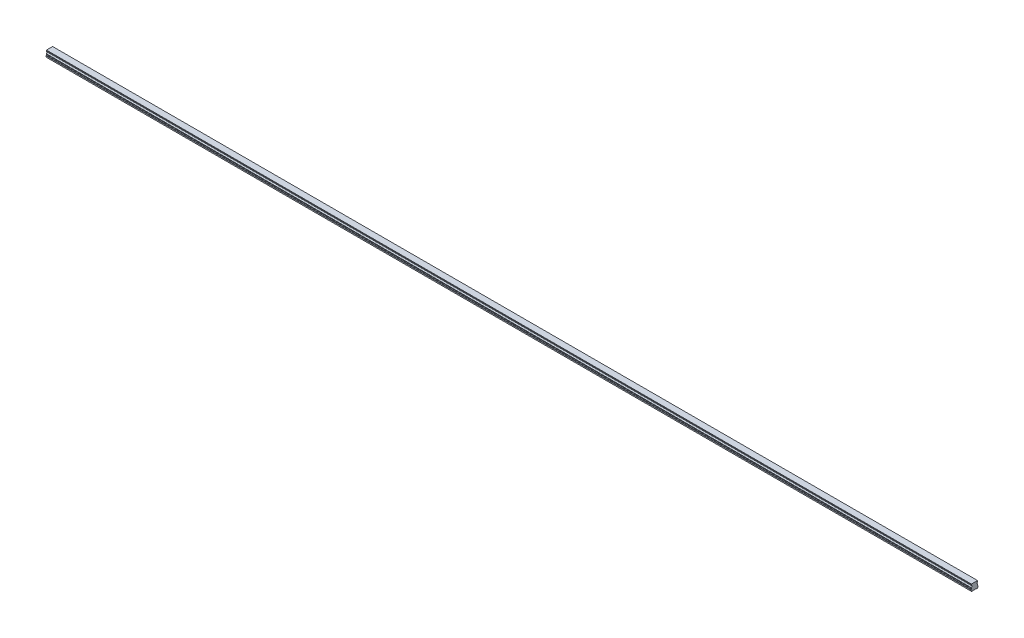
ISO-10303-21;
HEADER;
FILE_DESCRIPTION(('STEP AP214'),'2;1');
FILE_NAME('part.step','',(''),(''),'','','');
FILE_SCHEMA(('AUTOMOTIVE_DESIGN { 1 0 10303 214 1 1 1 1 }'));
ENDSEC;
DATA;
#1=APPLICATION_CONTEXT('core data for automotive mechanical design processes');
#2=APPLICATION_PROTOCOL_DEFINITION('international standard','automotive_design',2000,#1);
#3=PRODUCT_CONTEXT('',#1,'mechanical');
#4=PRODUCT('Part','Part','',(#3));
#5=PRODUCT_RELATED_PRODUCT_CATEGORY('part','',(#4));
#6=PRODUCT_DEFINITION_FORMATION('','',#4);
#7=PRODUCT_DEFINITION_CONTEXT('part definition',#1,'design');
#8=PRODUCT_DEFINITION('design','',#6,#7);
#9=PRODUCT_DEFINITION_SHAPE('','',#8);
#10=(LENGTH_UNIT() NAMED_UNIT(*) SI_UNIT(.MILLI.,.METRE.));
#11=(NAMED_UNIT(*) PLANE_ANGLE_UNIT() SI_UNIT($,.RADIAN.));
#12=(NAMED_UNIT(*) SI_UNIT($,.STERADIAN.) SOLID_ANGLE_UNIT());
#13=UNCERTAINTY_MEASURE_WITH_UNIT(LENGTH_MEASURE(1.E-05),#10,'distance_accuracy_value','');
#14=(GEOMETRIC_REPRESENTATION_CONTEXT(3) GLOBAL_UNCERTAINTY_ASSIGNED_CONTEXT((#13)) GLOBAL_UNIT_ASSIGNED_CONTEXT((#10,
#11,#12)) REPRESENTATION_CONTEXT('',''));
#15=CARTESIAN_POINT('',(0.,0.,0.));
#16=DIRECTION('',(0.,0.,1.));
#17=DIRECTION('',(1.,0.,0.));
#18=AXIS2_PLACEMENT_3D('',#15,#16,#17);
#19=CARTESIAN_POINT('',(1950.,0.399999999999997,0.));
#20=DIRECTION('',(0.,-1.,0.));
#21=DIRECTION('',(0.,0.,-1.));
#22=AXIS2_PLACEMENT_3D('',#19,#20,#21);
#23=CONICAL_SURFACE('',#22,2.8999999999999,0.785398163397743);
#24=CARTESIAN_POINT('',(1950.,0.799999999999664,0.));
#25=DIRECTION('',(0.,1.,0.));
#26=DIRECTION('',(0.,0.,1.));
#27=AXIS2_PLACEMENT_3D('',#24,#25,#26);
#28=CIRCLE('',#27,2.5);
#29=CARTESIAN_POINT('',(1950.,0.799999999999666,2.5));
#30=VERTEX_POINT('',#29);
#31=EDGE_CURVE('E11',#30,#30,#28,.F.);
#32=ORIENTED_EDGE('',*,*,#31,.F.);
#33=EDGE_LOOP('',(#32));
#34=FACE_BOUND('',#33,.T.);
#35=CARTESIAN_POINT('',(1950.,0.399999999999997,0.));
#36=DIRECTION('',(0.,1.,0.));
#37=DIRECTION('',(0.,0.,1.));
#38=AXIS2_PLACEMENT_3D('',#35,#36,#37);
#39=CIRCLE('',#38,2.89999999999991);
#40=CARTESIAN_POINT('',(1950.,0.399999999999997,2.89999999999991));
#41=VERTEX_POINT('',#40);
#42=EDGE_CURVE('E793',#41,#41,#39,.T.);
#43=ORIENTED_EDGE('',*,*,#42,.F.);
#44=EDGE_LOOP('',(#43));
#45=FACE_BOUND('',#44,.T.);
#46=ADVANCED_FACE('F39',(#34,#45),#23,.F.);
#47=CARTESIAN_POINT('',(1950.,7.,0.));
#48=DIRECTION('',(0.,-1.,0.));
#49=DIRECTION('',(0.,0.,-1.));
#50=AXIS2_PLACEMENT_3D('',#47,#48,#49);
#51=CYLINDRICAL_SURFACE('',#50,2.5);
#52=ORIENTED_EDGE('',*,*,#31,.T.);
#53=EDGE_LOOP('',(#52));
#54=FACE_BOUND('',#53,.T.);
#55=CARTESIAN_POINT('',(1950.,7.,0.));
#56=DIRECTION('',(0.,-1.,0.));
#57=DIRECTION('',(0.,0.,-1.));
#58=AXIS2_PLACEMENT_3D('',#55,#56,#57);
#59=CIRCLE('',#58,2.5);
#60=CARTESIAN_POINT('',(1950.,7.,-2.50000000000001));
#61=VERTEX_POINT('',#60);
#62=EDGE_CURVE('E49',#61,#61,#59,.T.);
#63=ORIENTED_EDGE('',*,*,#62,.F.);
#64=EDGE_LOOP('',(#63));
#65=FACE_BOUND('',#64,.T.);
#66=ADVANCED_FACE('F1161',(#54,#65),#51,.F.);
#67=CARTESIAN_POINT('',(1950.,7.,0.));
#68=DIRECTION('',(0.,-1.,0.));
#69=DIRECTION('',(0.,0.,-1.));
#70=AXIS2_PLACEMENT_3D('',#67,#68,#69);
#71=PLANE('',#70);
#72=CARTESIAN_POINT('',(1950.,7.,0.));
#73=DIRECTION('',(0.,-1.,0.));
#74=DIRECTION('',(0.,0.,-1.));
#75=AXIS2_PLACEMENT_3D('',#72,#73,#74);
#76=CIRCLE('',#75,2.1);
#77=CARTESIAN_POINT('',(1950.,7.,-2.1));
#78=VERTEX_POINT('',#77);
#79=EDGE_CURVE('E42',#78,#78,#76,.T.);
#80=ORIENTED_EDGE('',*,*,#79,.F.);
#81=EDGE_LOOP('',(#80));
#82=FACE_BOUND('',#81,.T.);
#83=ORIENTED_EDGE('',*,*,#62,.T.);
#84=EDGE_LOOP('',(#83));
#85=FACE_BOUND('',#84,.T.);
#86=ADVANCED_FACE('F1166',(#82,#85),#71,.T.);
#87=CARTESIAN_POINT('',(1890.,0.399999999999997,0.));
#88=DIRECTION('',(0.,-1.,0.));
#89=DIRECTION('',(0.,0.,-1.));
#90=AXIS2_PLACEMENT_3D('',#87,#88,#89);
#91=CONICAL_SURFACE('',#90,2.8999999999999,0.785398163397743);
#92=CARTESIAN_POINT('',(1890.,0.799999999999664,0.));
#93=DIRECTION('',(0.,1.,0.));
#94=DIRECTION('',(0.,0.,1.));
#95=AXIS2_PLACEMENT_3D('',#92,#93,#94);
#96=CIRCLE('',#95,2.5);
#97=CARTESIAN_POINT('',(1890.,0.799999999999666,2.5));
#98=VERTEX_POINT('',#97);
#99=EDGE_CURVE('E789',#98,#98,#96,.F.);
#100=ORIENTED_EDGE('',*,*,#99,.F.);
#101=EDGE_LOOP('',(#100));
#102=FACE_BOUND('',#101,.T.);
#103=CARTESIAN_POINT('',(1890.,0.399999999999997,0.));
#104=DIRECTION('',(0.,1.,0.));
#105=DIRECTION('',(0.,0.,1.));
#106=AXIS2_PLACEMENT_3D('',#103,#104,#105);
#107=CIRCLE('',#106,2.89999999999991);
#108=CARTESIAN_POINT('',(1890.,0.399999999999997,2.89999999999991));
#109=VERTEX_POINT('',#108);
#110=EDGE_CURVE('E781',#109,#109,#107,.T.);
#111=ORIENTED_EDGE('',*,*,#110,.F.);
#112=EDGE_LOOP('',(#111));
#113=FACE_BOUND('',#112,.T.);
#114=ADVANCED_FACE('F1601',(#102,#113),#91,.F.);
#115=CARTESIAN_POINT('',(1890.,7.,0.));
#116=DIRECTION('',(0.,-1.,0.));
#117=DIRECTION('',(0.,0.,-1.));
#118=AXIS2_PLACEMENT_3D('',#115,#116,#117);
#119=CYLINDRICAL_SURFACE('',#118,2.5);
#120=ORIENTED_EDGE('',*,*,#99,.T.);
#121=EDGE_LOOP('',(#120));
#122=FACE_BOUND('',#121,.T.);
#123=CARTESIAN_POINT('',(1890.,7.,0.));
#124=DIRECTION('',(0.,-1.,0.));
#125=DIRECTION('',(0.,0.,-1.));
#126=AXIS2_PLACEMENT_3D('',#123,#124,#125);
#127=CIRCLE('',#126,2.5);
#128=CARTESIAN_POINT('',(1890.,7.,-2.50000000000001));
#129=VERTEX_POINT('',#128);
#130=EDGE_CURVE('E785',#129,#129,#127,.T.);
#131=ORIENTED_EDGE('',*,*,#130,.F.);
#132=EDGE_LOOP('',(#131));
#133=FACE_BOUND('',#132,.T.);
#134=ADVANCED_FACE('F1597',(#122,#133),#119,.F.);
#135=CARTESIAN_POINT('',(1890.,7.,0.));
#136=DIRECTION('',(0.,-1.,0.));
#137=DIRECTION('',(0.,0.,-1.));
#138=AXIS2_PLACEMENT_3D('',#135,#136,#137);
#139=PLANE('',#138);
#140=CARTESIAN_POINT('',(1890.,7.,0.));
#141=DIRECTION('',(0.,-1.,0.));
#142=DIRECTION('',(0.,0.,-1.));
#143=AXIS2_PLACEMENT_3D('',#140,#141,#142);
#144=CIRCLE('',#143,2.1);
#145=CARTESIAN_POINT('',(1890.,7.,-2.1));
#146=VERTEX_POINT('',#145);
#147=EDGE_CURVE('E920',#146,#146,#144,.T.);
#148=ORIENTED_EDGE('',*,*,#147,.F.);
#149=EDGE_LOOP('',(#148));
#150=FACE_BOUND('',#149,.T.);
#151=ORIENTED_EDGE('',*,*,#130,.T.);
#152=EDGE_LOOP('',(#151));
#153=FACE_BOUND('',#152,.T.);
#154=ADVANCED_FACE('F1593',(#150,#153),#139,.T.);
#155=CARTESIAN_POINT('',(1830.,0.399999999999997,0.));
#156=DIRECTION('',(0.,-1.,0.));
#157=DIRECTION('',(0.,0.,-1.));
#158=AXIS2_PLACEMENT_3D('',#155,#156,#157);
#159=CONICAL_SURFACE('',#158,2.8999999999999,0.785398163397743);
#160=CARTESIAN_POINT('',(1830.,0.799999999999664,0.));
#161=DIRECTION('',(0.,1.,0.));
#162=DIRECTION('',(0.,0.,1.));
#163=AXIS2_PLACEMENT_3D('',#160,#161,#162);
#164=CIRCLE('',#163,2.5);
#165=CARTESIAN_POINT('',(1830.,0.799999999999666,2.5));
#166=VERTEX_POINT('',#165);
#167=EDGE_CURVE('E777',#166,#166,#164,.F.);
#168=ORIENTED_EDGE('',*,*,#167,.F.);
#169=EDGE_LOOP('',(#168));
#170=FACE_BOUND('',#169,.T.);
#171=CARTESIAN_POINT('',(1830.,0.399999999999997,0.));
#172=DIRECTION('',(0.,1.,0.));
#173=DIRECTION('',(0.,0.,1.));
#174=AXIS2_PLACEMENT_3D('',#171,#172,#173);
#175=CIRCLE('',#174,2.89999999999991);
#176=CARTESIAN_POINT('',(1830.,0.399999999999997,2.89999999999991));
#177=VERTEX_POINT('',#176);
#178=EDGE_CURVE('E769',#177,#177,#175,.T.);
#179=ORIENTED_EDGE('',*,*,#178,.F.);
#180=EDGE_LOOP('',(#179));
#181=FACE_BOUND('',#180,.T.);
#182=ADVANCED_FACE('F1589',(#170,#181),#159,.F.);
#183=CARTESIAN_POINT('',(1830.,7.,0.));
#184=DIRECTION('',(0.,-1.,0.));
#185=DIRECTION('',(0.,0.,-1.));
#186=AXIS2_PLACEMENT_3D('',#183,#184,#185);
#187=CYLINDRICAL_SURFACE('',#186,2.5);
#188=ORIENTED_EDGE('',*,*,#167,.T.);
#189=EDGE_LOOP('',(#188));
#190=FACE_BOUND('',#189,.T.);
#191=CARTESIAN_POINT('',(1830.,7.,0.));
#192=DIRECTION('',(0.,-1.,0.));
#193=DIRECTION('',(0.,0.,-1.));
#194=AXIS2_PLACEMENT_3D('',#191,#192,#193);
#195=CIRCLE('',#194,2.5);
#196=CARTESIAN_POINT('',(1830.,7.,-2.50000000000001));
#197=VERTEX_POINT('',#196);
#198=EDGE_CURVE('E773',#197,#197,#195,.T.);
#199=ORIENTED_EDGE('',*,*,#198,.F.);
#200=EDGE_LOOP('',(#199));
#201=FACE_BOUND('',#200,.T.);
#202=ADVANCED_FACE('F1585',(#190,#201),#187,.F.);
#203=CARTESIAN_POINT('',(1830.,7.,0.));
#204=DIRECTION('',(0.,-1.,0.));
#205=DIRECTION('',(0.,0.,-1.));
#206=AXIS2_PLACEMENT_3D('',#203,#204,#205);
#207=PLANE('',#206);
#208=CARTESIAN_POINT('',(1830.,7.,0.));
#209=DIRECTION('',(0.,-1.,0.));
#210=DIRECTION('',(0.,0.,-1.));
#211=AXIS2_PLACEMENT_3D('',#208,#209,#210);
#212=CIRCLE('',#211,2.1);
#213=CARTESIAN_POINT('',(1830.,7.,-2.1));
#214=VERTEX_POINT('',#213);
#215=EDGE_CURVE('E917',#214,#214,#212,.T.);
#216=ORIENTED_EDGE('',*,*,#215,.F.);
#217=EDGE_LOOP('',(#216));
#218=FACE_BOUND('',#217,.T.);
#219=ORIENTED_EDGE('',*,*,#198,.T.);
#220=EDGE_LOOP('',(#219));
#221=FACE_BOUND('',#220,.T.);
#222=ADVANCED_FACE('F1581',(#218,#221),#207,.T.);
#223=CARTESIAN_POINT('',(1770.,0.399999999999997,0.));
#224=DIRECTION('',(0.,-1.,0.));
#225=DIRECTION('',(0.,0.,-1.));
#226=AXIS2_PLACEMENT_3D('',#223,#224,#225);
#227=CONICAL_SURFACE('',#226,2.8999999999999,0.785398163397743);
#228=CARTESIAN_POINT('',(1770.,0.799999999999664,0.));
#229=DIRECTION('',(0.,1.,0.));
#230=DIRECTION('',(0.,0.,1.));
#231=AXIS2_PLACEMENT_3D('',#228,#229,#230);
#232=CIRCLE('',#231,2.5);
#233=CARTESIAN_POINT('',(1770.,0.799999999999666,2.5));
#234=VERTEX_POINT('',#233);
#235=EDGE_CURVE('E765',#234,#234,#232,.F.);
#236=ORIENTED_EDGE('',*,*,#235,.F.);
#237=EDGE_LOOP('',(#236));
#238=FACE_BOUND('',#237,.T.);
#239=CARTESIAN_POINT('',(1770.,0.399999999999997,0.));
#240=DIRECTION('',(0.,1.,0.));
#241=DIRECTION('',(0.,0.,1.));
#242=AXIS2_PLACEMENT_3D('',#239,#240,#241);
#243=CIRCLE('',#242,2.89999999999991);
#244=CARTESIAN_POINT('',(1770.,0.399999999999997,2.89999999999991));
#245=VERTEX_POINT('',#244);
#246=EDGE_CURVE('E757',#245,#245,#243,.T.);
#247=ORIENTED_EDGE('',*,*,#246,.F.);
#248=EDGE_LOOP('',(#247));
#249=FACE_BOUND('',#248,.T.);
#250=ADVANCED_FACE('F1577',(#238,#249),#227,.F.);
#251=CARTESIAN_POINT('',(1770.,7.,0.));
#252=DIRECTION('',(0.,-1.,0.));
#253=DIRECTION('',(0.,0.,-1.));
#254=AXIS2_PLACEMENT_3D('',#251,#252,#253);
#255=CYLINDRICAL_SURFACE('',#254,2.5);
#256=ORIENTED_EDGE('',*,*,#235,.T.);
#257=EDGE_LOOP('',(#256));
#258=FACE_BOUND('',#257,.T.);
#259=CARTESIAN_POINT('',(1770.,7.,0.));
#260=DIRECTION('',(0.,-1.,0.));
#261=DIRECTION('',(0.,0.,-1.));
#262=AXIS2_PLACEMENT_3D('',#259,#260,#261);
#263=CIRCLE('',#262,2.5);
#264=CARTESIAN_POINT('',(1770.,7.,-2.50000000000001));
#265=VERTEX_POINT('',#264);
#266=EDGE_CURVE('E761',#265,#265,#263,.T.);
#267=ORIENTED_EDGE('',*,*,#266,.F.);
#268=EDGE_LOOP('',(#267));
#269=FACE_BOUND('',#268,.T.);
#270=ADVANCED_FACE('F1573',(#258,#269),#255,.F.);
#271=CARTESIAN_POINT('',(1770.,7.,0.));
#272=DIRECTION('',(0.,-1.,0.));
#273=DIRECTION('',(0.,0.,-1.));
#274=AXIS2_PLACEMENT_3D('',#271,#272,#273);
#275=PLANE('',#274);
#276=CARTESIAN_POINT('',(1770.,7.,0.));
#277=DIRECTION('',(0.,-1.,0.));
#278=DIRECTION('',(0.,0.,-1.));
#279=AXIS2_PLACEMENT_3D('',#276,#277,#278);
#280=CIRCLE('',#279,2.1);
#281=CARTESIAN_POINT('',(1770.,7.,-2.1));
#282=VERTEX_POINT('',#281);
#283=EDGE_CURVE('E913',#282,#282,#280,.T.);
#284=ORIENTED_EDGE('',*,*,#283,.F.);
#285=EDGE_LOOP('',(#284));
#286=FACE_BOUND('',#285,.T.);
#287=ORIENTED_EDGE('',*,*,#266,.T.);
#288=EDGE_LOOP('',(#287));
#289=FACE_BOUND('',#288,.T.);
#290=ADVANCED_FACE('F1569',(#286,#289),#275,.T.);
#291=CARTESIAN_POINT('',(1710.,0.399999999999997,0.));
#292=DIRECTION('',(0.,-1.,0.));
#293=DIRECTION('',(0.,0.,-1.));
#294=AXIS2_PLACEMENT_3D('',#291,#292,#293);
#295=CONICAL_SURFACE('',#294,2.8999999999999,0.785398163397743);
#296=CARTESIAN_POINT('',(1710.,0.799999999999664,0.));
#297=DIRECTION('',(0.,1.,0.));
#298=DIRECTION('',(0.,0.,1.));
#299=AXIS2_PLACEMENT_3D('',#296,#297,#298);
#300=CIRCLE('',#299,2.5);
#301=CARTESIAN_POINT('',(1710.,0.799999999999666,2.5));
#302=VERTEX_POINT('',#301);
#303=EDGE_CURVE('E753',#302,#302,#300,.F.);
#304=ORIENTED_EDGE('',*,*,#303,.F.);
#305=EDGE_LOOP('',(#304));
#306=FACE_BOUND('',#305,.T.);
#307=CARTESIAN_POINT('',(1710.,0.399999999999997,0.));
#308=DIRECTION('',(0.,1.,0.));
#309=DIRECTION('',(0.,0.,1.));
#310=AXIS2_PLACEMENT_3D('',#307,#308,#309);
#311=CIRCLE('',#310,2.89999999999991);
#312=CARTESIAN_POINT('',(1710.,0.399999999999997,2.89999999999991));
#313=VERTEX_POINT('',#312);
#314=EDGE_CURVE('E745',#313,#313,#311,.T.);
#315=ORIENTED_EDGE('',*,*,#314,.F.);
#316=EDGE_LOOP('',(#315));
#317=FACE_BOUND('',#316,.T.);
#318=ADVANCED_FACE('F1565',(#306,#317),#295,.F.);
#319=CARTESIAN_POINT('',(1710.,7.,0.));
#320=DIRECTION('',(0.,-1.,0.));
#321=DIRECTION('',(0.,0.,-1.));
#322=AXIS2_PLACEMENT_3D('',#319,#320,#321);
#323=CYLINDRICAL_SURFACE('',#322,2.5);
#324=ORIENTED_EDGE('',*,*,#303,.T.);
#325=EDGE_LOOP('',(#324));
#326=FACE_BOUND('',#325,.T.);
#327=CARTESIAN_POINT('',(1710.,7.,0.));
#328=DIRECTION('',(0.,-1.,0.));
#329=DIRECTION('',(0.,0.,-1.));
#330=AXIS2_PLACEMENT_3D('',#327,#328,#329);
#331=CIRCLE('',#330,2.5);
#332=CARTESIAN_POINT('',(1710.,7.,-2.50000000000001));
#333=VERTEX_POINT('',#332);
#334=EDGE_CURVE('E749',#333,#333,#331,.T.);
#335=ORIENTED_EDGE('',*,*,#334,.F.);
#336=EDGE_LOOP('',(#335));
#337=FACE_BOUND('',#336,.T.);
#338=ADVANCED_FACE('F1561',(#326,#337),#323,.F.);
#339=CARTESIAN_POINT('',(1710.,7.,0.));
#340=DIRECTION('',(0.,-1.,0.));
#341=DIRECTION('',(0.,0.,-1.));
#342=AXIS2_PLACEMENT_3D('',#339,#340,#341);
#343=PLANE('',#342);
#344=CARTESIAN_POINT('',(1710.,7.,0.));
#345=DIRECTION('',(0.,-1.,0.));
#346=DIRECTION('',(0.,0.,-1.));
#347=AXIS2_PLACEMENT_3D('',#344,#345,#346);
#348=CIRCLE('',#347,2.1);
#349=CARTESIAN_POINT('',(1710.,7.,-2.1));
#350=VERTEX_POINT('',#349);
#351=EDGE_CURVE('E909',#350,#350,#348,.T.);
#352=ORIENTED_EDGE('',*,*,#351,.F.);
#353=EDGE_LOOP('',(#352));
#354=FACE_BOUND('',#353,.T.);
#355=ORIENTED_EDGE('',*,*,#334,.T.);
#356=EDGE_LOOP('',(#355));
#357=FACE_BOUND('',#356,.T.);
#358=ADVANCED_FACE('F1557',(#354,#357),#343,.T.);
#359=CARTESIAN_POINT('',(1650.,0.399999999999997,0.));
#360=DIRECTION('',(0.,-1.,0.));
#361=DIRECTION('',(0.,0.,-1.));
#362=AXIS2_PLACEMENT_3D('',#359,#360,#361);
#363=CONICAL_SURFACE('',#362,2.8999999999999,0.785398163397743);
#364=CARTESIAN_POINT('',(1650.,0.799999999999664,0.));
#365=DIRECTION('',(0.,1.,0.));
#366=DIRECTION('',(0.,0.,1.));
#367=AXIS2_PLACEMENT_3D('',#364,#365,#366);
#368=CIRCLE('',#367,2.5);
#369=CARTESIAN_POINT('',(1650.,0.799999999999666,2.5));
#370=VERTEX_POINT('',#369);
#371=EDGE_CURVE('E741',#370,#370,#368,.F.);
#372=ORIENTED_EDGE('',*,*,#371,.F.);
#373=EDGE_LOOP('',(#372));
#374=FACE_BOUND('',#373,.T.);
#375=CARTESIAN_POINT('',(1650.,0.399999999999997,0.));
#376=DIRECTION('',(0.,1.,0.));
#377=DIRECTION('',(0.,0.,1.));
#378=AXIS2_PLACEMENT_3D('',#375,#376,#377);
#379=CIRCLE('',#378,2.89999999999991);
#380=CARTESIAN_POINT('',(1650.,0.399999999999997,2.89999999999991));
#381=VERTEX_POINT('',#380);
#382=EDGE_CURVE('E733',#381,#381,#379,.T.);
#383=ORIENTED_EDGE('',*,*,#382,.F.);
#384=EDGE_LOOP('',(#383));
#385=FACE_BOUND('',#384,.T.);
#386=ADVANCED_FACE('F1553',(#374,#385),#363,.F.);
#387=CARTESIAN_POINT('',(1650.,7.,0.));
#388=DIRECTION('',(0.,-1.,0.));
#389=DIRECTION('',(0.,0.,-1.));
#390=AXIS2_PLACEMENT_3D('',#387,#388,#389);
#391=CYLINDRICAL_SURFACE('',#390,2.5);
#392=ORIENTED_EDGE('',*,*,#371,.T.);
#393=EDGE_LOOP('',(#392));
#394=FACE_BOUND('',#393,.T.);
#395=CARTESIAN_POINT('',(1650.,7.,0.));
#396=DIRECTION('',(0.,-1.,0.));
#397=DIRECTION('',(0.,0.,-1.));
#398=AXIS2_PLACEMENT_3D('',#395,#396,#397);
#399=CIRCLE('',#398,2.5);
#400=CARTESIAN_POINT('',(1650.,7.,-2.50000000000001));
#401=VERTEX_POINT('',#400);
#402=EDGE_CURVE('E737',#401,#401,#399,.T.);
#403=ORIENTED_EDGE('',*,*,#402,.F.);
#404=EDGE_LOOP('',(#403));
#405=FACE_BOUND('',#404,.T.);
#406=ADVANCED_FACE('F1549',(#394,#405),#391,.F.);
#407=CARTESIAN_POINT('',(1650.,7.,0.));
#408=DIRECTION('',(0.,-1.,0.));
#409=DIRECTION('',(0.,0.,-1.));
#410=AXIS2_PLACEMENT_3D('',#407,#408,#409);
#411=PLANE('',#410);
#412=CARTESIAN_POINT('',(1650.,7.,0.));
#413=DIRECTION('',(0.,-1.,0.));
#414=DIRECTION('',(0.,0.,-1.));
#415=AXIS2_PLACEMENT_3D('',#412,#413,#414);
#416=CIRCLE('',#415,2.1);
#417=CARTESIAN_POINT('',(1650.,7.,-2.1));
#418=VERTEX_POINT('',#417);
#419=EDGE_CURVE('E905',#418,#418,#416,.T.);
#420=ORIENTED_EDGE('',*,*,#419,.F.);
#421=EDGE_LOOP('',(#420));
#422=FACE_BOUND('',#421,.T.);
#423=ORIENTED_EDGE('',*,*,#402,.T.);
#424=EDGE_LOOP('',(#423));
#425=FACE_BOUND('',#424,.T.);
#426=ADVANCED_FACE('F1545',(#422,#425),#411,.T.);
#427=CARTESIAN_POINT('',(1590.,0.399999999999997,0.));
#428=DIRECTION('',(0.,-1.,0.));
#429=DIRECTION('',(0.,0.,-1.));
#430=AXIS2_PLACEMENT_3D('',#427,#428,#429);
#431=CONICAL_SURFACE('',#430,2.8999999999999,0.785398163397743);
#432=CARTESIAN_POINT('',(1590.,0.799999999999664,0.));
#433=DIRECTION('',(0.,1.,0.));
#434=DIRECTION('',(0.,0.,1.));
#435=AXIS2_PLACEMENT_3D('',#432,#433,#434);
#436=CIRCLE('',#435,2.5);
#437=CARTESIAN_POINT('',(1590.,0.799999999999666,2.5));
#438=VERTEX_POINT('',#437);
#439=EDGE_CURVE('E729',#438,#438,#436,.F.);
#440=ORIENTED_EDGE('',*,*,#439,.F.);
#441=EDGE_LOOP('',(#440));
#442=FACE_BOUND('',#441,.T.);
#443=CARTESIAN_POINT('',(1590.,0.399999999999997,0.));
#444=DIRECTION('',(0.,1.,0.));
#445=DIRECTION('',(0.,0.,1.));
#446=AXIS2_PLACEMENT_3D('',#443,#444,#445);
#447=CIRCLE('',#446,2.89999999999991);
#448=CARTESIAN_POINT('',(1590.,0.399999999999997,2.89999999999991));
#449=VERTEX_POINT('',#448);
#450=EDGE_CURVE('E721',#449,#449,#447,.T.);
#451=ORIENTED_EDGE('',*,*,#450,.F.);
#452=EDGE_LOOP('',(#451));
#453=FACE_BOUND('',#452,.T.);
#454=ADVANCED_FACE('F1541',(#442,#453),#431,.F.);
#455=CARTESIAN_POINT('',(1590.,7.,0.));
#456=DIRECTION('',(0.,-1.,0.));
#457=DIRECTION('',(0.,0.,-1.));
#458=AXIS2_PLACEMENT_3D('',#455,#456,#457);
#459=CYLINDRICAL_SURFACE('',#458,2.5);
#460=ORIENTED_EDGE('',*,*,#439,.T.);
#461=EDGE_LOOP('',(#460));
#462=FACE_BOUND('',#461,.T.);
#463=CARTESIAN_POINT('',(1590.,7.,0.));
#464=DIRECTION('',(0.,-1.,0.));
#465=DIRECTION('',(0.,0.,-1.));
#466=AXIS2_PLACEMENT_3D('',#463,#464,#465);
#467=CIRCLE('',#466,2.5);
#468=CARTESIAN_POINT('',(1590.,7.,-2.50000000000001));
#469=VERTEX_POINT('',#468);
#470=EDGE_CURVE('E725',#469,#469,#467,.T.);
#471=ORIENTED_EDGE('',*,*,#470,.F.);
#472=EDGE_LOOP('',(#471));
#473=FACE_BOUND('',#472,.T.);
#474=ADVANCED_FACE('F1537',(#462,#473),#459,.F.);
#475=CARTESIAN_POINT('',(1590.,7.,0.));
#476=DIRECTION('',(0.,-1.,0.));
#477=DIRECTION('',(0.,0.,-1.));
#478=AXIS2_PLACEMENT_3D('',#475,#476,#477);
#479=PLANE('',#478);
#480=CARTESIAN_POINT('',(1590.,7.,0.));
#481=DIRECTION('',(0.,-1.,0.));
#482=DIRECTION('',(0.,0.,-1.));
#483=AXIS2_PLACEMENT_3D('',#480,#481,#482);
#484=CIRCLE('',#483,2.1);
#485=CARTESIAN_POINT('',(1590.,7.,-2.1));
#486=VERTEX_POINT('',#485);
#487=EDGE_CURVE('E901',#486,#486,#484,.T.);
#488=ORIENTED_EDGE('',*,*,#487,.F.);
#489=EDGE_LOOP('',(#488));
#490=FACE_BOUND('',#489,.T.);
#491=ORIENTED_EDGE('',*,*,#470,.T.);
#492=EDGE_LOOP('',(#491));
#493=FACE_BOUND('',#492,.T.);
#494=ADVANCED_FACE('F1533',(#490,#493),#479,.T.);
#495=CARTESIAN_POINT('',(1530.,0.399999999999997,0.));
#496=DIRECTION('',(0.,-1.,0.));
#497=DIRECTION('',(0.,0.,-1.));
#498=AXIS2_PLACEMENT_3D('',#495,#496,#497);
#499=CONICAL_SURFACE('',#498,2.8999999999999,0.785398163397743);
#500=CARTESIAN_POINT('',(1530.,0.799999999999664,0.));
#501=DIRECTION('',(0.,1.,0.));
#502=DIRECTION('',(0.,0.,1.));
#503=AXIS2_PLACEMENT_3D('',#500,#501,#502);
#504=CIRCLE('',#503,2.5);
#505=CARTESIAN_POINT('',(1530.,0.799999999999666,2.5));
#506=VERTEX_POINT('',#505);
#507=EDGE_CURVE('E717',#506,#506,#504,.F.);
#508=ORIENTED_EDGE('',*,*,#507,.F.);
#509=EDGE_LOOP('',(#508));
#510=FACE_BOUND('',#509,.T.);
#511=CARTESIAN_POINT('',(1530.,0.399999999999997,0.));
#512=DIRECTION('',(0.,1.,0.));
#513=DIRECTION('',(0.,0.,1.));
#514=AXIS2_PLACEMENT_3D('',#511,#512,#513);
#515=CIRCLE('',#514,2.89999999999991);
#516=CARTESIAN_POINT('',(1530.,0.399999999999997,2.89999999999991));
#517=VERTEX_POINT('',#516);
#518=EDGE_CURVE('E709',#517,#517,#515,.T.);
#519=ORIENTED_EDGE('',*,*,#518,.F.);
#520=EDGE_LOOP('',(#519));
#521=FACE_BOUND('',#520,.T.);
#522=ADVANCED_FACE('F1529',(#510,#521),#499,.F.);
#523=CARTESIAN_POINT('',(1530.,7.,0.));
#524=DIRECTION('',(0.,-1.,0.));
#525=DIRECTION('',(0.,0.,-1.));
#526=AXIS2_PLACEMENT_3D('',#523,#524,#525);
#527=CYLINDRICAL_SURFACE('',#526,2.5);
#528=ORIENTED_EDGE('',*,*,#507,.T.);
#529=EDGE_LOOP('',(#528));
#530=FACE_BOUND('',#529,.T.);
#531=CARTESIAN_POINT('',(1530.,7.,0.));
#532=DIRECTION('',(0.,-1.,0.));
#533=DIRECTION('',(0.,0.,-1.));
#534=AXIS2_PLACEMENT_3D('',#531,#532,#533);
#535=CIRCLE('',#534,2.5);
#536=CARTESIAN_POINT('',(1530.,7.,-2.50000000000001));
#537=VERTEX_POINT('',#536);
#538=EDGE_CURVE('E713',#537,#537,#535,.T.);
#539=ORIENTED_EDGE('',*,*,#538,.F.);
#540=EDGE_LOOP('',(#539));
#541=FACE_BOUND('',#540,.T.);
#542=ADVANCED_FACE('F1525',(#530,#541),#527,.F.);
#543=CARTESIAN_POINT('',(1530.,7.,0.));
#544=DIRECTION('',(0.,-1.,0.));
#545=DIRECTION('',(0.,0.,-1.));
#546=AXIS2_PLACEMENT_3D('',#543,#544,#545);
#547=PLANE('',#546);
#548=CARTESIAN_POINT('',(1530.,7.,0.));
#549=DIRECTION('',(0.,-1.,0.));
#550=DIRECTION('',(0.,0.,-1.));
#551=AXIS2_PLACEMENT_3D('',#548,#549,#550);
#552=CIRCLE('',#551,2.1);
#553=CARTESIAN_POINT('',(1530.,7.,-2.1));
#554=VERTEX_POINT('',#553);
#555=EDGE_CURVE('E897',#554,#554,#552,.T.);
#556=ORIENTED_EDGE('',*,*,#555,.F.);
#557=EDGE_LOOP('',(#556));
#558=FACE_BOUND('',#557,.T.);
#559=ORIENTED_EDGE('',*,*,#538,.T.);
#560=EDGE_LOOP('',(#559));
#561=FACE_BOUND('',#560,.T.);
#562=ADVANCED_FACE('F1521',(#558,#561),#547,.T.);
#563=CARTESIAN_POINT('',(1470.,0.399999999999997,0.));
#564=DIRECTION('',(0.,-1.,0.));
#565=DIRECTION('',(0.,0.,-1.));
#566=AXIS2_PLACEMENT_3D('',#563,#564,#565);
#567=CONICAL_SURFACE('',#566,2.8999999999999,0.785398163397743);
#568=CARTESIAN_POINT('',(1470.,0.799999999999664,0.));
#569=DIRECTION('',(0.,1.,0.));
#570=DIRECTION('',(0.,0.,1.));
#571=AXIS2_PLACEMENT_3D('',#568,#569,#570);
#572=CIRCLE('',#571,2.5);
#573=CARTESIAN_POINT('',(1470.,0.799999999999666,2.5));
#574=VERTEX_POINT('',#573);
#575=EDGE_CURVE('E705',#574,#574,#572,.F.);
#576=ORIENTED_EDGE('',*,*,#575,.F.);
#577=EDGE_LOOP('',(#576));
#578=FACE_BOUND('',#577,.T.);
#579=CARTESIAN_POINT('',(1470.,0.399999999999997,0.));
#580=DIRECTION('',(0.,1.,0.));
#581=DIRECTION('',(0.,0.,1.));
#582=AXIS2_PLACEMENT_3D('',#579,#580,#581);
#583=CIRCLE('',#582,2.89999999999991);
#584=CARTESIAN_POINT('',(1470.,0.399999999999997,2.89999999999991));
#585=VERTEX_POINT('',#584);
#586=EDGE_CURVE('E697',#585,#585,#583,.T.);
#587=ORIENTED_EDGE('',*,*,#586,.F.);
#588=EDGE_LOOP('',(#587));
#589=FACE_BOUND('',#588,.T.);
#590=ADVANCED_FACE('F1517',(#578,#589),#567,.F.);
#591=CARTESIAN_POINT('',(1470.,7.,0.));
#592=DIRECTION('',(0.,-1.,0.));
#593=DIRECTION('',(0.,0.,-1.));
#594=AXIS2_PLACEMENT_3D('',#591,#592,#593);
#595=CYLINDRICAL_SURFACE('',#594,2.5);
#596=ORIENTED_EDGE('',*,*,#575,.T.);
#597=EDGE_LOOP('',(#596));
#598=FACE_BOUND('',#597,.T.);
#599=CARTESIAN_POINT('',(1470.,7.,0.));
#600=DIRECTION('',(0.,-1.,0.));
#601=DIRECTION('',(0.,0.,-1.));
#602=AXIS2_PLACEMENT_3D('',#599,#600,#601);
#603=CIRCLE('',#602,2.5);
#604=CARTESIAN_POINT('',(1470.,7.,-2.50000000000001));
#605=VERTEX_POINT('',#604);
#606=EDGE_CURVE('E701',#605,#605,#603,.T.);
#607=ORIENTED_EDGE('',*,*,#606,.F.);
#608=EDGE_LOOP('',(#607));
#609=FACE_BOUND('',#608,.T.);
#610=ADVANCED_FACE('F1513',(#598,#609),#595,.F.);
#611=CARTESIAN_POINT('',(1470.,7.,0.));
#612=DIRECTION('',(0.,-1.,0.));
#613=DIRECTION('',(0.,0.,-1.));
#614=AXIS2_PLACEMENT_3D('',#611,#612,#613);
#615=PLANE('',#614);
#616=CARTESIAN_POINT('',(1470.,7.,0.));
#617=DIRECTION('',(0.,-1.,0.));
#618=DIRECTION('',(0.,0.,-1.));
#619=AXIS2_PLACEMENT_3D('',#616,#617,#618);
#620=CIRCLE('',#619,2.1);
#621=CARTESIAN_POINT('',(1470.,7.,-2.1));
#622=VERTEX_POINT('',#621);
#623=EDGE_CURVE('E893',#622,#622,#620,.T.);
#624=ORIENTED_EDGE('',*,*,#623,.F.);
#625=EDGE_LOOP('',(#624));
#626=FACE_BOUND('',#625,.T.);
#627=ORIENTED_EDGE('',*,*,#606,.T.);
#628=EDGE_LOOP('',(#627));
#629=FACE_BOUND('',#628,.T.);
#630=ADVANCED_FACE('F1509',(#626,#629),#615,.T.);
#631=CARTESIAN_POINT('',(1410.,0.399999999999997,0.));
#632=DIRECTION('',(0.,-1.,0.));
#633=DIRECTION('',(0.,0.,-1.));
#634=AXIS2_PLACEMENT_3D('',#631,#632,#633);
#635=CONICAL_SURFACE('',#634,2.8999999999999,0.785398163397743);
#636=CARTESIAN_POINT('',(1410.,0.799999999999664,0.));
#637=DIRECTION('',(0.,1.,0.));
#638=DIRECTION('',(0.,0.,1.));
#639=AXIS2_PLACEMENT_3D('',#636,#637,#638);
#640=CIRCLE('',#639,2.5);
#641=CARTESIAN_POINT('',(1410.,0.799999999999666,2.5));
#642=VERTEX_POINT('',#641);
#643=EDGE_CURVE('E693',#642,#642,#640,.F.);
#644=ORIENTED_EDGE('',*,*,#643,.F.);
#645=EDGE_LOOP('',(#644));
#646=FACE_BOUND('',#645,.T.);
#647=CARTESIAN_POINT('',(1410.,0.399999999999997,0.));
#648=DIRECTION('',(0.,1.,0.));
#649=DIRECTION('',(0.,0.,1.));
#650=AXIS2_PLACEMENT_3D('',#647,#648,#649);
#651=CIRCLE('',#650,2.89999999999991);
#652=CARTESIAN_POINT('',(1410.,0.399999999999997,2.89999999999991));
#653=VERTEX_POINT('',#652);
#654=EDGE_CURVE('E685',#653,#653,#651,.T.);
#655=ORIENTED_EDGE('',*,*,#654,.F.);
#656=EDGE_LOOP('',(#655));
#657=FACE_BOUND('',#656,.T.);
#658=ADVANCED_FACE('F1505',(#646,#657),#635,.F.);
#659=CARTESIAN_POINT('',(1410.,7.,0.));
#660=DIRECTION('',(0.,-1.,0.));
#661=DIRECTION('',(0.,0.,-1.));
#662=AXIS2_PLACEMENT_3D('',#659,#660,#661);
#663=CYLINDRICAL_SURFACE('',#662,2.5);
#664=ORIENTED_EDGE('',*,*,#643,.T.);
#665=EDGE_LOOP('',(#664));
#666=FACE_BOUND('',#665,.T.);
#667=CARTESIAN_POINT('',(1410.,7.,0.));
#668=DIRECTION('',(0.,-1.,0.));
#669=DIRECTION('',(0.,0.,-1.));
#670=AXIS2_PLACEMENT_3D('',#667,#668,#669);
#671=CIRCLE('',#670,2.5);
#672=CARTESIAN_POINT('',(1410.,7.,-2.50000000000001));
#673=VERTEX_POINT('',#672);
#674=EDGE_CURVE('E689',#673,#673,#671,.T.);
#675=ORIENTED_EDGE('',*,*,#674,.F.);
#676=EDGE_LOOP('',(#675));
#677=FACE_BOUND('',#676,.T.);
#678=ADVANCED_FACE('F1501',(#666,#677),#663,.F.);
#679=CARTESIAN_POINT('',(1410.,7.,0.));
#680=DIRECTION('',(0.,-1.,0.));
#681=DIRECTION('',(0.,0.,-1.));
#682=AXIS2_PLACEMENT_3D('',#679,#680,#681);
#683=PLANE('',#682);
#684=CARTESIAN_POINT('',(1410.,7.,0.));
#685=DIRECTION('',(0.,-1.,0.));
#686=DIRECTION('',(0.,0.,-1.));
#687=AXIS2_PLACEMENT_3D('',#684,#685,#686);
#688=CIRCLE('',#687,2.1);
#689=CARTESIAN_POINT('',(1410.,7.,-2.1));
#690=VERTEX_POINT('',#689);
#691=EDGE_CURVE('E889',#690,#690,#688,.T.);
#692=ORIENTED_EDGE('',*,*,#691,.F.);
#693=EDGE_LOOP('',(#692));
#694=FACE_BOUND('',#693,.T.);
#695=ORIENTED_EDGE('',*,*,#674,.T.);
#696=EDGE_LOOP('',(#695));
#697=FACE_BOUND('',#696,.T.);
#698=ADVANCED_FACE('F1497',(#694,#697),#683,.T.);
#699=CARTESIAN_POINT('',(1350.,0.399999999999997,0.));
#700=DIRECTION('',(0.,-1.,0.));
#701=DIRECTION('',(0.,0.,-1.));
#702=AXIS2_PLACEMENT_3D('',#699,#700,#701);
#703=CONICAL_SURFACE('',#702,2.8999999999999,0.785398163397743);
#704=CARTESIAN_POINT('',(1350.,0.799999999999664,0.));
#705=DIRECTION('',(0.,1.,0.));
#706=DIRECTION('',(0.,0.,1.));
#707=AXIS2_PLACEMENT_3D('',#704,#705,#706);
#708=CIRCLE('',#707,2.5);
#709=CARTESIAN_POINT('',(1350.,0.799999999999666,2.5));
#710=VERTEX_POINT('',#709);
#711=EDGE_CURVE('E681',#710,#710,#708,.F.);
#712=ORIENTED_EDGE('',*,*,#711,.F.);
#713=EDGE_LOOP('',(#712));
#714=FACE_BOUND('',#713,.T.);
#715=CARTESIAN_POINT('',(1350.,0.399999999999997,0.));
#716=DIRECTION('',(0.,1.,0.));
#717=DIRECTION('',(0.,0.,1.));
#718=AXIS2_PLACEMENT_3D('',#715,#716,#717);
#719=CIRCLE('',#718,2.89999999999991);
#720=CARTESIAN_POINT('',(1350.,0.399999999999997,2.89999999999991));
#721=VERTEX_POINT('',#720);
#722=EDGE_CURVE('E673',#721,#721,#719,.T.);
#723=ORIENTED_EDGE('',*,*,#722,.F.);
#724=EDGE_LOOP('',(#723));
#725=FACE_BOUND('',#724,.T.);
#726=ADVANCED_FACE('F1493',(#714,#725),#703,.F.);
#727=CARTESIAN_POINT('',(1350.,7.,0.));
#728=DIRECTION('',(0.,-1.,0.));
#729=DIRECTION('',(0.,0.,-1.));
#730=AXIS2_PLACEMENT_3D('',#727,#728,#729);
#731=CYLINDRICAL_SURFACE('',#730,2.5);
#732=ORIENTED_EDGE('',*,*,#711,.T.);
#733=EDGE_LOOP('',(#732));
#734=FACE_BOUND('',#733,.T.);
#735=CARTESIAN_POINT('',(1350.,7.,0.));
#736=DIRECTION('',(0.,-1.,0.));
#737=DIRECTION('',(0.,0.,-1.));
#738=AXIS2_PLACEMENT_3D('',#735,#736,#737);
#739=CIRCLE('',#738,2.5);
#740=CARTESIAN_POINT('',(1350.,7.,-2.50000000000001));
#741=VERTEX_POINT('',#740);
#742=EDGE_CURVE('E677',#741,#741,#739,.T.);
#743=ORIENTED_EDGE('',*,*,#742,.F.);
#744=EDGE_LOOP('',(#743));
#745=FACE_BOUND('',#744,.T.);
#746=ADVANCED_FACE('F1489',(#734,#745),#731,.F.);
#747=CARTESIAN_POINT('',(1350.,7.,0.));
#748=DIRECTION('',(0.,-1.,0.));
#749=DIRECTION('',(0.,0.,-1.));
#750=AXIS2_PLACEMENT_3D('',#747,#748,#749);
#751=PLANE('',#750);
#752=CARTESIAN_POINT('',(1350.,7.,0.));
#753=DIRECTION('',(0.,-1.,0.));
#754=DIRECTION('',(0.,0.,-1.));
#755=AXIS2_PLACEMENT_3D('',#752,#753,#754);
#756=CIRCLE('',#755,2.1);
#757=CARTESIAN_POINT('',(1350.,7.,-2.1));
#758=VERTEX_POINT('',#757);
#759=EDGE_CURVE('E885',#758,#758,#756,.T.);
#760=ORIENTED_EDGE('',*,*,#759,.F.);
#761=EDGE_LOOP('',(#760));
#762=FACE_BOUND('',#761,.T.);
#763=ORIENTED_EDGE('',*,*,#742,.T.);
#764=EDGE_LOOP('',(#763));
#765=FACE_BOUND('',#764,.T.);
#766=ADVANCED_FACE('F1485',(#762,#765),#751,.T.);
#767=CARTESIAN_POINT('',(1290.,0.399999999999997,0.));
#768=DIRECTION('',(0.,-1.,0.));
#769=DIRECTION('',(0.,0.,-1.));
#770=AXIS2_PLACEMENT_3D('',#767,#768,#769);
#771=CONICAL_SURFACE('',#770,2.8999999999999,0.785398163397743);
#772=CARTESIAN_POINT('',(1290.,0.799999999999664,0.));
#773=DIRECTION('',(0.,1.,0.));
#774=DIRECTION('',(0.,0.,1.));
#775=AXIS2_PLACEMENT_3D('',#772,#773,#774);
#776=CIRCLE('',#775,2.5);
#777=CARTESIAN_POINT('',(1290.,0.799999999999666,2.5));
#778=VERTEX_POINT('',#777);
#779=EDGE_CURVE('E669',#778,#778,#776,.F.);
#780=ORIENTED_EDGE('',*,*,#779,.F.);
#781=EDGE_LOOP('',(#780));
#782=FACE_BOUND('',#781,.T.);
#783=CARTESIAN_POINT('',(1290.,0.399999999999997,0.));
#784=DIRECTION('',(0.,1.,0.));
#785=DIRECTION('',(0.,0.,1.));
#786=AXIS2_PLACEMENT_3D('',#783,#784,#785);
#787=CIRCLE('',#786,2.89999999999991);
#788=CARTESIAN_POINT('',(1290.,0.399999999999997,2.89999999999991));
#789=VERTEX_POINT('',#788);
#790=EDGE_CURVE('E661',#789,#789,#787,.T.);
#791=ORIENTED_EDGE('',*,*,#790,.F.);
#792=EDGE_LOOP('',(#791));
#793=FACE_BOUND('',#792,.T.);
#794=ADVANCED_FACE('F1481',(#782,#793),#771,.F.);
#795=CARTESIAN_POINT('',(1290.,7.,0.));
#796=DIRECTION('',(0.,-1.,0.));
#797=DIRECTION('',(0.,0.,-1.));
#798=AXIS2_PLACEMENT_3D('',#795,#796,#797);
#799=CYLINDRICAL_SURFACE('',#798,2.5);
#800=ORIENTED_EDGE('',*,*,#779,.T.);
#801=EDGE_LOOP('',(#800));
#802=FACE_BOUND('',#801,.T.);
#803=CARTESIAN_POINT('',(1290.,7.,0.));
#804=DIRECTION('',(0.,-1.,0.));
#805=DIRECTION('',(0.,0.,-1.));
#806=AXIS2_PLACEMENT_3D('',#803,#804,#805);
#807=CIRCLE('',#806,2.5);
#808=CARTESIAN_POINT('',(1290.,7.,-2.50000000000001));
#809=VERTEX_POINT('',#808);
#810=EDGE_CURVE('E665',#809,#809,#807,.T.);
#811=ORIENTED_EDGE('',*,*,#810,.F.);
#812=EDGE_LOOP('',(#811));
#813=FACE_BOUND('',#812,.T.);
#814=ADVANCED_FACE('F1477',(#802,#813),#799,.F.);
#815=CARTESIAN_POINT('',(1290.,7.,0.));
#816=DIRECTION('',(0.,-1.,0.));
#817=DIRECTION('',(0.,0.,-1.));
#818=AXIS2_PLACEMENT_3D('',#815,#816,#817);
#819=PLANE('',#818);
#820=CARTESIAN_POINT('',(1290.,7.,0.));
#821=DIRECTION('',(0.,-1.,0.));
#822=DIRECTION('',(0.,0.,-1.));
#823=AXIS2_PLACEMENT_3D('',#820,#821,#822);
#824=CIRCLE('',#823,2.1);
#825=CARTESIAN_POINT('',(1290.,7.,-2.1));
#826=VERTEX_POINT('',#825);
#827=EDGE_CURVE('E881',#826,#826,#824,.T.);
#828=ORIENTED_EDGE('',*,*,#827,.F.);
#829=EDGE_LOOP('',(#828));
#830=FACE_BOUND('',#829,.T.);
#831=ORIENTED_EDGE('',*,*,#810,.T.);
#832=EDGE_LOOP('',(#831));
#833=FACE_BOUND('',#832,.T.);
#834=ADVANCED_FACE('F1473',(#830,#833),#819,.T.);
#835=CARTESIAN_POINT('',(1230.,0.399999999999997,0.));
#836=DIRECTION('',(0.,-1.,0.));
#837=DIRECTION('',(0.,0.,-1.));
#838=AXIS2_PLACEMENT_3D('',#835,#836,#837);
#839=CONICAL_SURFACE('',#838,2.8999999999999,0.785398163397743);
#840=CARTESIAN_POINT('',(1230.,0.799999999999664,0.));
#841=DIRECTION('',(0.,1.,0.));
#842=DIRECTION('',(0.,0.,1.));
#843=AXIS2_PLACEMENT_3D('',#840,#841,#842);
#844=CIRCLE('',#843,2.5);
#845=CARTESIAN_POINT('',(1230.,0.799999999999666,2.5));
#846=VERTEX_POINT('',#845);
#847=EDGE_CURVE('E657',#846,#846,#844,.F.);
#848=ORIENTED_EDGE('',*,*,#847,.F.);
#849=EDGE_LOOP('',(#848));
#850=FACE_BOUND('',#849,.T.);
#851=CARTESIAN_POINT('',(1230.,0.399999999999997,0.));
#852=DIRECTION('',(0.,1.,0.));
#853=DIRECTION('',(0.,0.,1.));
#854=AXIS2_PLACEMENT_3D('',#851,#852,#853);
#855=CIRCLE('',#854,2.89999999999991);
#856=CARTESIAN_POINT('',(1230.,0.399999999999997,2.89999999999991));
#857=VERTEX_POINT('',#856);
#858=EDGE_CURVE('E649',#857,#857,#855,.T.);
#859=ORIENTED_EDGE('',*,*,#858,.F.);
#860=EDGE_LOOP('',(#859));
#861=FACE_BOUND('',#860,.T.);
#862=ADVANCED_FACE('F1469',(#850,#861),#839,.F.);
#863=CARTESIAN_POINT('',(1230.,7.,0.));
#864=DIRECTION('',(0.,-1.,0.));
#865=DIRECTION('',(0.,0.,-1.));
#866=AXIS2_PLACEMENT_3D('',#863,#864,#865);
#867=CYLINDRICAL_SURFACE('',#866,2.5);
#868=ORIENTED_EDGE('',*,*,#847,.T.);
#869=EDGE_LOOP('',(#868));
#870=FACE_BOUND('',#869,.T.);
#871=CARTESIAN_POINT('',(1230.,7.,0.));
#872=DIRECTION('',(0.,-1.,0.));
#873=DIRECTION('',(0.,0.,-1.));
#874=AXIS2_PLACEMENT_3D('',#871,#872,#873);
#875=CIRCLE('',#874,2.5);
#876=CARTESIAN_POINT('',(1230.,7.,-2.50000000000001));
#877=VERTEX_POINT('',#876);
#878=EDGE_CURVE('E653',#877,#877,#875,.T.);
#879=ORIENTED_EDGE('',*,*,#878,.F.);
#880=EDGE_LOOP('',(#879));
#881=FACE_BOUND('',#880,.T.);
#882=ADVANCED_FACE('F1465',(#870,#881),#867,.F.);
#883=CARTESIAN_POINT('',(1230.,7.,0.));
#884=DIRECTION('',(0.,-1.,0.));
#885=DIRECTION('',(0.,0.,-1.));
#886=AXIS2_PLACEMENT_3D('',#883,#884,#885);
#887=PLANE('',#886);
#888=CARTESIAN_POINT('',(1230.,7.,0.));
#889=DIRECTION('',(0.,-1.,0.));
#890=DIRECTION('',(0.,0.,-1.));
#891=AXIS2_PLACEMENT_3D('',#888,#889,#890);
#892=CIRCLE('',#891,2.1);
#893=CARTESIAN_POINT('',(1230.,7.,-2.1));
#894=VERTEX_POINT('',#893);
#895=EDGE_CURVE('E877',#894,#894,#892,.T.);
#896=ORIENTED_EDGE('',*,*,#895,.F.);
#897=EDGE_LOOP('',(#896));
#898=FACE_BOUND('',#897,.T.);
#899=ORIENTED_EDGE('',*,*,#878,.T.);
#900=EDGE_LOOP('',(#899));
#901=FACE_BOUND('',#900,.T.);
#902=ADVANCED_FACE('F1461',(#898,#901),#887,.T.);
#903=CARTESIAN_POINT('',(1170.,0.399999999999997,0.));
#904=DIRECTION('',(0.,-1.,0.));
#905=DIRECTION('',(0.,0.,-1.));
#906=AXIS2_PLACEMENT_3D('',#903,#904,#905);
#907=CONICAL_SURFACE('',#906,2.8999999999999,0.785398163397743);
#908=CARTESIAN_POINT('',(1170.,0.799999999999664,0.));
#909=DIRECTION('',(0.,1.,0.));
#910=DIRECTION('',(0.,0.,1.));
#911=AXIS2_PLACEMENT_3D('',#908,#909,#910);
#912=CIRCLE('',#911,2.5);
#913=CARTESIAN_POINT('',(1170.,0.799999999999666,2.5));
#914=VERTEX_POINT('',#913);
#915=EDGE_CURVE('E645',#914,#914,#912,.F.);
#916=ORIENTED_EDGE('',*,*,#915,.F.);
#917=EDGE_LOOP('',(#916));
#918=FACE_BOUND('',#917,.T.);
#919=CARTESIAN_POINT('',(1170.,0.399999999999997,0.));
#920=DIRECTION('',(0.,1.,0.));
#921=DIRECTION('',(0.,0.,1.));
#922=AXIS2_PLACEMENT_3D('',#919,#920,#921);
#923=CIRCLE('',#922,2.89999999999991);
#924=CARTESIAN_POINT('',(1170.,0.399999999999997,2.89999999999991));
#925=VERTEX_POINT('',#924);
#926=EDGE_CURVE('E637',#925,#925,#923,.T.);
#927=ORIENTED_EDGE('',*,*,#926,.F.);
#928=EDGE_LOOP('',(#927));
#929=FACE_BOUND('',#928,.T.);
#930=ADVANCED_FACE('F1457',(#918,#929),#907,.F.);
#931=CARTESIAN_POINT('',(1170.,7.,0.));
#932=DIRECTION('',(0.,-1.,0.));
#933=DIRECTION('',(0.,0.,-1.));
#934=AXIS2_PLACEMENT_3D('',#931,#932,#933);
#935=CYLINDRICAL_SURFACE('',#934,2.5);
#936=ORIENTED_EDGE('',*,*,#915,.T.);
#937=EDGE_LOOP('',(#936));
#938=FACE_BOUND('',#937,.T.);
#939=CARTESIAN_POINT('',(1170.,7.,0.));
#940=DIRECTION('',(0.,-1.,0.));
#941=DIRECTION('',(0.,0.,-1.));
#942=AXIS2_PLACEMENT_3D('',#939,#940,#941);
#943=CIRCLE('',#942,2.5);
#944=CARTESIAN_POINT('',(1170.,7.,-2.50000000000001));
#945=VERTEX_POINT('',#944);
#946=EDGE_CURVE('E641',#945,#945,#943,.T.);
#947=ORIENTED_EDGE('',*,*,#946,.F.);
#948=EDGE_LOOP('',(#947));
#949=FACE_BOUND('',#948,.T.);
#950=ADVANCED_FACE('F1453',(#938,#949),#935,.F.);
#951=CARTESIAN_POINT('',(1170.,7.,0.));
#952=DIRECTION('',(0.,-1.,0.));
#953=DIRECTION('',(0.,0.,-1.));
#954=AXIS2_PLACEMENT_3D('',#951,#952,#953);
#955=PLANE('',#954);
#956=CARTESIAN_POINT('',(1170.,7.,0.));
#957=DIRECTION('',(0.,-1.,0.));
#958=DIRECTION('',(0.,0.,-1.));
#959=AXIS2_PLACEMENT_3D('',#956,#957,#958);
#960=CIRCLE('',#959,2.1);
#961=CARTESIAN_POINT('',(1170.,7.,-2.1));
#962=VERTEX_POINT('',#961);
#963=EDGE_CURVE('E873',#962,#962,#960,.T.);
#964=ORIENTED_EDGE('',*,*,#963,.F.);
#965=EDGE_LOOP('',(#964));
#966=FACE_BOUND('',#965,.T.);
#967=ORIENTED_EDGE('',*,*,#946,.T.);
#968=EDGE_LOOP('',(#967));
#969=FACE_BOUND('',#968,.T.);
#970=ADVANCED_FACE('F1449',(#966,#969),#955,.T.);
#971=CARTESIAN_POINT('',(1110.,0.399999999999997,0.));
#972=DIRECTION('',(0.,-1.,0.));
#973=DIRECTION('',(0.,0.,-1.));
#974=AXIS2_PLACEMENT_3D('',#971,#972,#973);
#975=CONICAL_SURFACE('',#974,2.8999999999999,0.785398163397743);
#976=CARTESIAN_POINT('',(1110.,0.799999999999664,0.));
#977=DIRECTION('',(0.,1.,0.));
#978=DIRECTION('',(0.,0.,1.));
#979=AXIS2_PLACEMENT_3D('',#976,#977,#978);
#980=CIRCLE('',#979,2.5);
#981=CARTESIAN_POINT('',(1110.,0.799999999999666,2.5));
#982=VERTEX_POINT('',#981);
#983=EDGE_CURVE('E633',#982,#982,#980,.F.);
#984=ORIENTED_EDGE('',*,*,#983,.F.);
#985=EDGE_LOOP('',(#984));
#986=FACE_BOUND('',#985,.T.);
#987=CARTESIAN_POINT('',(1110.,0.399999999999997,0.));
#988=DIRECTION('',(0.,1.,0.));
#989=DIRECTION('',(0.,0.,1.));
#990=AXIS2_PLACEMENT_3D('',#987,#988,#989);
#991=CIRCLE('',#990,2.89999999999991);
#992=CARTESIAN_POINT('',(1110.,0.399999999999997,2.89999999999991));
#993=VERTEX_POINT('',#992);
#994=EDGE_CURVE('E625',#993,#993,#991,.T.);
#995=ORIENTED_EDGE('',*,*,#994,.F.);
#996=EDGE_LOOP('',(#995));
#997=FACE_BOUND('',#996,.T.);
#998=ADVANCED_FACE('F1445',(#986,#997),#975,.F.);
#999=CARTESIAN_POINT('',(1110.,7.,0.));
#1000=DIRECTION('',(0.,-1.,0.));
#1001=DIRECTION('',(0.,0.,-1.));
#1002=AXIS2_PLACEMENT_3D('',#999,#1000,#1001);
#1003=CYLINDRICAL_SURFACE('',#1002,2.5);
#1004=ORIENTED_EDGE('',*,*,#983,.T.);
#1005=EDGE_LOOP('',(#1004));
#1006=FACE_BOUND('',#1005,.T.);
#1007=CARTESIAN_POINT('',(1110.,7.,0.));
#1008=DIRECTION('',(0.,-1.,0.));
#1009=DIRECTION('',(0.,0.,-1.));
#1010=AXIS2_PLACEMENT_3D('',#1007,#1008,#1009);
#1011=CIRCLE('',#1010,2.5);
#1012=CARTESIAN_POINT('',(1110.,7.,-2.50000000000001));
#1013=VERTEX_POINT('',#1012);
#1014=EDGE_CURVE('E629',#1013,#1013,#1011,.T.);
#1015=ORIENTED_EDGE('',*,*,#1014,.F.);
#1016=EDGE_LOOP('',(#1015));
#1017=FACE_BOUND('',#1016,.T.);
#1018=ADVANCED_FACE('F1441',(#1006,#1017),#1003,.F.);
#1019=CARTESIAN_POINT('',(1110.,7.,0.));
#1020=DIRECTION('',(0.,-1.,0.));
#1021=DIRECTION('',(0.,0.,-1.));
#1022=AXIS2_PLACEMENT_3D('',#1019,#1020,#1021);
#1023=PLANE('',#1022);
#1024=CARTESIAN_POINT('',(1110.,7.,0.));
#1025=DIRECTION('',(0.,-1.,0.));
#1026=DIRECTION('',(0.,0.,-1.));
#1027=AXIS2_PLACEMENT_3D('',#1024,#1025,#1026);
#1028=CIRCLE('',#1027,2.1);
#1029=CARTESIAN_POINT('',(1110.,7.,-2.1));
#1030=VERTEX_POINT('',#1029);
#1031=EDGE_CURVE('E869',#1030,#1030,#1028,.T.);
#1032=ORIENTED_EDGE('',*,*,#1031,.F.);
#1033=EDGE_LOOP('',(#1032));
#1034=FACE_BOUND('',#1033,.T.);
#1035=ORIENTED_EDGE('',*,*,#1014,.T.);
#1036=EDGE_LOOP('',(#1035));
#1037=FACE_BOUND('',#1036,.T.);
#1038=ADVANCED_FACE('F1437',(#1034,#1037),#1023,.T.);
#1039=CARTESIAN_POINT('',(1050.,0.399999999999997,0.));
#1040=DIRECTION('',(0.,-1.,0.));
#1041=DIRECTION('',(0.,0.,-1.));
#1042=AXIS2_PLACEMENT_3D('',#1039,#1040,#1041);
#1043=CONICAL_SURFACE('',#1042,2.8999999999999,0.785398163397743);
#1044=CARTESIAN_POINT('',(1050.,0.799999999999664,0.));
#1045=DIRECTION('',(0.,1.,0.));
#1046=DIRECTION('',(0.,0.,1.));
#1047=AXIS2_PLACEMENT_3D('',#1044,#1045,#1046);
#1048=CIRCLE('',#1047,2.5);
#1049=CARTESIAN_POINT('',(1050.,0.799999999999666,2.5));
#1050=VERTEX_POINT('',#1049);
#1051=EDGE_CURVE('E621',#1050,#1050,#1048,.F.);
#1052=ORIENTED_EDGE('',*,*,#1051,.F.);
#1053=EDGE_LOOP('',(#1052));
#1054=FACE_BOUND('',#1053,.T.);
#1055=CARTESIAN_POINT('',(1050.,0.399999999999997,0.));
#1056=DIRECTION('',(0.,1.,0.));
#1057=DIRECTION('',(0.,0.,1.));
#1058=AXIS2_PLACEMENT_3D('',#1055,#1056,#1057);
#1059=CIRCLE('',#1058,2.89999999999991);
#1060=CARTESIAN_POINT('',(1050.,0.399999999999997,2.89999999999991));
#1061=VERTEX_POINT('',#1060);
#1062=EDGE_CURVE('E613',#1061,#1061,#1059,.T.);
#1063=ORIENTED_EDGE('',*,*,#1062,.F.);
#1064=EDGE_LOOP('',(#1063));
#1065=FACE_BOUND('',#1064,.T.);
#1066=ADVANCED_FACE('F1433',(#1054,#1065),#1043,.F.);
#1067=CARTESIAN_POINT('',(1050.,7.,0.));
#1068=DIRECTION('',(0.,-1.,0.));
#1069=DIRECTION('',(0.,0.,-1.));
#1070=AXIS2_PLACEMENT_3D('',#1067,#1068,#1069);
#1071=CYLINDRICAL_SURFACE('',#1070,2.5);
#1072=ORIENTED_EDGE('',*,*,#1051,.T.);
#1073=EDGE_LOOP('',(#1072));
#1074=FACE_BOUND('',#1073,.T.);
#1075=CARTESIAN_POINT('',(1050.,7.,0.));
#1076=DIRECTION('',(0.,-1.,0.));
#1077=DIRECTION('',(0.,0.,-1.));
#1078=AXIS2_PLACEMENT_3D('',#1075,#1076,#1077);
#1079=CIRCLE('',#1078,2.5);
#1080=CARTESIAN_POINT('',(1050.,7.,-2.50000000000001));
#1081=VERTEX_POINT('',#1080);
#1082=EDGE_CURVE('E617',#1081,#1081,#1079,.T.);
#1083=ORIENTED_EDGE('',*,*,#1082,.F.);
#1084=EDGE_LOOP('',(#1083));
#1085=FACE_BOUND('',#1084,.T.);
#1086=ADVANCED_FACE('F1429',(#1074,#1085),#1071,.F.);
#1087=CARTESIAN_POINT('',(1050.,7.,0.));
#1088=DIRECTION('',(0.,-1.,0.));
#1089=DIRECTION('',(0.,0.,-1.));
#1090=AXIS2_PLACEMENT_3D('',#1087,#1088,#1089);
#1091=PLANE('',#1090);
#1092=CARTESIAN_POINT('',(1050.,7.,0.));
#1093=DIRECTION('',(0.,-1.,0.));
#1094=DIRECTION('',(0.,0.,-1.));
#1095=AXIS2_PLACEMENT_3D('',#1092,#1093,#1094);
#1096=CIRCLE('',#1095,2.1);
#1097=CARTESIAN_POINT('',(1050.,7.,-2.1));
#1098=VERTEX_POINT('',#1097);
#1099=EDGE_CURVE('E865',#1098,#1098,#1096,.T.);
#1100=ORIENTED_EDGE('',*,*,#1099,.F.);
#1101=EDGE_LOOP('',(#1100));
#1102=FACE_BOUND('',#1101,.T.);
#1103=ORIENTED_EDGE('',*,*,#1082,.T.);
#1104=EDGE_LOOP('',(#1103));
#1105=FACE_BOUND('',#1104,.T.);
#1106=ADVANCED_FACE('F1425',(#1102,#1105),#1091,.T.);
#1107=CARTESIAN_POINT('',(990.,0.399999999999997,0.));
#1108=DIRECTION('',(0.,-1.,0.));
#1109=DIRECTION('',(0.,0.,-1.));
#1110=AXIS2_PLACEMENT_3D('',#1107,#1108,#1109);
#1111=CONICAL_SURFACE('',#1110,2.8999999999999,0.785398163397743);
#1112=CARTESIAN_POINT('',(990.,0.799999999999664,0.));
#1113=DIRECTION('',(0.,1.,0.));
#1114=DIRECTION('',(0.,0.,1.));
#1115=AXIS2_PLACEMENT_3D('',#1112,#1113,#1114);
#1116=CIRCLE('',#1115,2.5);
#1117=CARTESIAN_POINT('',(990.,0.799999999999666,2.5));
#1118=VERTEX_POINT('',#1117);
#1119=EDGE_CURVE('E609',#1118,#1118,#1116,.F.);
#1120=ORIENTED_EDGE('',*,*,#1119,.F.);
#1121=EDGE_LOOP('',(#1120));
#1122=FACE_BOUND('',#1121,.T.);
#1123=CARTESIAN_POINT('',(990.,0.399999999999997,0.));
#1124=DIRECTION('',(0.,1.,0.));
#1125=DIRECTION('',(0.,0.,1.));
#1126=AXIS2_PLACEMENT_3D('',#1123,#1124,#1125);
#1127=CIRCLE('',#1126,2.89999999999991);
#1128=CARTESIAN_POINT('',(990.,0.399999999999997,2.89999999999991));
#1129=VERTEX_POINT('',#1128);
#1130=EDGE_CURVE('E601',#1129,#1129,#1127,.T.);
#1131=ORIENTED_EDGE('',*,*,#1130,.F.);
#1132=EDGE_LOOP('',(#1131));
#1133=FACE_BOUND('',#1132,.T.);
#1134=ADVANCED_FACE('F1421',(#1122,#1133),#1111,.F.);
#1135=CARTESIAN_POINT('',(990.,7.,0.));
#1136=DIRECTION('',(0.,-1.,0.));
#1137=DIRECTION('',(0.,0.,-1.));
#1138=AXIS2_PLACEMENT_3D('',#1135,#1136,#1137);
#1139=CYLINDRICAL_SURFACE('',#1138,2.5);
#1140=ORIENTED_EDGE('',*,*,#1119,.T.);
#1141=EDGE_LOOP('',(#1140));
#1142=FACE_BOUND('',#1141,.T.);
#1143=CARTESIAN_POINT('',(990.,7.,0.));
#1144=DIRECTION('',(0.,-1.,0.));
#1145=DIRECTION('',(0.,0.,-1.));
#1146=AXIS2_PLACEMENT_3D('',#1143,#1144,#1145);
#1147=CIRCLE('',#1146,2.5);
#1148=CARTESIAN_POINT('',(990.,7.,-2.50000000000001));
#1149=VERTEX_POINT('',#1148);
#1150=EDGE_CURVE('E605',#1149,#1149,#1147,.T.);
#1151=ORIENTED_EDGE('',*,*,#1150,.F.);
#1152=EDGE_LOOP('',(#1151));
#1153=FACE_BOUND('',#1152,.T.);
#1154=ADVANCED_FACE('F1417',(#1142,#1153),#1139,.F.);
#1155=CARTESIAN_POINT('',(990.,7.,0.));
#1156=DIRECTION('',(0.,-1.,0.));
#1157=DIRECTION('',(0.,0.,-1.));
#1158=AXIS2_PLACEMENT_3D('',#1155,#1156,#1157);
#1159=PLANE('',#1158);
#1160=CARTESIAN_POINT('',(990.,7.,0.));
#1161=DIRECTION('',(0.,-1.,0.));
#1162=DIRECTION('',(0.,0.,-1.));
#1163=AXIS2_PLACEMENT_3D('',#1160,#1161,#1162);
#1164=CIRCLE('',#1163,2.1);
#1165=CARTESIAN_POINT('',(990.,7.,-2.1));
#1166=VERTEX_POINT('',#1165);
#1167=EDGE_CURVE('E861',#1166,#1166,#1164,.T.);
#1168=ORIENTED_EDGE('',*,*,#1167,.F.);
#1169=EDGE_LOOP('',(#1168));
#1170=FACE_BOUND('',#1169,.T.);
#1171=ORIENTED_EDGE('',*,*,#1150,.T.);
#1172=EDGE_LOOP('',(#1171));
#1173=FACE_BOUND('',#1172,.T.);
#1174=ADVANCED_FACE('F1413',(#1170,#1173),#1159,.T.);
#1175=CARTESIAN_POINT('',(930.,0.399999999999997,0.));
#1176=DIRECTION('',(0.,-1.,0.));
#1177=DIRECTION('',(0.,0.,-1.));
#1178=AXIS2_PLACEMENT_3D('',#1175,#1176,#1177);
#1179=CONICAL_SURFACE('',#1178,2.8999999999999,0.785398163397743);
#1180=CARTESIAN_POINT('',(930.,0.799999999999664,0.));
#1181=DIRECTION('',(0.,1.,0.));
#1182=DIRECTION('',(0.,0.,1.));
#1183=AXIS2_PLACEMENT_3D('',#1180,#1181,#1182);
#1184=CIRCLE('',#1183,2.5);
#1185=CARTESIAN_POINT('',(930.,0.799999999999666,2.5));
#1186=VERTEX_POINT('',#1185);
#1187=EDGE_CURVE('E597',#1186,#1186,#1184,.F.);
#1188=ORIENTED_EDGE('',*,*,#1187,.F.);
#1189=EDGE_LOOP('',(#1188));
#1190=FACE_BOUND('',#1189,.T.);
#1191=CARTESIAN_POINT('',(930.,0.399999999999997,0.));
#1192=DIRECTION('',(0.,1.,0.));
#1193=DIRECTION('',(0.,0.,1.));
#1194=AXIS2_PLACEMENT_3D('',#1191,#1192,#1193);
#1195=CIRCLE('',#1194,2.89999999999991);
#1196=CARTESIAN_POINT('',(930.,0.399999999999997,2.89999999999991));
#1197=VERTEX_POINT('',#1196);
#1198=EDGE_CURVE('E589',#1197,#1197,#1195,.T.);
#1199=ORIENTED_EDGE('',*,*,#1198,.F.);
#1200=EDGE_LOOP('',(#1199));
#1201=FACE_BOUND('',#1200,.T.);
#1202=ADVANCED_FACE('F1409',(#1190,#1201),#1179,.F.);
#1203=CARTESIAN_POINT('',(930.,7.,0.));
#1204=DIRECTION('',(0.,-1.,0.));
#1205=DIRECTION('',(0.,0.,-1.));
#1206=AXIS2_PLACEMENT_3D('',#1203,#1204,#1205);
#1207=CYLINDRICAL_SURFACE('',#1206,2.5);
#1208=ORIENTED_EDGE('',*,*,#1187,.T.);
#1209=EDGE_LOOP('',(#1208));
#1210=FACE_BOUND('',#1209,.T.);
#1211=CARTESIAN_POINT('',(930.,7.,0.));
#1212=DIRECTION('',(0.,-1.,0.));
#1213=DIRECTION('',(0.,0.,-1.));
#1214=AXIS2_PLACEMENT_3D('',#1211,#1212,#1213);
#1215=CIRCLE('',#1214,2.5);
#1216=CARTESIAN_POINT('',(930.,7.,-2.50000000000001));
#1217=VERTEX_POINT('',#1216);
#1218=EDGE_CURVE('E593',#1217,#1217,#1215,.T.);
#1219=ORIENTED_EDGE('',*,*,#1218,.F.);
#1220=EDGE_LOOP('',(#1219));
#1221=FACE_BOUND('',#1220,.T.);
#1222=ADVANCED_FACE('F1405',(#1210,#1221),#1207,.F.);
#1223=CARTESIAN_POINT('',(930.,7.,0.));
#1224=DIRECTION('',(0.,-1.,0.));
#1225=DIRECTION('',(0.,0.,-1.));
#1226=AXIS2_PLACEMENT_3D('',#1223,#1224,#1225);
#1227=PLANE('',#1226);
#1228=CARTESIAN_POINT('',(930.,7.,0.));
#1229=DIRECTION('',(0.,-1.,0.));
#1230=DIRECTION('',(0.,0.,-1.));
#1231=AXIS2_PLACEMENT_3D('',#1228,#1229,#1230);
#1232=CIRCLE('',#1231,2.1);
#1233=CARTESIAN_POINT('',(930.,7.,-2.1));
#1234=VERTEX_POINT('',#1233);
#1235=EDGE_CURVE('E857',#1234,#1234,#1232,.T.);
#1236=ORIENTED_EDGE('',*,*,#1235,.F.);
#1237=EDGE_LOOP('',(#1236));
#1238=FACE_BOUND('',#1237,.T.);
#1239=ORIENTED_EDGE('',*,*,#1218,.T.);
#1240=EDGE_LOOP('',(#1239));
#1241=FACE_BOUND('',#1240,.T.);
#1242=ADVANCED_FACE('F1401',(#1238,#1241),#1227,.T.);
#1243=CARTESIAN_POINT('',(870.,0.399999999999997,0.));
#1244=DIRECTION('',(0.,-1.,0.));
#1245=DIRECTION('',(0.,0.,-1.));
#1246=AXIS2_PLACEMENT_3D('',#1243,#1244,#1245);
#1247=CONICAL_SURFACE('',#1246,2.8999999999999,0.785398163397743);
#1248=CARTESIAN_POINT('',(870.,0.799999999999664,0.));
#1249=DIRECTION('',(0.,1.,0.));
#1250=DIRECTION('',(0.,0.,1.));
#1251=AXIS2_PLACEMENT_3D('',#1248,#1249,#1250);
#1252=CIRCLE('',#1251,2.5);
#1253=CARTESIAN_POINT('',(870.,0.799999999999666,2.5));
#1254=VERTEX_POINT('',#1253);
#1255=EDGE_CURVE('E585',#1254,#1254,#1252,.F.);
#1256=ORIENTED_EDGE('',*,*,#1255,.F.);
#1257=EDGE_LOOP('',(#1256));
#1258=FACE_BOUND('',#1257,.T.);
#1259=CARTESIAN_POINT('',(870.,0.399999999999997,0.));
#1260=DIRECTION('',(0.,1.,0.));
#1261=DIRECTION('',(0.,0.,1.));
#1262=AXIS2_PLACEMENT_3D('',#1259,#1260,#1261);
#1263=CIRCLE('',#1262,2.89999999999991);
#1264=CARTESIAN_POINT('',(870.,0.399999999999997,2.89999999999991));
#1265=VERTEX_POINT('',#1264);
#1266=EDGE_CURVE('E577',#1265,#1265,#1263,.T.);
#1267=ORIENTED_EDGE('',*,*,#1266,.F.);
#1268=EDGE_LOOP('',(#1267));
#1269=FACE_BOUND('',#1268,.T.);
#1270=ADVANCED_FACE('F1397',(#1258,#1269),#1247,.F.);
#1271=CARTESIAN_POINT('',(870.,7.,0.));
#1272=DIRECTION('',(0.,-1.,0.));
#1273=DIRECTION('',(0.,0.,-1.));
#1274=AXIS2_PLACEMENT_3D('',#1271,#1272,#1273);
#1275=CYLINDRICAL_SURFACE('',#1274,2.5);
#1276=ORIENTED_EDGE('',*,*,#1255,.T.);
#1277=EDGE_LOOP('',(#1276));
#1278=FACE_BOUND('',#1277,.T.);
#1279=CARTESIAN_POINT('',(870.,7.,0.));
#1280=DIRECTION('',(0.,-1.,0.));
#1281=DIRECTION('',(0.,0.,-1.));
#1282=AXIS2_PLACEMENT_3D('',#1279,#1280,#1281);
#1283=CIRCLE('',#1282,2.5);
#1284=CARTESIAN_POINT('',(870.,7.,-2.50000000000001));
#1285=VERTEX_POINT('',#1284);
#1286=EDGE_CURVE('E581',#1285,#1285,#1283,.T.);
#1287=ORIENTED_EDGE('',*,*,#1286,.F.);
#1288=EDGE_LOOP('',(#1287));
#1289=FACE_BOUND('',#1288,.T.);
#1290=ADVANCED_FACE('F1393',(#1278,#1289),#1275,.F.);
#1291=CARTESIAN_POINT('',(870.,7.,0.));
#1292=DIRECTION('',(0.,-1.,0.));
#1293=DIRECTION('',(0.,0.,-1.));
#1294=AXIS2_PLACEMENT_3D('',#1291,#1292,#1293);
#1295=PLANE('',#1294);
#1296=CARTESIAN_POINT('',(870.,7.,0.));
#1297=DIRECTION('',(0.,-1.,0.));
#1298=DIRECTION('',(0.,0.,-1.));
#1299=AXIS2_PLACEMENT_3D('',#1296,#1297,#1298);
#1300=CIRCLE('',#1299,2.1);
#1301=CARTESIAN_POINT('',(870.,7.,-2.1));
#1302=VERTEX_POINT('',#1301);
#1303=EDGE_CURVE('E853',#1302,#1302,#1300,.T.);
#1304=ORIENTED_EDGE('',*,*,#1303,.F.);
#1305=EDGE_LOOP('',(#1304));
#1306=FACE_BOUND('',#1305,.T.);
#1307=ORIENTED_EDGE('',*,*,#1286,.T.);
#1308=EDGE_LOOP('',(#1307));
#1309=FACE_BOUND('',#1308,.T.);
#1310=ADVANCED_FACE('F1389',(#1306,#1309),#1295,.T.);
#1311=CARTESIAN_POINT('',(810.,0.399999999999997,0.));
#1312=DIRECTION('',(0.,-1.,0.));
#1313=DIRECTION('',(0.,0.,-1.));
#1314=AXIS2_PLACEMENT_3D('',#1311,#1312,#1313);
#1315=CONICAL_SURFACE('',#1314,2.8999999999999,0.785398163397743);
#1316=CARTESIAN_POINT('',(810.,0.799999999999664,0.));
#1317=DIRECTION('',(0.,1.,0.));
#1318=DIRECTION('',(0.,0.,1.));
#1319=AXIS2_PLACEMENT_3D('',#1316,#1317,#1318);
#1320=CIRCLE('',#1319,2.5);
#1321=CARTESIAN_POINT('',(810.,0.799999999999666,2.5));
#1322=VERTEX_POINT('',#1321);
#1323=EDGE_CURVE('E573',#1322,#1322,#1320,.F.);
#1324=ORIENTED_EDGE('',*,*,#1323,.F.);
#1325=EDGE_LOOP('',(#1324));
#1326=FACE_BOUND('',#1325,.T.);
#1327=CARTESIAN_POINT('',(810.,0.399999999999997,0.));
#1328=DIRECTION('',(0.,1.,0.));
#1329=DIRECTION('',(0.,0.,1.));
#1330=AXIS2_PLACEMENT_3D('',#1327,#1328,#1329);
#1331=CIRCLE('',#1330,2.89999999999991);
#1332=CARTESIAN_POINT('',(810.,0.399999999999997,2.89999999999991));
#1333=VERTEX_POINT('',#1332);
#1334=EDGE_CURVE('E565',#1333,#1333,#1331,.T.);
#1335=ORIENTED_EDGE('',*,*,#1334,.F.);
#1336=EDGE_LOOP('',(#1335));
#1337=FACE_BOUND('',#1336,.T.);
#1338=ADVANCED_FACE('F1385',(#1326,#1337),#1315,.F.);
#1339=CARTESIAN_POINT('',(810.,7.,0.));
#1340=DIRECTION('',(0.,-1.,0.));
#1341=DIRECTION('',(0.,0.,-1.));
#1342=AXIS2_PLACEMENT_3D('',#1339,#1340,#1341);
#1343=CYLINDRICAL_SURFACE('',#1342,2.5);
#1344=ORIENTED_EDGE('',*,*,#1323,.T.);
#1345=EDGE_LOOP('',(#1344));
#1346=FACE_BOUND('',#1345,.T.);
#1347=CARTESIAN_POINT('',(810.,7.,0.));
#1348=DIRECTION('',(0.,-1.,0.));
#1349=DIRECTION('',(0.,0.,-1.));
#1350=AXIS2_PLACEMENT_3D('',#1347,#1348,#1349);
#1351=CIRCLE('',#1350,2.5);
#1352=CARTESIAN_POINT('',(810.,7.,-2.50000000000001));
#1353=VERTEX_POINT('',#1352);
#1354=EDGE_CURVE('E569',#1353,#1353,#1351,.T.);
#1355=ORIENTED_EDGE('',*,*,#1354,.F.);
#1356=EDGE_LOOP('',(#1355));
#1357=FACE_BOUND('',#1356,.T.);
#1358=ADVANCED_FACE('F1381',(#1346,#1357),#1343,.F.);
#1359=CARTESIAN_POINT('',(810.,7.,0.));
#1360=DIRECTION('',(0.,-1.,0.));
#1361=DIRECTION('',(0.,0.,-1.));
#1362=AXIS2_PLACEMENT_3D('',#1359,#1360,#1361);
#1363=PLANE('',#1362);
#1364=CARTESIAN_POINT('',(810.,7.,0.));
#1365=DIRECTION('',(0.,-1.,0.));
#1366=DIRECTION('',(0.,0.,-1.));
#1367=AXIS2_PLACEMENT_3D('',#1364,#1365,#1366);
#1368=CIRCLE('',#1367,2.1);
#1369=CARTESIAN_POINT('',(810.,7.,-2.1));
#1370=VERTEX_POINT('',#1369);
#1371=EDGE_CURVE('E849',#1370,#1370,#1368,.T.);
#1372=ORIENTED_EDGE('',*,*,#1371,.F.);
#1373=EDGE_LOOP('',(#1372));
#1374=FACE_BOUND('',#1373,.T.);
#1375=ORIENTED_EDGE('',*,*,#1354,.T.);
#1376=EDGE_LOOP('',(#1375));
#1377=FACE_BOUND('',#1376,.T.);
#1378=ADVANCED_FACE('F1377',(#1374,#1377),#1363,.T.);
#1379=CARTESIAN_POINT('',(750.,0.399999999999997,0.));
#1380=DIRECTION('',(0.,-1.,0.));
#1381=DIRECTION('',(0.,0.,-1.));
#1382=AXIS2_PLACEMENT_3D('',#1379,#1380,#1381);
#1383=CONICAL_SURFACE('',#1382,2.8999999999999,0.785398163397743);
#1384=CARTESIAN_POINT('',(750.,0.799999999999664,0.));
#1385=DIRECTION('',(0.,1.,0.));
#1386=DIRECTION('',(0.,0.,1.));
#1387=AXIS2_PLACEMENT_3D('',#1384,#1385,#1386);
#1388=CIRCLE('',#1387,2.5);
#1389=CARTESIAN_POINT('',(750.,0.799999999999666,2.5));
#1390=VERTEX_POINT('',#1389);
#1391=EDGE_CURVE('E561',#1390,#1390,#1388,.F.);
#1392=ORIENTED_EDGE('',*,*,#1391,.F.);
#1393=EDGE_LOOP('',(#1392));
#1394=FACE_BOUND('',#1393,.T.);
#1395=CARTESIAN_POINT('',(750.,0.399999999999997,0.));
#1396=DIRECTION('',(0.,1.,0.));
#1397=DIRECTION('',(0.,0.,1.));
#1398=AXIS2_PLACEMENT_3D('',#1395,#1396,#1397);
#1399=CIRCLE('',#1398,2.89999999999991);
#1400=CARTESIAN_POINT('',(750.,0.399999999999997,2.89999999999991));
#1401=VERTEX_POINT('',#1400);
#1402=EDGE_CURVE('E553',#1401,#1401,#1399,.T.);
#1403=ORIENTED_EDGE('',*,*,#1402,.F.);
#1404=EDGE_LOOP('',(#1403));
#1405=FACE_BOUND('',#1404,.T.);
#1406=ADVANCED_FACE('F1373',(#1394,#1405),#1383,.F.);
#1407=CARTESIAN_POINT('',(750.,7.,0.));
#1408=DIRECTION('',(0.,-1.,0.));
#1409=DIRECTION('',(0.,0.,-1.));
#1410=AXIS2_PLACEMENT_3D('',#1407,#1408,#1409);
#1411=CYLINDRICAL_SURFACE('',#1410,2.5);
#1412=ORIENTED_EDGE('',*,*,#1391,.T.);
#1413=EDGE_LOOP('',(#1412));
#1414=FACE_BOUND('',#1413,.T.);
#1415=CARTESIAN_POINT('',(750.,7.,0.));
#1416=DIRECTION('',(0.,-1.,0.));
#1417=DIRECTION('',(0.,0.,-1.));
#1418=AXIS2_PLACEMENT_3D('',#1415,#1416,#1417);
#1419=CIRCLE('',#1418,2.5);
#1420=CARTESIAN_POINT('',(750.,7.,-2.50000000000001));
#1421=VERTEX_POINT('',#1420);
#1422=EDGE_CURVE('E557',#1421,#1421,#1419,.T.);
#1423=ORIENTED_EDGE('',*,*,#1422,.F.);
#1424=EDGE_LOOP('',(#1423));
#1425=FACE_BOUND('',#1424,.T.);
#1426=ADVANCED_FACE('F1369',(#1414,#1425),#1411,.F.);
#1427=CARTESIAN_POINT('',(750.,7.,0.));
#1428=DIRECTION('',(0.,-1.,0.));
#1429=DIRECTION('',(0.,0.,-1.));
#1430=AXIS2_PLACEMENT_3D('',#1427,#1428,#1429);
#1431=PLANE('',#1430);
#1432=CARTESIAN_POINT('',(750.,7.,0.));
#1433=DIRECTION('',(0.,-1.,0.));
#1434=DIRECTION('',(0.,0.,-1.));
#1435=AXIS2_PLACEMENT_3D('',#1432,#1433,#1434);
#1436=CIRCLE('',#1435,2.1);
#1437=CARTESIAN_POINT('',(750.,7.,-2.1));
#1438=VERTEX_POINT('',#1437);
#1439=EDGE_CURVE('E845',#1438,#1438,#1436,.T.);
#1440=ORIENTED_EDGE('',*,*,#1439,.F.);
#1441=EDGE_LOOP('',(#1440));
#1442=FACE_BOUND('',#1441,.T.);
#1443=ORIENTED_EDGE('',*,*,#1422,.T.);
#1444=EDGE_LOOP('',(#1443));
#1445=FACE_BOUND('',#1444,.T.);
#1446=ADVANCED_FACE('F1365',(#1442,#1445),#1431,.T.);
#1447=CARTESIAN_POINT('',(690.,0.399999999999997,0.));
#1448=DIRECTION('',(0.,-1.,0.));
#1449=DIRECTION('',(0.,0.,-1.));
#1450=AXIS2_PLACEMENT_3D('',#1447,#1448,#1449);
#1451=CONICAL_SURFACE('',#1450,2.8999999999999,0.785398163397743);
#1452=CARTESIAN_POINT('',(690.,0.799999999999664,0.));
#1453=DIRECTION('',(0.,1.,0.));
#1454=DIRECTION('',(0.,0.,1.));
#1455=AXIS2_PLACEMENT_3D('',#1452,#1453,#1454);
#1456=CIRCLE('',#1455,2.5);
#1457=CARTESIAN_POINT('',(690.,0.799999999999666,2.5));
#1458=VERTEX_POINT('',#1457);
#1459=EDGE_CURVE('E549',#1458,#1458,#1456,.F.);
#1460=ORIENTED_EDGE('',*,*,#1459,.F.);
#1461=EDGE_LOOP('',(#1460));
#1462=FACE_BOUND('',#1461,.T.);
#1463=CARTESIAN_POINT('',(690.,0.399999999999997,0.));
#1464=DIRECTION('',(0.,1.,0.));
#1465=DIRECTION('',(0.,0.,1.));
#1466=AXIS2_PLACEMENT_3D('',#1463,#1464,#1465);
#1467=CIRCLE('',#1466,2.89999999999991);
#1468=CARTESIAN_POINT('',(690.,0.399999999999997,2.89999999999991));
#1469=VERTEX_POINT('',#1468);
#1470=EDGE_CURVE('E541',#1469,#1469,#1467,.T.);
#1471=ORIENTED_EDGE('',*,*,#1470,.F.);
#1472=EDGE_LOOP('',(#1471));
#1473=FACE_BOUND('',#1472,.T.);
#1474=ADVANCED_FACE('F1361',(#1462,#1473),#1451,.F.);
#1475=CARTESIAN_POINT('',(690.,7.,0.));
#1476=DIRECTION('',(0.,-1.,0.));
#1477=DIRECTION('',(0.,0.,-1.));
#1478=AXIS2_PLACEMENT_3D('',#1475,#1476,#1477);
#1479=CYLINDRICAL_SURFACE('',#1478,2.5);
#1480=ORIENTED_EDGE('',*,*,#1459,.T.);
#1481=EDGE_LOOP('',(#1480));
#1482=FACE_BOUND('',#1481,.T.);
#1483=CARTESIAN_POINT('',(690.,7.,0.));
#1484=DIRECTION('',(0.,-1.,0.));
#1485=DIRECTION('',(0.,0.,-1.));
#1486=AXIS2_PLACEMENT_3D('',#1483,#1484,#1485);
#1487=CIRCLE('',#1486,2.5);
#1488=CARTESIAN_POINT('',(690.,7.,-2.50000000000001));
#1489=VERTEX_POINT('',#1488);
#1490=EDGE_CURVE('E545',#1489,#1489,#1487,.T.);
#1491=ORIENTED_EDGE('',*,*,#1490,.F.);
#1492=EDGE_LOOP('',(#1491));
#1493=FACE_BOUND('',#1492,.T.);
#1494=ADVANCED_FACE('F1357',(#1482,#1493),#1479,.F.);
#1495=CARTESIAN_POINT('',(690.,7.,0.));
#1496=DIRECTION('',(0.,-1.,0.));
#1497=DIRECTION('',(0.,0.,-1.));
#1498=AXIS2_PLACEMENT_3D('',#1495,#1496,#1497);
#1499=PLANE('',#1498);
#1500=CARTESIAN_POINT('',(690.,7.,0.));
#1501=DIRECTION('',(0.,-1.,0.));
#1502=DIRECTION('',(0.,0.,-1.));
#1503=AXIS2_PLACEMENT_3D('',#1500,#1501,#1502);
#1504=CIRCLE('',#1503,2.1);
#1505=CARTESIAN_POINT('',(690.,7.,-2.1));
#1506=VERTEX_POINT('',#1505);
#1507=EDGE_CURVE('E841',#1506,#1506,#1504,.T.);
#1508=ORIENTED_EDGE('',*,*,#1507,.F.);
#1509=EDGE_LOOP('',(#1508));
#1510=FACE_BOUND('',#1509,.T.);
#1511=ORIENTED_EDGE('',*,*,#1490,.T.);
#1512=EDGE_LOOP('',(#1511));
#1513=FACE_BOUND('',#1512,.T.);
#1514=ADVANCED_FACE('F1353',(#1510,#1513),#1499,.T.);
#1515=CARTESIAN_POINT('',(630.,0.399999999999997,0.));
#1516=DIRECTION('',(0.,-1.,0.));
#1517=DIRECTION('',(0.,0.,-1.));
#1518=AXIS2_PLACEMENT_3D('',#1515,#1516,#1517);
#1519=CONICAL_SURFACE('',#1518,2.8999999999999,0.785398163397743);
#1520=CARTESIAN_POINT('',(630.,0.799999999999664,0.));
#1521=DIRECTION('',(0.,1.,0.));
#1522=DIRECTION('',(0.,0.,1.));
#1523=AXIS2_PLACEMENT_3D('',#1520,#1521,#1522);
#1524=CIRCLE('',#1523,2.5);
#1525=CARTESIAN_POINT('',(630.,0.799999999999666,2.5));
#1526=VERTEX_POINT('',#1525);
#1527=EDGE_CURVE('E537',#1526,#1526,#1524,.F.);
#1528=ORIENTED_EDGE('',*,*,#1527,.F.);
#1529=EDGE_LOOP('',(#1528));
#1530=FACE_BOUND('',#1529,.T.);
#1531=CARTESIAN_POINT('',(630.,0.399999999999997,0.));
#1532=DIRECTION('',(0.,1.,0.));
#1533=DIRECTION('',(0.,0.,1.));
#1534=AXIS2_PLACEMENT_3D('',#1531,#1532,#1533);
#1535=CIRCLE('',#1534,2.89999999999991);
#1536=CARTESIAN_POINT('',(630.,0.399999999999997,2.89999999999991));
#1537=VERTEX_POINT('',#1536);
#1538=EDGE_CURVE('E529',#1537,#1537,#1535,.T.);
#1539=ORIENTED_EDGE('',*,*,#1538,.F.);
#1540=EDGE_LOOP('',(#1539));
#1541=FACE_BOUND('',#1540,.T.);
#1542=ADVANCED_FACE('F1349',(#1530,#1541),#1519,.F.);
#1543=CARTESIAN_POINT('',(630.,7.,0.));
#1544=DIRECTION('',(0.,-1.,0.));
#1545=DIRECTION('',(0.,0.,-1.));
#1546=AXIS2_PLACEMENT_3D('',#1543,#1544,#1545);
#1547=CYLINDRICAL_SURFACE('',#1546,2.5);
#1548=ORIENTED_EDGE('',*,*,#1527,.T.);
#1549=EDGE_LOOP('',(#1548));
#1550=FACE_BOUND('',#1549,.T.);
#1551=CARTESIAN_POINT('',(630.,7.,0.));
#1552=DIRECTION('',(0.,-1.,0.));
#1553=DIRECTION('',(0.,0.,-1.));
#1554=AXIS2_PLACEMENT_3D('',#1551,#1552,#1553);
#1555=CIRCLE('',#1554,2.5);
#1556=CARTESIAN_POINT('',(630.,7.,-2.50000000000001));
#1557=VERTEX_POINT('',#1556);
#1558=EDGE_CURVE('E533',#1557,#1557,#1555,.T.);
#1559=ORIENTED_EDGE('',*,*,#1558,.F.);
#1560=EDGE_LOOP('',(#1559));
#1561=FACE_BOUND('',#1560,.T.);
#1562=ADVANCED_FACE('F1345',(#1550,#1561),#1547,.F.);
#1563=CARTESIAN_POINT('',(630.,7.,0.));
#1564=DIRECTION('',(0.,-1.,0.));
#1565=DIRECTION('',(0.,0.,-1.));
#1566=AXIS2_PLACEMENT_3D('',#1563,#1564,#1565);
#1567=PLANE('',#1566);
#1568=CARTESIAN_POINT('',(630.,7.,0.));
#1569=DIRECTION('',(0.,-1.,0.));
#1570=DIRECTION('',(0.,0.,-1.));
#1571=AXIS2_PLACEMENT_3D('',#1568,#1569,#1570);
#1572=CIRCLE('',#1571,2.1);
#1573=CARTESIAN_POINT('',(630.,7.,-2.1));
#1574=VERTEX_POINT('',#1573);
#1575=EDGE_CURVE('E837',#1574,#1574,#1572,.T.);
#1576=ORIENTED_EDGE('',*,*,#1575,.F.);
#1577=EDGE_LOOP('',(#1576));
#1578=FACE_BOUND('',#1577,.T.);
#1579=ORIENTED_EDGE('',*,*,#1558,.T.);
#1580=EDGE_LOOP('',(#1579));
#1581=FACE_BOUND('',#1580,.T.);
#1582=ADVANCED_FACE('F1341',(#1578,#1581),#1567,.T.);
#1583=CARTESIAN_POINT('',(570.,0.399999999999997,0.));
#1584=DIRECTION('',(0.,-1.,0.));
#1585=DIRECTION('',(0.,0.,-1.));
#1586=AXIS2_PLACEMENT_3D('',#1583,#1584,#1585);
#1587=CONICAL_SURFACE('',#1586,2.8999999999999,0.785398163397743);
#1588=CARTESIAN_POINT('',(570.,0.799999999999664,0.));
#1589=DIRECTION('',(0.,1.,0.));
#1590=DIRECTION('',(0.,0.,1.));
#1591=AXIS2_PLACEMENT_3D('',#1588,#1589,#1590);
#1592=CIRCLE('',#1591,2.5);
#1593=CARTESIAN_POINT('',(570.,0.799999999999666,2.5));
#1594=VERTEX_POINT('',#1593);
#1595=EDGE_CURVE('E525',#1594,#1594,#1592,.F.);
#1596=ORIENTED_EDGE('',*,*,#1595,.F.);
#1597=EDGE_LOOP('',(#1596));
#1598=FACE_BOUND('',#1597,.T.);
#1599=CARTESIAN_POINT('',(570.,0.399999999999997,0.));
#1600=DIRECTION('',(0.,1.,0.));
#1601=DIRECTION('',(0.,0.,1.));
#1602=AXIS2_PLACEMENT_3D('',#1599,#1600,#1601);
#1603=CIRCLE('',#1602,2.89999999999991);
#1604=CARTESIAN_POINT('',(570.,0.399999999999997,2.89999999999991));
#1605=VERTEX_POINT('',#1604);
#1606=EDGE_CURVE('E517',#1605,#1605,#1603,.T.);
#1607=ORIENTED_EDGE('',*,*,#1606,.F.);
#1608=EDGE_LOOP('',(#1607));
#1609=FACE_BOUND('',#1608,.T.);
#1610=ADVANCED_FACE('F1337',(#1598,#1609),#1587,.F.);
#1611=CARTESIAN_POINT('',(570.,7.,0.));
#1612=DIRECTION('',(0.,-1.,0.));
#1613=DIRECTION('',(0.,0.,-1.));
#1614=AXIS2_PLACEMENT_3D('',#1611,#1612,#1613);
#1615=CYLINDRICAL_SURFACE('',#1614,2.5);
#1616=ORIENTED_EDGE('',*,*,#1595,.T.);
#1617=EDGE_LOOP('',(#1616));
#1618=FACE_BOUND('',#1617,.T.);
#1619=CARTESIAN_POINT('',(570.,7.,0.));
#1620=DIRECTION('',(0.,-1.,0.));
#1621=DIRECTION('',(0.,0.,-1.));
#1622=AXIS2_PLACEMENT_3D('',#1619,#1620,#1621);
#1623=CIRCLE('',#1622,2.5);
#1624=CARTESIAN_POINT('',(570.,7.,-2.50000000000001));
#1625=VERTEX_POINT('',#1624);
#1626=EDGE_CURVE('E521',#1625,#1625,#1623,.T.);
#1627=ORIENTED_EDGE('',*,*,#1626,.F.);
#1628=EDGE_LOOP('',(#1627));
#1629=FACE_BOUND('',#1628,.T.);
#1630=ADVANCED_FACE('F1333',(#1618,#1629),#1615,.F.);
#1631=CARTESIAN_POINT('',(570.,7.,0.));
#1632=DIRECTION('',(0.,-1.,0.));
#1633=DIRECTION('',(0.,0.,-1.));
#1634=AXIS2_PLACEMENT_3D('',#1631,#1632,#1633);
#1635=PLANE('',#1634);
#1636=CARTESIAN_POINT('',(570.,7.,0.));
#1637=DIRECTION('',(0.,-1.,0.));
#1638=DIRECTION('',(0.,0.,-1.));
#1639=AXIS2_PLACEMENT_3D('',#1636,#1637,#1638);
#1640=CIRCLE('',#1639,2.1);
#1641=CARTESIAN_POINT('',(570.,7.,-2.1));
#1642=VERTEX_POINT('',#1641);
#1643=EDGE_CURVE('E833',#1642,#1642,#1640,.T.);
#1644=ORIENTED_EDGE('',*,*,#1643,.F.);
#1645=EDGE_LOOP('',(#1644));
#1646=FACE_BOUND('',#1645,.T.);
#1647=ORIENTED_EDGE('',*,*,#1626,.T.);
#1648=EDGE_LOOP('',(#1647));
#1649=FACE_BOUND('',#1648,.T.);
#1650=ADVANCED_FACE('F1329',(#1646,#1649),#1635,.T.);
#1651=CARTESIAN_POINT('',(510.,0.399999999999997,0.));
#1652=DIRECTION('',(0.,-1.,0.));
#1653=DIRECTION('',(0.,0.,-1.));
#1654=AXIS2_PLACEMENT_3D('',#1651,#1652,#1653);
#1655=CONICAL_SURFACE('',#1654,2.8999999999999,0.785398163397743);
#1656=CARTESIAN_POINT('',(510.,0.799999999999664,0.));
#1657=DIRECTION('',(0.,1.,0.));
#1658=DIRECTION('',(0.,0.,1.));
#1659=AXIS2_PLACEMENT_3D('',#1656,#1657,#1658);
#1660=CIRCLE('',#1659,2.5);
#1661=CARTESIAN_POINT('',(510.,0.799999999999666,2.5));
#1662=VERTEX_POINT('',#1661);
#1663=EDGE_CURVE('E513',#1662,#1662,#1660,.F.);
#1664=ORIENTED_EDGE('',*,*,#1663,.F.);
#1665=EDGE_LOOP('',(#1664));
#1666=FACE_BOUND('',#1665,.T.);
#1667=CARTESIAN_POINT('',(510.,0.399999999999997,0.));
#1668=DIRECTION('',(0.,1.,0.));
#1669=DIRECTION('',(0.,0.,1.));
#1670=AXIS2_PLACEMENT_3D('',#1667,#1668,#1669);
#1671=CIRCLE('',#1670,2.89999999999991);
#1672=CARTESIAN_POINT('',(510.,0.399999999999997,2.89999999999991));
#1673=VERTEX_POINT('',#1672);
#1674=EDGE_CURVE('E505',#1673,#1673,#1671,.T.);
#1675=ORIENTED_EDGE('',*,*,#1674,.F.);
#1676=EDGE_LOOP('',(#1675));
#1677=FACE_BOUND('',#1676,.T.);
#1678=ADVANCED_FACE('F1325',(#1666,#1677),#1655,.F.);
#1679=CARTESIAN_POINT('',(510.,7.,0.));
#1680=DIRECTION('',(0.,-1.,0.));
#1681=DIRECTION('',(0.,0.,-1.));
#1682=AXIS2_PLACEMENT_3D('',#1679,#1680,#1681);
#1683=CYLINDRICAL_SURFACE('',#1682,2.5);
#1684=ORIENTED_EDGE('',*,*,#1663,.T.);
#1685=EDGE_LOOP('',(#1684));
#1686=FACE_BOUND('',#1685,.T.);
#1687=CARTESIAN_POINT('',(510.,7.,0.));
#1688=DIRECTION('',(0.,-1.,0.));
#1689=DIRECTION('',(0.,0.,-1.));
#1690=AXIS2_PLACEMENT_3D('',#1687,#1688,#1689);
#1691=CIRCLE('',#1690,2.5);
#1692=CARTESIAN_POINT('',(510.,7.,-2.50000000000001));
#1693=VERTEX_POINT('',#1692);
#1694=EDGE_CURVE('E509',#1693,#1693,#1691,.T.);
#1695=ORIENTED_EDGE('',*,*,#1694,.F.);
#1696=EDGE_LOOP('',(#1695));
#1697=FACE_BOUND('',#1696,.T.);
#1698=ADVANCED_FACE('F1321',(#1686,#1697),#1683,.F.);
#1699=CARTESIAN_POINT('',(510.,7.,0.));
#1700=DIRECTION('',(0.,-1.,0.));
#1701=DIRECTION('',(0.,0.,-1.));
#1702=AXIS2_PLACEMENT_3D('',#1699,#1700,#1701);
#1703=PLANE('',#1702);
#1704=CARTESIAN_POINT('',(510.,7.,0.));
#1705=DIRECTION('',(0.,-1.,0.));
#1706=DIRECTION('',(0.,0.,-1.));
#1707=AXIS2_PLACEMENT_3D('',#1704,#1705,#1706);
#1708=CIRCLE('',#1707,2.1);
#1709=CARTESIAN_POINT('',(510.,7.,-2.1));
#1710=VERTEX_POINT('',#1709);
#1711=EDGE_CURVE('E829',#1710,#1710,#1708,.T.);
#1712=ORIENTED_EDGE('',*,*,#1711,.F.);
#1713=EDGE_LOOP('',(#1712));
#1714=FACE_BOUND('',#1713,.T.);
#1715=ORIENTED_EDGE('',*,*,#1694,.T.);
#1716=EDGE_LOOP('',(#1715));
#1717=FACE_BOUND('',#1716,.T.);
#1718=ADVANCED_FACE('F1317',(#1714,#1717),#1703,.T.);
#1719=CARTESIAN_POINT('',(450.,0.399999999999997,0.));
#1720=DIRECTION('',(0.,-1.,0.));
#1721=DIRECTION('',(0.,0.,-1.));
#1722=AXIS2_PLACEMENT_3D('',#1719,#1720,#1721);
#1723=CONICAL_SURFACE('',#1722,2.8999999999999,0.785398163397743);
#1724=CARTESIAN_POINT('',(450.,0.799999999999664,0.));
#1725=DIRECTION('',(0.,1.,0.));
#1726=DIRECTION('',(0.,0.,1.));
#1727=AXIS2_PLACEMENT_3D('',#1724,#1725,#1726);
#1728=CIRCLE('',#1727,2.5);
#1729=CARTESIAN_POINT('',(450.,0.799999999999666,2.5));
#1730=VERTEX_POINT('',#1729);
#1731=EDGE_CURVE('E501',#1730,#1730,#1728,.F.);
#1732=ORIENTED_EDGE('',*,*,#1731,.F.);
#1733=EDGE_LOOP('',(#1732));
#1734=FACE_BOUND('',#1733,.T.);
#1735=CARTESIAN_POINT('',(450.,0.399999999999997,0.));
#1736=DIRECTION('',(0.,1.,0.));
#1737=DIRECTION('',(0.,0.,1.));
#1738=AXIS2_PLACEMENT_3D('',#1735,#1736,#1737);
#1739=CIRCLE('',#1738,2.89999999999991);
#1740=CARTESIAN_POINT('',(450.,0.399999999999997,2.89999999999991));
#1741=VERTEX_POINT('',#1740);
#1742=EDGE_CURVE('E493',#1741,#1741,#1739,.T.);
#1743=ORIENTED_EDGE('',*,*,#1742,.F.);
#1744=EDGE_LOOP('',(#1743));
#1745=FACE_BOUND('',#1744,.T.);
#1746=ADVANCED_FACE('F1313',(#1734,#1745),#1723,.F.);
#1747=CARTESIAN_POINT('',(450.,7.,0.));
#1748=DIRECTION('',(0.,-1.,0.));
#1749=DIRECTION('',(0.,0.,-1.));
#1750=AXIS2_PLACEMENT_3D('',#1747,#1748,#1749);
#1751=CYLINDRICAL_SURFACE('',#1750,2.5);
#1752=ORIENTED_EDGE('',*,*,#1731,.T.);
#1753=EDGE_LOOP('',(#1752));
#1754=FACE_BOUND('',#1753,.T.);
#1755=CARTESIAN_POINT('',(450.,7.,0.));
#1756=DIRECTION('',(0.,-1.,0.));
#1757=DIRECTION('',(0.,0.,-1.));
#1758=AXIS2_PLACEMENT_3D('',#1755,#1756,#1757);
#1759=CIRCLE('',#1758,2.5);
#1760=CARTESIAN_POINT('',(450.,7.,-2.50000000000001));
#1761=VERTEX_POINT('',#1760);
#1762=EDGE_CURVE('E497',#1761,#1761,#1759,.T.);
#1763=ORIENTED_EDGE('',*,*,#1762,.F.);
#1764=EDGE_LOOP('',(#1763));
#1765=FACE_BOUND('',#1764,.T.);
#1766=ADVANCED_FACE('F1309',(#1754,#1765),#1751,.F.);
#1767=CARTESIAN_POINT('',(450.,7.,0.));
#1768=DIRECTION('',(0.,-1.,0.));
#1769=DIRECTION('',(0.,0.,-1.));
#1770=AXIS2_PLACEMENT_3D('',#1767,#1768,#1769);
#1771=PLANE('',#1770);
#1772=CARTESIAN_POINT('',(450.,7.,0.));
#1773=DIRECTION('',(0.,-1.,0.));
#1774=DIRECTION('',(0.,0.,-1.));
#1775=AXIS2_PLACEMENT_3D('',#1772,#1773,#1774);
#1776=CIRCLE('',#1775,2.1);
#1777=CARTESIAN_POINT('',(450.,7.,-2.1));
#1778=VERTEX_POINT('',#1777);
#1779=EDGE_CURVE('E825',#1778,#1778,#1776,.T.);
#1780=ORIENTED_EDGE('',*,*,#1779,.F.);
#1781=EDGE_LOOP('',(#1780));
#1782=FACE_BOUND('',#1781,.T.);
#1783=ORIENTED_EDGE('',*,*,#1762,.T.);
#1784=EDGE_LOOP('',(#1783));
#1785=FACE_BOUND('',#1784,.T.);
#1786=ADVANCED_FACE('F1305',(#1782,#1785),#1771,.T.);
#1787=CARTESIAN_POINT('',(390.,0.399999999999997,0.));
#1788=DIRECTION('',(0.,-1.,0.));
#1789=DIRECTION('',(0.,0.,-1.));
#1790=AXIS2_PLACEMENT_3D('',#1787,#1788,#1789);
#1791=CONICAL_SURFACE('',#1790,2.8999999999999,0.785398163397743);
#1792=CARTESIAN_POINT('',(390.,0.799999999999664,0.));
#1793=DIRECTION('',(0.,1.,0.));
#1794=DIRECTION('',(0.,0.,1.));
#1795=AXIS2_PLACEMENT_3D('',#1792,#1793,#1794);
#1796=CIRCLE('',#1795,2.5);
#1797=CARTESIAN_POINT('',(390.,0.799999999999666,2.5));
#1798=VERTEX_POINT('',#1797);
#1799=EDGE_CURVE('E489',#1798,#1798,#1796,.F.);
#1800=ORIENTED_EDGE('',*,*,#1799,.F.);
#1801=EDGE_LOOP('',(#1800));
#1802=FACE_BOUND('',#1801,.T.);
#1803=CARTESIAN_POINT('',(390.,0.399999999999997,0.));
#1804=DIRECTION('',(0.,1.,0.));
#1805=DIRECTION('',(0.,0.,1.));
#1806=AXIS2_PLACEMENT_3D('',#1803,#1804,#1805);
#1807=CIRCLE('',#1806,2.89999999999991);
#1808=CARTESIAN_POINT('',(390.,0.399999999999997,2.89999999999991));
#1809=VERTEX_POINT('',#1808);
#1810=EDGE_CURVE('E481',#1809,#1809,#1807,.T.);
#1811=ORIENTED_EDGE('',*,*,#1810,.F.);
#1812=EDGE_LOOP('',(#1811));
#1813=FACE_BOUND('',#1812,.T.);
#1814=ADVANCED_FACE('F1301',(#1802,#1813),#1791,.F.);
#1815=CARTESIAN_POINT('',(390.,7.,0.));
#1816=DIRECTION('',(0.,-1.,0.));
#1817=DIRECTION('',(0.,0.,-1.));
#1818=AXIS2_PLACEMENT_3D('',#1815,#1816,#1817);
#1819=CYLINDRICAL_SURFACE('',#1818,2.5);
#1820=ORIENTED_EDGE('',*,*,#1799,.T.);
#1821=EDGE_LOOP('',(#1820));
#1822=FACE_BOUND('',#1821,.T.);
#1823=CARTESIAN_POINT('',(390.,7.,0.));
#1824=DIRECTION('',(0.,-1.,0.));
#1825=DIRECTION('',(0.,0.,-1.));
#1826=AXIS2_PLACEMENT_3D('',#1823,#1824,#1825);
#1827=CIRCLE('',#1826,2.5);
#1828=CARTESIAN_POINT('',(390.,7.,-2.50000000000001));
#1829=VERTEX_POINT('',#1828);
#1830=EDGE_CURVE('E485',#1829,#1829,#1827,.T.);
#1831=ORIENTED_EDGE('',*,*,#1830,.F.);
#1832=EDGE_LOOP('',(#1831));
#1833=FACE_BOUND('',#1832,.T.);
#1834=ADVANCED_FACE('F1297',(#1822,#1833),#1819,.F.);
#1835=CARTESIAN_POINT('',(390.,7.,0.));
#1836=DIRECTION('',(0.,-1.,0.));
#1837=DIRECTION('',(0.,0.,-1.));
#1838=AXIS2_PLACEMENT_3D('',#1835,#1836,#1837);
#1839=PLANE('',#1838);
#1840=CARTESIAN_POINT('',(390.,7.,0.));
#1841=DIRECTION('',(0.,-1.,0.));
#1842=DIRECTION('',(0.,0.,-1.));
#1843=AXIS2_PLACEMENT_3D('',#1840,#1841,#1842);
#1844=CIRCLE('',#1843,2.1);
#1845=CARTESIAN_POINT('',(390.,7.,-2.1));
#1846=VERTEX_POINT('',#1845);
#1847=EDGE_CURVE('E821',#1846,#1846,#1844,.T.);
#1848=ORIENTED_EDGE('',*,*,#1847,.F.);
#1849=EDGE_LOOP('',(#1848));
#1850=FACE_BOUND('',#1849,.T.);
#1851=ORIENTED_EDGE('',*,*,#1830,.T.);
#1852=EDGE_LOOP('',(#1851));
#1853=FACE_BOUND('',#1852,.T.);
#1854=ADVANCED_FACE('F1293',(#1850,#1853),#1839,.T.);
#1855=CARTESIAN_POINT('',(330.,0.399999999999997,0.));
#1856=DIRECTION('',(0.,-1.,0.));
#1857=DIRECTION('',(0.,0.,-1.));
#1858=AXIS2_PLACEMENT_3D('',#1855,#1856,#1857);
#1859=CONICAL_SURFACE('',#1858,2.8999999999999,0.785398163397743);
#1860=CARTESIAN_POINT('',(330.,0.799999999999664,0.));
#1861=DIRECTION('',(0.,1.,0.));
#1862=DIRECTION('',(0.,0.,1.));
#1863=AXIS2_PLACEMENT_3D('',#1860,#1861,#1862);
#1864=CIRCLE('',#1863,2.5);
#1865=CARTESIAN_POINT('',(330.,0.799999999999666,2.5));
#1866=VERTEX_POINT('',#1865);
#1867=EDGE_CURVE('E477',#1866,#1866,#1864,.F.);
#1868=ORIENTED_EDGE('',*,*,#1867,.F.);
#1869=EDGE_LOOP('',(#1868));
#1870=FACE_BOUND('',#1869,.T.);
#1871=CARTESIAN_POINT('',(330.,0.399999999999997,0.));
#1872=DIRECTION('',(0.,1.,0.));
#1873=DIRECTION('',(0.,0.,1.));
#1874=AXIS2_PLACEMENT_3D('',#1871,#1872,#1873);
#1875=CIRCLE('',#1874,2.89999999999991);
#1876=CARTESIAN_POINT('',(330.,0.399999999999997,2.89999999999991));
#1877=VERTEX_POINT('',#1876);
#1878=EDGE_CURVE('E469',#1877,#1877,#1875,.T.);
#1879=ORIENTED_EDGE('',*,*,#1878,.F.);
#1880=EDGE_LOOP('',(#1879));
#1881=FACE_BOUND('',#1880,.T.);
#1882=ADVANCED_FACE('F1289',(#1870,#1881),#1859,.F.);
#1883=CARTESIAN_POINT('',(330.,7.,0.));
#1884=DIRECTION('',(0.,-1.,0.));
#1885=DIRECTION('',(0.,0.,-1.));
#1886=AXIS2_PLACEMENT_3D('',#1883,#1884,#1885);
#1887=CYLINDRICAL_SURFACE('',#1886,2.5);
#1888=ORIENTED_EDGE('',*,*,#1867,.T.);
#1889=EDGE_LOOP('',(#1888));
#1890=FACE_BOUND('',#1889,.T.);
#1891=CARTESIAN_POINT('',(330.,7.,0.));
#1892=DIRECTION('',(0.,-1.,0.));
#1893=DIRECTION('',(0.,0.,-1.));
#1894=AXIS2_PLACEMENT_3D('',#1891,#1892,#1893);
#1895=CIRCLE('',#1894,2.5);
#1896=CARTESIAN_POINT('',(330.,7.,-2.50000000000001));
#1897=VERTEX_POINT('',#1896);
#1898=EDGE_CURVE('E473',#1897,#1897,#1895,.T.);
#1899=ORIENTED_EDGE('',*,*,#1898,.F.);
#1900=EDGE_LOOP('',(#1899));
#1901=FACE_BOUND('',#1900,.T.);
#1902=ADVANCED_FACE('F1285',(#1890,#1901),#1887,.F.);
#1903=CARTESIAN_POINT('',(330.,7.,0.));
#1904=DIRECTION('',(0.,-1.,0.));
#1905=DIRECTION('',(0.,0.,-1.));
#1906=AXIS2_PLACEMENT_3D('',#1903,#1904,#1905);
#1907=PLANE('',#1906);
#1908=CARTESIAN_POINT('',(330.,7.,0.));
#1909=DIRECTION('',(0.,-1.,0.));
#1910=DIRECTION('',(0.,0.,-1.));
#1911=AXIS2_PLACEMENT_3D('',#1908,#1909,#1910);
#1912=CIRCLE('',#1911,2.1);
#1913=CARTESIAN_POINT('',(330.,7.,-2.1));
#1914=VERTEX_POINT('',#1913);
#1915=EDGE_CURVE('E817',#1914,#1914,#1912,.T.);
#1916=ORIENTED_EDGE('',*,*,#1915,.F.);
#1917=EDGE_LOOP('',(#1916));
#1918=FACE_BOUND('',#1917,.T.);
#1919=ORIENTED_EDGE('',*,*,#1898,.T.);
#1920=EDGE_LOOP('',(#1919));
#1921=FACE_BOUND('',#1920,.T.);
#1922=ADVANCED_FACE('F1281',(#1918,#1921),#1907,.T.);
#1923=CARTESIAN_POINT('',(270.,0.399999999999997,0.));
#1924=DIRECTION('',(0.,-1.,0.));
#1925=DIRECTION('',(0.,0.,-1.));
#1926=AXIS2_PLACEMENT_3D('',#1923,#1924,#1925);
#1927=CONICAL_SURFACE('',#1926,2.8999999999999,0.785398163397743);
#1928=CARTESIAN_POINT('',(270.,0.799999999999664,0.));
#1929=DIRECTION('',(0.,1.,0.));
#1930=DIRECTION('',(0.,0.,1.));
#1931=AXIS2_PLACEMENT_3D('',#1928,#1929,#1930);
#1932=CIRCLE('',#1931,2.5);
#1933=CARTESIAN_POINT('',(270.,0.799999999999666,2.5));
#1934=VERTEX_POINT('',#1933);
#1935=EDGE_CURVE('E465',#1934,#1934,#1932,.F.);
#1936=ORIENTED_EDGE('',*,*,#1935,.F.);
#1937=EDGE_LOOP('',(#1936));
#1938=FACE_BOUND('',#1937,.T.);
#1939=CARTESIAN_POINT('',(270.,0.399999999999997,0.));
#1940=DIRECTION('',(0.,1.,0.));
#1941=DIRECTION('',(0.,0.,1.));
#1942=AXIS2_PLACEMENT_3D('',#1939,#1940,#1941);
#1943=CIRCLE('',#1942,2.89999999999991);
#1944=CARTESIAN_POINT('',(270.,0.399999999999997,2.89999999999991));
#1945=VERTEX_POINT('',#1944);
#1946=EDGE_CURVE('E457',#1945,#1945,#1943,.T.);
#1947=ORIENTED_EDGE('',*,*,#1946,.F.);
#1948=EDGE_LOOP('',(#1947));
#1949=FACE_BOUND('',#1948,.T.);
#1950=ADVANCED_FACE('F1277',(#1938,#1949),#1927,.F.);
#1951=CARTESIAN_POINT('',(270.,7.,0.));
#1952=DIRECTION('',(0.,-1.,0.));
#1953=DIRECTION('',(0.,0.,-1.));
#1954=AXIS2_PLACEMENT_3D('',#1951,#1952,#1953);
#1955=CYLINDRICAL_SURFACE('',#1954,2.5);
#1956=ORIENTED_EDGE('',*,*,#1935,.T.);
#1957=EDGE_LOOP('',(#1956));
#1958=FACE_BOUND('',#1957,.T.);
#1959=CARTESIAN_POINT('',(270.,7.,0.));
#1960=DIRECTION('',(0.,-1.,0.));
#1961=DIRECTION('',(0.,0.,-1.));
#1962=AXIS2_PLACEMENT_3D('',#1959,#1960,#1961);
#1963=CIRCLE('',#1962,2.5);
#1964=CARTESIAN_POINT('',(270.,7.,-2.50000000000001));
#1965=VERTEX_POINT('',#1964);
#1966=EDGE_CURVE('E461',#1965,#1965,#1963,.T.);
#1967=ORIENTED_EDGE('',*,*,#1966,.F.);
#1968=EDGE_LOOP('',(#1967));
#1969=FACE_BOUND('',#1968,.T.);
#1970=ADVANCED_FACE('F1273',(#1958,#1969),#1955,.F.);
#1971=CARTESIAN_POINT('',(270.,7.,0.));
#1972=DIRECTION('',(0.,-1.,0.));
#1973=DIRECTION('',(0.,0.,-1.));
#1974=AXIS2_PLACEMENT_3D('',#1971,#1972,#1973);
#1975=PLANE('',#1974);
#1976=CARTESIAN_POINT('',(270.,7.,0.));
#1977=DIRECTION('',(0.,-1.,0.));
#1978=DIRECTION('',(0.,0.,-1.));
#1979=AXIS2_PLACEMENT_3D('',#1976,#1977,#1978);
#1980=CIRCLE('',#1979,2.1);
#1981=CARTESIAN_POINT('',(270.,7.,-2.1));
#1982=VERTEX_POINT('',#1981);
#1983=EDGE_CURVE('E813',#1982,#1982,#1980,.T.);
#1984=ORIENTED_EDGE('',*,*,#1983,.F.);
#1985=EDGE_LOOP('',(#1984));
#1986=FACE_BOUND('',#1985,.T.);
#1987=ORIENTED_EDGE('',*,*,#1966,.T.);
#1988=EDGE_LOOP('',(#1987));
#1989=FACE_BOUND('',#1988,.T.);
#1990=ADVANCED_FACE('F1269',(#1986,#1989),#1975,.T.);
#1991=CARTESIAN_POINT('',(210.,0.399999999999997,0.));
#1992=DIRECTION('',(0.,-1.,0.));
#1993=DIRECTION('',(0.,0.,-1.));
#1994=AXIS2_PLACEMENT_3D('',#1991,#1992,#1993);
#1995=CONICAL_SURFACE('',#1994,2.8999999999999,0.785398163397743);
#1996=CARTESIAN_POINT('',(210.,0.799999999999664,0.));
#1997=DIRECTION('',(0.,1.,0.));
#1998=DIRECTION('',(0.,0.,1.));
#1999=AXIS2_PLACEMENT_3D('',#1996,#1997,#1998);
#2000=CIRCLE('',#1999,2.5);
#2001=CARTESIAN_POINT('',(210.,0.799999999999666,2.5));
#2002=VERTEX_POINT('',#2001);
#2003=EDGE_CURVE('E453',#2002,#2002,#2000,.F.);
#2004=ORIENTED_EDGE('',*,*,#2003,.F.);
#2005=EDGE_LOOP('',(#2004));
#2006=FACE_BOUND('',#2005,.T.);
#2007=CARTESIAN_POINT('',(210.,0.399999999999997,0.));
#2008=DIRECTION('',(0.,1.,0.));
#2009=DIRECTION('',(0.,0.,1.));
#2010=AXIS2_PLACEMENT_3D('',#2007,#2008,#2009);
#2011=CIRCLE('',#2010,2.89999999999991);
#2012=CARTESIAN_POINT('',(210.,0.399999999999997,2.89999999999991));
#2013=VERTEX_POINT('',#2012);
#2014=EDGE_CURVE('E445',#2013,#2013,#2011,.T.);
#2015=ORIENTED_EDGE('',*,*,#2014,.F.);
#2016=EDGE_LOOP('',(#2015));
#2017=FACE_BOUND('',#2016,.T.);
#2018=ADVANCED_FACE('F1265',(#2006,#2017),#1995,.F.);
#2019=CARTESIAN_POINT('',(210.,7.,0.));
#2020=DIRECTION('',(0.,-1.,0.));
#2021=DIRECTION('',(0.,0.,-1.));
#2022=AXIS2_PLACEMENT_3D('',#2019,#2020,#2021);
#2023=CYLINDRICAL_SURFACE('',#2022,2.5);
#2024=ORIENTED_EDGE('',*,*,#2003,.T.);
#2025=EDGE_LOOP('',(#2024));
#2026=FACE_BOUND('',#2025,.T.);
#2027=CARTESIAN_POINT('',(210.,7.,0.));
#2028=DIRECTION('',(0.,-1.,0.));
#2029=DIRECTION('',(0.,0.,-1.));
#2030=AXIS2_PLACEMENT_3D('',#2027,#2028,#2029);
#2031=CIRCLE('',#2030,2.5);
#2032=CARTESIAN_POINT('',(210.,7.,-2.50000000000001));
#2033=VERTEX_POINT('',#2032);
#2034=EDGE_CURVE('E449',#2033,#2033,#2031,.T.);
#2035=ORIENTED_EDGE('',*,*,#2034,.F.);
#2036=EDGE_LOOP('',(#2035));
#2037=FACE_BOUND('',#2036,.T.);
#2038=ADVANCED_FACE('F1261',(#2026,#2037),#2023,.F.);
#2039=CARTESIAN_POINT('',(210.,7.,0.));
#2040=DIRECTION('',(0.,-1.,0.));
#2041=DIRECTION('',(0.,0.,-1.));
#2042=AXIS2_PLACEMENT_3D('',#2039,#2040,#2041);
#2043=PLANE('',#2042);
#2044=CARTESIAN_POINT('',(210.,7.,0.));
#2045=DIRECTION('',(0.,-1.,0.));
#2046=DIRECTION('',(0.,0.,-1.));
#2047=AXIS2_PLACEMENT_3D('',#2044,#2045,#2046);
#2048=CIRCLE('',#2047,2.1);
#2049=CARTESIAN_POINT('',(210.,7.,-2.1));
#2050=VERTEX_POINT('',#2049);
#2051=EDGE_CURVE('E809',#2050,#2050,#2048,.T.);
#2052=ORIENTED_EDGE('',*,*,#2051,.F.);
#2053=EDGE_LOOP('',(#2052));
#2054=FACE_BOUND('',#2053,.T.);
#2055=ORIENTED_EDGE('',*,*,#2034,.T.);
#2056=EDGE_LOOP('',(#2055));
#2057=FACE_BOUND('',#2056,.T.);
#2058=ADVANCED_FACE('F1257',(#2054,#2057),#2043,.T.);
#2059=CARTESIAN_POINT('',(150.,0.399999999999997,0.));
#2060=DIRECTION('',(0.,-1.,0.));
#2061=DIRECTION('',(0.,0.,-1.));
#2062=AXIS2_PLACEMENT_3D('',#2059,#2060,#2061);
#2063=CONICAL_SURFACE('',#2062,2.8999999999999,0.785398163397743);
#2064=CARTESIAN_POINT('',(150.,0.799999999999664,0.));
#2065=DIRECTION('',(0.,1.,0.));
#2066=DIRECTION('',(0.,0.,1.));
#2067=AXIS2_PLACEMENT_3D('',#2064,#2065,#2066);
#2068=CIRCLE('',#2067,2.5);
#2069=CARTESIAN_POINT('',(150.,0.799999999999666,2.5));
#2070=VERTEX_POINT('',#2069);
#2071=EDGE_CURVE('E441',#2070,#2070,#2068,.F.);
#2072=ORIENTED_EDGE('',*,*,#2071,.F.);
#2073=EDGE_LOOP('',(#2072));
#2074=FACE_BOUND('',#2073,.T.);
#2075=CARTESIAN_POINT('',(150.,0.399999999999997,0.));
#2076=DIRECTION('',(0.,1.,0.));
#2077=DIRECTION('',(0.,0.,1.));
#2078=AXIS2_PLACEMENT_3D('',#2075,#2076,#2077);
#2079=CIRCLE('',#2078,2.89999999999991);
#2080=CARTESIAN_POINT('',(150.,0.399999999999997,2.89999999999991));
#2081=VERTEX_POINT('',#2080);
#2082=EDGE_CURVE('E433',#2081,#2081,#2079,.T.);
#2083=ORIENTED_EDGE('',*,*,#2082,.F.);
#2084=EDGE_LOOP('',(#2083));
#2085=FACE_BOUND('',#2084,.T.);
#2086=ADVANCED_FACE('F1253',(#2074,#2085),#2063,.F.);
#2087=CARTESIAN_POINT('',(150.,7.,0.));
#2088=DIRECTION('',(0.,-1.,0.));
#2089=DIRECTION('',(0.,0.,-1.));
#2090=AXIS2_PLACEMENT_3D('',#2087,#2088,#2089);
#2091=CYLINDRICAL_SURFACE('',#2090,2.5);
#2092=ORIENTED_EDGE('',*,*,#2071,.T.);
#2093=EDGE_LOOP('',(#2092));
#2094=FACE_BOUND('',#2093,.T.);
#2095=CARTESIAN_POINT('',(150.,7.,0.));
#2096=DIRECTION('',(0.,-1.,0.));
#2097=DIRECTION('',(0.,0.,-1.));
#2098=AXIS2_PLACEMENT_3D('',#2095,#2096,#2097);
#2099=CIRCLE('',#2098,2.5);
#2100=CARTESIAN_POINT('',(150.,7.,-2.50000000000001));
#2101=VERTEX_POINT('',#2100);
#2102=EDGE_CURVE('E437',#2101,#2101,#2099,.T.);
#2103=ORIENTED_EDGE('',*,*,#2102,.F.);
#2104=EDGE_LOOP('',(#2103));
#2105=FACE_BOUND('',#2104,.T.);
#2106=ADVANCED_FACE('F1249',(#2094,#2105),#2091,.F.);
#2107=CARTESIAN_POINT('',(150.,7.,0.));
#2108=DIRECTION('',(0.,-1.,0.));
#2109=DIRECTION('',(0.,0.,-1.));
#2110=AXIS2_PLACEMENT_3D('',#2107,#2108,#2109);
#2111=PLANE('',#2110);
#2112=CARTESIAN_POINT('',(150.,7.,0.));
#2113=DIRECTION('',(0.,-1.,0.));
#2114=DIRECTION('',(0.,0.,-1.));
#2115=AXIS2_PLACEMENT_3D('',#2112,#2113,#2114);
#2116=CIRCLE('',#2115,2.1);
#2117=CARTESIAN_POINT('',(150.,7.,-2.1));
#2118=VERTEX_POINT('',#2117);
#2119=EDGE_CURVE('E804',#2118,#2118,#2116,.T.);
#2120=ORIENTED_EDGE('',*,*,#2119,.F.);
#2121=EDGE_LOOP('',(#2120));
#2122=FACE_BOUND('',#2121,.T.);
#2123=ORIENTED_EDGE('',*,*,#2102,.T.);
#2124=EDGE_LOOP('',(#2123));
#2125=FACE_BOUND('',#2124,.T.);
#2126=ADVANCED_FACE('F1239',(#2122,#2125),#2111,.T.);
#2127=CARTESIAN_POINT('',(1980.,14.,-6.59000000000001));
#2128=DIRECTION('',(0.,0.,1.));
#2129=DIRECTION('',(0.,-1.,0.));
#2130=AXIS2_PLACEMENT_3D('',#2127,#2128,#2129);
#2131=PLANE('',#2130);
#2132=DIRECTION('',(0.,1.,0.));
#2133=VECTOR('',#2132,1.);
#2134=CARTESIAN_POINT('',(0.,14.,-6.59000000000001));
#2135=LINE('',#2134,#2133);
#2136=CARTESIAN_POINT('',(0.,13.15,-6.59));
#2137=VERTEX_POINT('',#2136);
#2138=CARTESIAN_POINT('',(0.,14.,-6.59000000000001));
#2139=VERTEX_POINT('',#2138);
#2140=EDGE_CURVE('E255',#2137,#2139,#2135,.T.);
#2141=ORIENTED_EDGE('',*,*,#2140,.T.);
#2142=DIRECTION('',(-1.,0.,0.));
#2143=VECTOR('',#2142,1.);
#2144=CARTESIAN_POINT('',(1980.,14.,-6.59000000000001));
#2145=LINE('',#2144,#2143);
#2146=CARTESIAN_POINT('',(1980.,14.,-6.59000000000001));
#2147=VERTEX_POINT('',#2146);
#2148=EDGE_CURVE('E422',#2147,#2139,#2145,.T.);
#2149=ORIENTED_EDGE('',*,*,#2148,.F.);
#2150=DIRECTION('',(0.,1.,0.));
#2151=VECTOR('',#2150,1.);
#2152=CARTESIAN_POINT('',(1980.,14.,-6.59000000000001));
#2153=LINE('',#2152,#2151);
#2154=CARTESIAN_POINT('',(1980.,13.15,-6.59));
#2155=VERTEX_POINT('',#2154);
#2156=EDGE_CURVE('E331',#2155,#2147,#2153,.T.);
#2157=ORIENTED_EDGE('',*,*,#2156,.F.);
#2158=DIRECTION('',(-1.,0.,0.));
#2159=VECTOR('',#2158,1.);
#2160=CARTESIAN_POINT('',(1980.,13.15,-6.59));
#2161=LINE('',#2160,#2159);
#2162=EDGE_CURVE('E251',#2155,#2137,#2161,.T.);
#2163=ORIENTED_EDGE('',*,*,#2162,.T.);
#2164=EDGE_LOOP('',(#2141,#2149,#2157,#2163));
#2165=FACE_BOUND('',#2164,.T.);
#2166=ADVANCED_FACE('F1236',(#2165),#2131,.F.);
#2167=CARTESIAN_POINT('',(1980.,14.,-6.59000000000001));
#2168=DIRECTION('',(0.,-1.,0.));
#2169=DIRECTION('',(0.,0.,-1.));
#2170=AXIS2_PLACEMENT_3D('',#2167,#2168,#2169);
#2171=PLANE('',#2170);
#2172=DIRECTION('',(0.,0.,1.));
#2173=VECTOR('',#2172,1.);
#2174=CARTESIAN_POINT('',(0.,14.,-6.59000000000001));
#2175=LINE('',#2174,#2173);
#2176=CARTESIAN_POINT('',(0.,14.,6.59));
#2177=VERTEX_POINT('',#2176);
#2178=EDGE_CURVE('E259',#2139,#2177,#2175,.T.);
#2179=ORIENTED_EDGE('',*,*,#2178,.T.);
#2180=DIRECTION('',(-1.,0.,0.));
#2181=VECTOR('',#2180,1.);
#2182=CARTESIAN_POINT('',(1980.,14.,6.59));
#2183=LINE('',#2182,#2181);
#2184=CARTESIAN_POINT('',(1980.,14.,6.59));
#2185=VERTEX_POINT('',#2184);
#2186=EDGE_CURVE('E418',#2185,#2177,#2183,.T.);
#2187=ORIENTED_EDGE('',*,*,#2186,.F.);
#2188=DIRECTION('',(0.,0.,1.));
#2189=VECTOR('',#2188,1.);
#2190=CARTESIAN_POINT('',(1980.,14.,-6.59000000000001));
#2191=LINE('',#2190,#2189);
#2192=EDGE_CURVE('E157',#2147,#2185,#2191,.T.);
#2193=ORIENTED_EDGE('',*,*,#2192,.F.);
#2194=ORIENTED_EDGE('',*,*,#2148,.T.);
#2195=EDGE_LOOP('',(#2179,#2187,#2193,#2194));
#2196=FACE_BOUND('',#2195,.T.);
#2197=ADVANCED_FACE('F1232',(#2196),#2171,.F.);
#2198=CARTESIAN_POINT('',(1980.,14.,6.59));
#2199=DIRECTION('',(0.,0.,-1.));
#2200=DIRECTION('',(0.,1.,0.));
#2201=AXIS2_PLACEMENT_3D('',#2198,#2199,#2200);
#2202=PLANE('',#2201);
#2203=DIRECTION('',(0.,-1.,0.));
#2204=VECTOR('',#2203,1.);
#2205=CARTESIAN_POINT('',(0.,14.,6.59));
#2206=LINE('',#2205,#2204);
#2207=CARTESIAN_POINT('',(0.,13.15,6.59));
#2208=VERTEX_POINT('',#2207);
#2209=EDGE_CURVE('E263',#2177,#2208,#2206,.T.);
#2210=ORIENTED_EDGE('',*,*,#2209,.T.);
#2211=DIRECTION('',(-1.,0.,0.));
#2212=VECTOR('',#2211,1.);
#2213=CARTESIAN_POINT('',(1980.,13.15,6.59));
#2214=LINE('',#2213,#2212);
#2215=CARTESIAN_POINT('',(1980.,13.15,6.59));
#2216=VERTEX_POINT('',#2215);
#2217=EDGE_CURVE('E414',#2216,#2208,#2214,.T.);
#2218=ORIENTED_EDGE('',*,*,#2217,.F.);
#2219=DIRECTION('',(0.,-1.,0.));
#2220=VECTOR('',#2219,1.);
#2221=CARTESIAN_POINT('',(1980.,14.,6.59));
#2222=LINE('',#2221,#2220);
#2223=EDGE_CURVE('E965',#2185,#2216,#2222,.T.);
#2224=ORIENTED_EDGE('',*,*,#2223,.F.);
#2225=ORIENTED_EDGE('',*,*,#2186,.T.);
#2226=EDGE_LOOP('',(#2210,#2218,#2224,#2225));
#2227=FACE_BOUND('',#2226,.T.);
#2228=ADVANCED_FACE('F1228',(#2227),#2202,.F.);
#2229=CARTESIAN_POINT('',(1980.,13.15,6.59));
#2230=DIRECTION('',(0.,-0.422618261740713,-0.906307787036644));
#2231=DIRECTION('',(0.,0.906307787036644,-0.422618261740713));
#2232=AXIS2_PLACEMENT_3D('',#2229,#2230,#2231);
#2233=PLANE('',#2232);
#2234=DIRECTION('',(0.,-0.906307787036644,0.422618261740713));
#2235=VECTOR('',#2234,1.);
#2236=CARTESIAN_POINT('',(0.,13.15,6.59));
#2237=LINE('',#2236,#2235);
#2238=CARTESIAN_POINT('',(0.,12.3565324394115,6.96));
#2239=VERTEX_POINT('',#2238);
#2240=EDGE_CURVE('E266',#2208,#2239,#2237,.T.);
#2241=ORIENTED_EDGE('',*,*,#2240,.T.);
#2242=DIRECTION('',(-1.,0.,0.));
#2243=VECTOR('',#2242,1.);
#2244=CARTESIAN_POINT('',(1980.,12.3565324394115,6.96));
#2245=LINE('',#2244,#2243);
#2246=CARTESIAN_POINT('',(1980.,12.3565324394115,6.96));
#2247=VERTEX_POINT('',#2246);
#2248=EDGE_CURVE('E410',#2247,#2239,#2245,.T.);
#2249=ORIENTED_EDGE('',*,*,#2248,.F.);
#2250=DIRECTION('',(0.,-0.906307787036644,0.422618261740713));
#2251=VECTOR('',#2250,1.);
#2252=CARTESIAN_POINT('',(1980.,13.15,6.59));
#2253=LINE('',#2252,#2251);
#2254=EDGE_CURVE('E968',#2216,#2247,#2253,.T.);
#2255=ORIENTED_EDGE('',*,*,#2254,.F.);
#2256=ORIENTED_EDGE('',*,*,#2217,.T.);
#2257=EDGE_LOOP('',(#2241,#2249,#2255,#2256));
#2258=FACE_BOUND('',#2257,.T.);
#2259=ADVANCED_FACE('F1224',(#2258),#2233,.F.);
#2260=CARTESIAN_POINT('',(1980.,12.3565324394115,6.96));
#2261=DIRECTION('',(0.,0.,-1.));
#2262=DIRECTION('',(0.,1.,0.));
#2263=AXIS2_PLACEMENT_3D('',#2260,#2261,#2262);
#2264=PLANE('',#2263);
#2265=DIRECTION('',(0.,-1.,0.));
#2266=VECTOR('',#2265,1.);
#2267=CARTESIAN_POINT('',(0.,12.3565324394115,6.96));
#2268=LINE('',#2267,#2266);
#2269=CARTESIAN_POINT('',(0.,11.4351744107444,6.96));
#2270=VERTEX_POINT('',#2269);
#2271=EDGE_CURVE('E269',#2239,#2270,#2268,.T.);
#2272=ORIENTED_EDGE('',*,*,#2271,.T.);
#2273=DIRECTION('',(-1.,0.,0.));
#2274=VECTOR('',#2273,1.);
#2275=CARTESIAN_POINT('',(1980.,11.4351744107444,6.96));
#2276=LINE('',#2275,#2274);
#2277=CARTESIAN_POINT('',(1980.,11.4351744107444,6.96));
#2278=VERTEX_POINT('',#2277);
#2279=EDGE_CURVE('E406',#2278,#2270,#2276,.T.);
#2280=ORIENTED_EDGE('',*,*,#2279,.F.);
#2281=DIRECTION('',(0.,-1.,0.));
#2282=VECTOR('',#2281,1.);
#2283=CARTESIAN_POINT('',(1980.,12.3565324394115,6.96));
#2284=LINE('',#2283,#2282);
#2285=EDGE_CURVE('E971',#2247,#2278,#2284,.T.);
#2286=ORIENTED_EDGE('',*,*,#2285,.F.);
#2287=ORIENTED_EDGE('',*,*,#2248,.T.);
#2288=EDGE_LOOP('',(#2272,#2280,#2286,#2287));
#2289=FACE_BOUND('',#2288,.T.);
#2290=ADVANCED_FACE('F1220',(#2289),#2264,.F.);
#2291=CARTESIAN_POINT('',(1980.,9.5,7.2));
#2292=DIRECTION('',(-1.,0.,0.));
#2293=DIRECTION('',(0.,0.,1.));
#2294=AXIS2_PLACEMENT_3D('',#2291,#2292,#2293);
#2295=CYLINDRICAL_SURFACE('',#2294,1.95);
#2296=CARTESIAN_POINT('',(0.,9.5,7.2));
#2297=DIRECTION('',(-1.,0.,0.));
#2298=DIRECTION('',(0.,0.,-1.));
#2299=AXIS2_PLACEMENT_3D('',#2296,#2297,#2298);
#2300=CIRCLE('',#2299,1.95);
#2301=CARTESIAN_POINT('',(0.,7.56482558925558,6.96));
#2302=VERTEX_POINT('',#2301);
#2303=EDGE_CURVE('E272',#2270,#2302,#2300,.T.);
#2304=ORIENTED_EDGE('',*,*,#2303,.T.);
#2305=DIRECTION('',(-1.,0.,0.));
#2306=VECTOR('',#2305,1.);
#2307=CARTESIAN_POINT('',(1980.,7.56482558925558,6.96));
#2308=LINE('',#2307,#2306);
#2309=CARTESIAN_POINT('',(1980.,7.56482558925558,6.96));
#2310=VERTEX_POINT('',#2309);
#2311=EDGE_CURVE('E402',#2310,#2302,#2308,.T.);
#2312=ORIENTED_EDGE('',*,*,#2311,.F.);
#2313=CARTESIAN_POINT('',(1980.,9.5,7.2));
#2314=DIRECTION('',(-1.,0.,0.));
#2315=DIRECTION('',(0.,0.,-1.));
#2316=AXIS2_PLACEMENT_3D('',#2313,#2314,#2315);
#2317=CIRCLE('',#2316,1.95);
#2318=EDGE_CURVE('E974',#2278,#2310,#2317,.T.);
#2319=ORIENTED_EDGE('',*,*,#2318,.F.);
#2320=ORIENTED_EDGE('',*,*,#2279,.T.);
#2321=EDGE_LOOP('',(#2304,#2312,#2319,#2320));
#2322=FACE_BOUND('',#2321,.T.);
#2323=ADVANCED_FACE('F1216',(#2322),#2295,.F.);
#2324=CARTESIAN_POINT('',(1980.,7.56482558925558,6.96));
#2325=DIRECTION('',(0.,0.,-1.));
#2326=DIRECTION('',(0.,1.,0.));
#2327=AXIS2_PLACEMENT_3D('',#2324,#2325,#2326);
#2328=PLANE('',#2327);
#2329=DIRECTION('',(0.,-1.,0.));
#2330=VECTOR('',#2329,1.);
#2331=CARTESIAN_POINT('',(0.,7.56482558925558,6.96));
#2332=LINE('',#2331,#2330);
#2333=CARTESIAN_POINT('',(0.,6.64346756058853,6.96));
#2334=VERTEX_POINT('',#2333);
#2335=EDGE_CURVE('E275',#2302,#2334,#2332,.T.);
#2336=ORIENTED_EDGE('',*,*,#2335,.T.);
#2337=DIRECTION('',(-1.,0.,0.));
#2338=VECTOR('',#2337,1.);
#2339=CARTESIAN_POINT('',(1980.,6.64346756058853,6.96));
#2340=LINE('',#2339,#2338);
#2341=CARTESIAN_POINT('',(1980.,6.64346756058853,6.96));
#2342=VERTEX_POINT('',#2341);
#2343=EDGE_CURVE('E398',#2342,#2334,#2340,.T.);
#2344=ORIENTED_EDGE('',*,*,#2343,.F.);
#2345=DIRECTION('',(0.,-1.,0.));
#2346=VECTOR('',#2345,1.);
#2347=CARTESIAN_POINT('',(1980.,7.56482558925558,6.96));
#2348=LINE('',#2347,#2346);
#2349=EDGE_CURVE('E977',#2310,#2342,#2348,.T.);
#2350=ORIENTED_EDGE('',*,*,#2349,.F.);
#2351=ORIENTED_EDGE('',*,*,#2311,.T.);
#2352=EDGE_LOOP('',(#2336,#2344,#2350,#2351));
#2353=FACE_BOUND('',#2352,.T.);
#2354=ADVANCED_FACE('F1212',(#2353),#2328,.F.);
#2355=CARTESIAN_POINT('',(1980.,6.64346756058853,6.96));
#2356=DIRECTION('',(0.,0.422618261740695,-0.906307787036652));
#2357=DIRECTION('',(0.,0.906307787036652,0.422618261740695));
#2358=AXIS2_PLACEMENT_3D('',#2355,#2356,#2357);
#2359=PLANE('',#2358);
#2360=DIRECTION('',(0.,-0.906307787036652,-0.422618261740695));
#2361=VECTOR('',#2360,1.);
#2362=CARTESIAN_POINT('',(0.,6.64346756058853,6.96));
#2363=LINE('',#2362,#2361);
#2364=CARTESIAN_POINT('',(0.,5.85,6.59000000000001));
#2365=VERTEX_POINT('',#2364);
#2366=EDGE_CURVE('E278',#2334,#2365,#2363,.T.);
#2367=ORIENTED_EDGE('',*,*,#2366,.T.);
#2368=DIRECTION('',(-1.,0.,0.));
#2369=VECTOR('',#2368,1.);
#2370=CARTESIAN_POINT('',(1980.,5.85,6.59000000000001));
#2371=LINE('',#2370,#2369);
#2372=CARTESIAN_POINT('',(1980.,5.85,6.59000000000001));
#2373=VERTEX_POINT('',#2372);
#2374=EDGE_CURVE('E394',#2373,#2365,#2371,.T.);
#2375=ORIENTED_EDGE('',*,*,#2374,.F.);
#2376=DIRECTION('',(0.,-0.906307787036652,-0.422618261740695));
#2377=VECTOR('',#2376,1.);
#2378=CARTESIAN_POINT('',(1980.,6.64346756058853,6.96));
#2379=LINE('',#2378,#2377);
#2380=EDGE_CURVE('E980',#2342,#2373,#2379,.T.);
#2381=ORIENTED_EDGE('',*,*,#2380,.F.);
#2382=ORIENTED_EDGE('',*,*,#2343,.T.);
#2383=EDGE_LOOP('',(#2367,#2375,#2381,#2382));
#2384=FACE_BOUND('',#2383,.T.);
#2385=ADVANCED_FACE('F1208',(#2384),#2359,.F.);
#2386=CARTESIAN_POINT('',(1980.,5.85,6.59000000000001));
#2387=DIRECTION('',(0.,-0.25881904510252,-0.965925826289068));
#2388=DIRECTION('',(0.,0.965925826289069,-0.25881904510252));
#2389=AXIS2_PLACEMENT_3D('',#2386,#2387,#2388);
#2390=PLANE('',#2389);
#2391=DIRECTION('',(0.,-0.965925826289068,0.25881904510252));
#2392=VECTOR('',#2391,1.);
#2393=CARTESIAN_POINT('',(0.,5.85,6.59000000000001));
#2394=LINE('',#2393,#2392);
#2395=CARTESIAN_POINT('',(0.,4.2,7.03211616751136));
#2396=VERTEX_POINT('',#2395);
#2397=EDGE_CURVE('E281',#2365,#2396,#2394,.T.);
#2398=ORIENTED_EDGE('',*,*,#2397,.T.);
#2399=DIRECTION('',(-1.,0.,0.));
#2400=VECTOR('',#2399,1.);
#2401=CARTESIAN_POINT('',(1980.,4.2,7.03211616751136));
#2402=LINE('',#2401,#2400);
#2403=CARTESIAN_POINT('',(1980.,4.2,7.03211616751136));
#2404=VERTEX_POINT('',#2403);
#2405=EDGE_CURVE('E390',#2404,#2396,#2402,.T.);
#2406=ORIENTED_EDGE('',*,*,#2405,.F.);
#2407=DIRECTION('',(0.,-0.965925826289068,0.25881904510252));
#2408=VECTOR('',#2407,1.);
#2409=CARTESIAN_POINT('',(1980.,5.85,6.59000000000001));
#2410=LINE('',#2409,#2408);
#2411=EDGE_CURVE('E983',#2373,#2404,#2410,.T.);
#2412=ORIENTED_EDGE('',*,*,#2411,.F.);
#2413=ORIENTED_EDGE('',*,*,#2374,.T.);
#2414=EDGE_LOOP('',(#2398,#2406,#2412,#2413));
#2415=FACE_BOUND('',#2414,.T.);
#2416=ADVANCED_FACE('F1204',(#2415),#2390,.F.);
#2417=CARTESIAN_POINT('',(1980.,4.2,7.03211616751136));
#2418=DIRECTION('',(0.,-0.866025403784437,-0.500000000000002));
#2419=DIRECTION('',(0.,0.500000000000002,-0.866025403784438));
#2420=AXIS2_PLACEMENT_3D('',#2417,#2418,#2419);
#2421=PLANE('',#2420);
#2422=DIRECTION('',(0.,-0.500000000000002,0.866025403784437));
#2423=VECTOR('',#2422,1.);
#2424=CARTESIAN_POINT('',(0.,4.2,7.03211616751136));
#2425=LINE('',#2424,#2423);
#2426=CARTESIAN_POINT('',(0.,3.92986714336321,7.5));
#2427=VERTEX_POINT('',#2426);
#2428=EDGE_CURVE('E284',#2396,#2427,#2425,.T.);
#2429=ORIENTED_EDGE('',*,*,#2428,.T.);
#2430=DIRECTION('',(-1.,0.,0.));
#2431=VECTOR('',#2430,1.);
#2432=CARTESIAN_POINT('',(1980.,3.92986714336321,7.5));
#2433=LINE('',#2432,#2431);
#2434=CARTESIAN_POINT('',(1980.,3.92986714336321,7.5));
#2435=VERTEX_POINT('',#2434);
#2436=EDGE_CURVE('E386',#2435,#2427,#2433,.T.);
#2437=ORIENTED_EDGE('',*,*,#2436,.F.);
#2438=DIRECTION('',(0.,-0.500000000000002,0.866025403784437));
#2439=VECTOR('',#2438,1.);
#2440=CARTESIAN_POINT('',(1980.,4.2,7.03211616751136));
#2441=LINE('',#2440,#2439);
#2442=EDGE_CURVE('E986',#2404,#2435,#2441,.T.);
#2443=ORIENTED_EDGE('',*,*,#2442,.F.);
#2444=ORIENTED_EDGE('',*,*,#2405,.T.);
#2445=EDGE_LOOP('',(#2429,#2437,#2443,#2444));
#2446=FACE_BOUND('',#2445,.T.);
#2447=ADVANCED_FACE('F1200',(#2446),#2421,.F.);
#2448=CARTESIAN_POINT('',(1980.,3.92986714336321,7.5));
#2449=DIRECTION('',(0.,0.,-1.));
#2450=DIRECTION('',(0.,1.,0.));
#2451=AXIS2_PLACEMENT_3D('',#2448,#2449,#2450);
#2452=PLANE('',#2451);
#2453=DIRECTION('',(0.,-1.,0.));
#2454=VECTOR('',#2453,1.);
#2455=CARTESIAN_POINT('',(0.,3.92986714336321,7.5));
#2456=LINE('',#2455,#2454);
#2457=CARTESIAN_POINT('',(0.,1.4,7.5));
#2458=VERTEX_POINT('',#2457);
#2459=EDGE_CURVE('E287',#2427,#2458,#2456,.T.);
#2460=ORIENTED_EDGE('',*,*,#2459,.T.);
#2461=DIRECTION('',(-1.,0.,0.));
#2462=VECTOR('',#2461,1.);
#2463=CARTESIAN_POINT('',(1980.,1.4,7.5));
#2464=LINE('',#2463,#2462);
#2465=CARTESIAN_POINT('',(1980.,1.4,7.5));
#2466=VERTEX_POINT('',#2465);
#2467=EDGE_CURVE('E382',#2466,#2458,#2464,.T.);
#2468=ORIENTED_EDGE('',*,*,#2467,.F.);
#2469=DIRECTION('',(0.,-1.,0.));
#2470=VECTOR('',#2469,1.);
#2471=CARTESIAN_POINT('',(1980.,3.92986714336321,7.5));
#2472=LINE('',#2471,#2470);
#2473=EDGE_CURVE('E989',#2435,#2466,#2472,.T.);
#2474=ORIENTED_EDGE('',*,*,#2473,.F.);
#2475=ORIENTED_EDGE('',*,*,#2436,.T.);
#2476=EDGE_LOOP('',(#2460,#2468,#2474,#2475));
#2477=FACE_BOUND('',#2476,.T.);
#2478=ADVANCED_FACE('F1196',(#2477),#2452,.F.);
#2479=CARTESIAN_POINT('',(1980.,1.4,7.5));
#2480=DIRECTION('',(0.,0.70710678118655,-0.707106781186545));
#2481=DIRECTION('',(0.,0.707106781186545,0.70710678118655));
#2482=AXIS2_PLACEMENT_3D('',#2479,#2480,#2481);
#2483=PLANE('',#2482);
#2484=DIRECTION('',(0.,-0.707106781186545,-0.70710678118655));
#2485=VECTOR('',#2484,1.);
#2486=CARTESIAN_POINT('',(0.,1.4,7.5));
#2487=LINE('',#2486,#2485);
#2488=CARTESIAN_POINT('',(0.,0.,6.1));
#2489=VERTEX_POINT('',#2488);
#2490=EDGE_CURVE('E290',#2458,#2489,#2487,.T.);
#2491=ORIENTED_EDGE('',*,*,#2490,.T.);
#2492=DIRECTION('',(-1.,0.,0.));
#2493=VECTOR('',#2492,1.);
#2494=CARTESIAN_POINT('',(1980.,0.,6.1));
#2495=LINE('',#2494,#2493);
#2496=CARTESIAN_POINT('',(1980.,0.,6.1));
#2497=VERTEX_POINT('',#2496);
#2498=EDGE_CURVE('E378',#2497,#2489,#2495,.T.);
#2499=ORIENTED_EDGE('',*,*,#2498,.F.);
#2500=DIRECTION('',(0.,-0.707106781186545,-0.70710678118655));
#2501=VECTOR('',#2500,1.);
#2502=CARTESIAN_POINT('',(1980.,1.4,7.5));
#2503=LINE('',#2502,#2501);
#2504=EDGE_CURVE('E991',#2466,#2497,#2503,.T.);
#2505=ORIENTED_EDGE('',*,*,#2504,.F.);
#2506=ORIENTED_EDGE('',*,*,#2467,.T.);
#2507=EDGE_LOOP('',(#2491,#2499,#2505,#2506));
#2508=FACE_BOUND('',#2507,.T.);
#2509=ADVANCED_FACE('F1192',(#2508),#2483,.F.);
#2510=CARTESIAN_POINT('',(1980.,0.,6.1));
#2511=DIRECTION('',(0.,1.,0.));
#2512=DIRECTION('',(0.,0.,1.));
#2513=AXIS2_PLACEMENT_3D('',#2510,#2511,#2512);
#2514=PLANE('',#2513);
#2515=DIRECTION('',(0.,0.,-1.));
#2516=VECTOR('',#2515,1.);
#2517=CARTESIAN_POINT('',(0.,0.,6.1));
#2518=LINE('',#2517,#2516);
#2519=CARTESIAN_POINT('',(0.,0.,3.65));
#2520=VERTEX_POINT('',#2519);
#2521=EDGE_CURVE('E293',#2489,#2520,#2518,.T.);
#2522=ORIENTED_EDGE('',*,*,#2521,.T.);
#2523=DIRECTION('',(-1.,0.,0.));
#2524=VECTOR('',#2523,1.);
#2525=CARTESIAN_POINT('',(1980.,0.,3.65));
#2526=LINE('',#2525,#2524);
#2527=CARTESIAN_POINT('',(1980.,0.,3.65));
#2528=VERTEX_POINT('',#2527);
#2529=EDGE_CURVE('E374',#2528,#2520,#2526,.T.);
#2530=ORIENTED_EDGE('',*,*,#2529,.F.);
#2531=DIRECTION('',(0.,0.,-1.));
#2532=VECTOR('',#2531,1.);
#2533=CARTESIAN_POINT('',(1980.,0.,6.1));
#2534=LINE('',#2533,#2532);
#2535=EDGE_CURVE('E994',#2497,#2528,#2534,.T.);
#2536=ORIENTED_EDGE('',*,*,#2535,.F.);
#2537=ORIENTED_EDGE('',*,*,#2498,.T.);
#2538=EDGE_LOOP('',(#2522,#2530,#2536,#2537));
#2539=FACE_BOUND('',#2538,.T.);
#2540=ADVANCED_FACE('F1184',(#2539),#2514,.F.);
#2541=CARTESIAN_POINT('',(1980.,0.,3.65));
#2542=DIRECTION('',(0.,0.707106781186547,0.707106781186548));
#2543=DIRECTION('',(0.,-0.707106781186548,0.707106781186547));
#2544=AXIS2_PLACEMENT_3D('',#2541,#2542,#2543);
#2545=PLANE('',#2544);
#2546=DIRECTION('',(0.,0.707106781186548,-0.707106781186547));
#2547=VECTOR('',#2546,1.);
#2548=CARTESIAN_POINT('',(0.,0.,3.65));
#2549=LINE('',#2548,#2547);
#2550=CARTESIAN_POINT('',(0.,0.399999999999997,3.25));
#2551=VERTEX_POINT('',#2550);
#2552=EDGE_CURVE('E296',#2520,#2551,#2549,.T.);
#2553=ORIENTED_EDGE('',*,*,#2552,.T.);
#2554=DIRECTION('',(-1.,0.,0.));
#2555=VECTOR('',#2554,1.);
#2556=CARTESIAN_POINT('',(1980.,0.399999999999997,3.25));
#2557=LINE('',#2556,#2555);
#2558=CARTESIAN_POINT('',(1980.,0.399999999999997,3.25));
#2559=VERTEX_POINT('',#2558);
#2560=EDGE_CURVE('E370',#2559,#2551,#2557,.T.);
#2561=ORIENTED_EDGE('',*,*,#2560,.F.);
#2562=DIRECTION('',(0.,0.707106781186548,-0.707106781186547));
#2563=VECTOR('',#2562,1.);
#2564=CARTESIAN_POINT('',(1980.,0.,3.65));
#2565=LINE('',#2564,#2563);
#2566=EDGE_CURVE('E997',#2528,#2559,#2565,.T.);
#2567=ORIENTED_EDGE('',*,*,#2566,.F.);
#2568=ORIENTED_EDGE('',*,*,#2529,.T.);
#2569=EDGE_LOOP('',(#2553,#2561,#2567,#2568));
#2570=FACE_BOUND('',#2569,.T.);
#2571=ADVANCED_FACE('F1175',(#2570),#2545,.F.);
#2572=CARTESIAN_POINT('',(1980.,0.399999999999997,3.25));
#2573=DIRECTION('',(0.,1.,0.));
#2574=DIRECTION('',(0.,0.,1.));
#2575=AXIS2_PLACEMENT_3D('',#2572,#2573,#2574);
#2576=PLANE('',#2575);
#2577=CARTESIAN_POINT('',(90.,0.399999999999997,0.));
#2578=DIRECTION('',(0.,1.,0.));
#2579=DIRECTION('',(0.,0.,1.));
#2580=AXIS2_PLACEMENT_3D('',#2577,#2578,#2579);
#2581=CIRCLE('',#2580,2.89999999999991);
#2582=CARTESIAN_POINT('',(90.,0.399999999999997,2.89999999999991));
#2583=VERTEX_POINT('',#2582);
#2584=EDGE_CURVE('E928',#2583,#2583,#2581,.T.);
#2585=ORIENTED_EDGE('',*,*,#2584,.T.);
#2586=EDGE_LOOP('',(#2585));
#2587=FACE_BOUND('',#2586,.T.);
#2588=CARTESIAN_POINT('',(30.,0.399999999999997,0.));
#2589=DIRECTION('',(0.,1.,0.));
#2590=DIRECTION('',(0.,0.,1.));
#2591=AXIS2_PLACEMENT_3D('',#2588,#2589,#2590);
#2592=CIRCLE('',#2591,2.89999999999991);
#2593=CARTESIAN_POINT('',(30.,0.399999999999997,2.89999999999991));
#2594=VERTEX_POINT('',#2593);
#2595=EDGE_CURVE('E425',#2594,#2594,#2592,.T.);
#2596=ORIENTED_EDGE('',*,*,#2595,.T.);
#2597=EDGE_LOOP('',(#2596));
#2598=FACE_BOUND('',#2597,.T.);
#2599=DIRECTION('',(0.,0.,-1.));
#2600=VECTOR('',#2599,1.);
#2601=CARTESIAN_POINT('',(0.,0.399999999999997,3.25));
#2602=LINE('',#2601,#2600);
#2603=CARTESIAN_POINT('',(0.,0.399999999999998,-3.25));
#2604=VERTEX_POINT('',#2603);
#2605=EDGE_CURVE('E299',#2551,#2604,#2602,.T.);
#2606=ORIENTED_EDGE('',*,*,#2605,.T.);
#2607=DIRECTION('',(-1.,0.,0.));
#2608=VECTOR('',#2607,1.);
#2609=CARTESIAN_POINT('',(1980.,0.399999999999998,-3.25));
#2610=LINE('',#2609,#2608);
#2611=CARTESIAN_POINT('',(1980.,0.399999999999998,-3.25));
#2612=VERTEX_POINT('',#2611);
#2613=EDGE_CURVE('E366',#2612,#2604,#2610,.T.);
#2614=ORIENTED_EDGE('',*,*,#2613,.F.);
#2615=DIRECTION('',(0.,0.,-1.));
#2616=VECTOR('',#2615,1.);
#2617=CARTESIAN_POINT('',(1980.,0.399999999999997,3.25));
#2618=LINE('',#2617,#2616);
#2619=EDGE_CURVE('E1000',#2559,#2612,#2618,.T.);
#2620=ORIENTED_EDGE('',*,*,#2619,.F.);
#2621=ORIENTED_EDGE('',*,*,#2560,.T.);
#2622=EDGE_LOOP('',(#2606,#2614,#2620,#2621));
#2623=FACE_BOUND('',#2622,.T.);
#2624=ORIENTED_EDGE('',*,*,#2082,.T.);
#2625=EDGE_LOOP('',(#2624));
#2626=FACE_BOUND('',#2625,.T.);
#2627=ORIENTED_EDGE('',*,*,#2014,.T.);
#2628=EDGE_LOOP('',(#2627));
#2629=FACE_BOUND('',#2628,.T.);
#2630=ORIENTED_EDGE('',*,*,#1946,.T.);
#2631=EDGE_LOOP('',(#2630));
#2632=FACE_BOUND('',#2631,.T.);
#2633=ORIENTED_EDGE('',*,*,#1878,.T.);
#2634=EDGE_LOOP('',(#2633));
#2635=FACE_BOUND('',#2634,.T.);
#2636=ORIENTED_EDGE('',*,*,#1810,.T.);
#2637=EDGE_LOOP('',(#2636));
#2638=FACE_BOUND('',#2637,.T.);
#2639=ORIENTED_EDGE('',*,*,#1742,.T.);
#2640=EDGE_LOOP('',(#2639));
#2641=FACE_BOUND('',#2640,.T.);
#2642=ORIENTED_EDGE('',*,*,#1674,.T.);
#2643=EDGE_LOOP('',(#2642));
#2644=FACE_BOUND('',#2643,.T.);
#2645=ORIENTED_EDGE('',*,*,#1606,.T.);
#2646=EDGE_LOOP('',(#2645));
#2647=FACE_BOUND('',#2646,.T.);
#2648=ORIENTED_EDGE('',*,*,#1538,.T.);
#2649=EDGE_LOOP('',(#2648));
#2650=FACE_BOUND('',#2649,.T.);
#2651=ORIENTED_EDGE('',*,*,#1470,.T.);
#2652=EDGE_LOOP('',(#2651));
#2653=FACE_BOUND('',#2652,.T.);
#2654=ORIENTED_EDGE('',*,*,#1402,.T.);
#2655=EDGE_LOOP('',(#2654));
#2656=FACE_BOUND('',#2655,.T.);
#2657=ORIENTED_EDGE('',*,*,#1334,.T.);
#2658=EDGE_LOOP('',(#2657));
#2659=FACE_BOUND('',#2658,.T.);
#2660=ORIENTED_EDGE('',*,*,#1266,.T.);
#2661=EDGE_LOOP('',(#2660));
#2662=FACE_BOUND('',#2661,.T.);
#2663=ORIENTED_EDGE('',*,*,#1198,.T.);
#2664=EDGE_LOOP('',(#2663));
#2665=FACE_BOUND('',#2664,.T.);
#2666=ORIENTED_EDGE('',*,*,#1130,.T.);
#2667=EDGE_LOOP('',(#2666));
#2668=FACE_BOUND('',#2667,.T.);
#2669=ORIENTED_EDGE('',*,*,#1062,.T.);
#2670=EDGE_LOOP('',(#2669));
#2671=FACE_BOUND('',#2670,.T.);
#2672=ORIENTED_EDGE('',*,*,#994,.T.);
#2673=EDGE_LOOP('',(#2672));
#2674=FACE_BOUND('',#2673,.T.);
#2675=ORIENTED_EDGE('',*,*,#926,.T.);
#2676=EDGE_LOOP('',(#2675));
#2677=FACE_BOUND('',#2676,.T.);
#2678=ORIENTED_EDGE('',*,*,#858,.T.);
#2679=EDGE_LOOP('',(#2678));
#2680=FACE_BOUND('',#2679,.T.);
#2681=ORIENTED_EDGE('',*,*,#790,.T.);
#2682=EDGE_LOOP('',(#2681));
#2683=FACE_BOUND('',#2682,.T.);
#2684=ORIENTED_EDGE('',*,*,#722,.T.);
#2685=EDGE_LOOP('',(#2684));
#2686=FACE_BOUND('',#2685,.T.);
#2687=ORIENTED_EDGE('',*,*,#654,.T.);
#2688=EDGE_LOOP('',(#2687));
#2689=FACE_BOUND('',#2688,.T.);
#2690=ORIENTED_EDGE('',*,*,#586,.T.);
#2691=EDGE_LOOP('',(#2690));
#2692=FACE_BOUND('',#2691,.T.);
#2693=ORIENTED_EDGE('',*,*,#518,.T.);
#2694=EDGE_LOOP('',(#2693));
#2695=FACE_BOUND('',#2694,.T.);
#2696=ORIENTED_EDGE('',*,*,#450,.T.);
#2697=EDGE_LOOP('',(#2696));
#2698=FACE_BOUND('',#2697,.T.);
#2699=ORIENTED_EDGE('',*,*,#382,.T.);
#2700=EDGE_LOOP('',(#2699));
#2701=FACE_BOUND('',#2700,.T.);
#2702=ORIENTED_EDGE('',*,*,#314,.T.);
#2703=EDGE_LOOP('',(#2702));
#2704=FACE_BOUND('',#2703,.T.);
#2705=ORIENTED_EDGE('',*,*,#246,.T.);
#2706=EDGE_LOOP('',(#2705));
#2707=FACE_BOUND('',#2706,.T.);
#2708=ORIENTED_EDGE('',*,*,#178,.T.);
#2709=EDGE_LOOP('',(#2708));
#2710=FACE_BOUND('',#2709,.T.);
#2711=ORIENTED_EDGE('',*,*,#110,.T.);
#2712=EDGE_LOOP('',(#2711));
#2713=FACE_BOUND('',#2712,.T.);
#2714=ORIENTED_EDGE('',*,*,#42,.T.);
#2715=EDGE_LOOP('',(#2714));
#2716=FACE_BOUND('',#2715,.T.);
#2717=ADVANCED_FACE('F1172',(#2587,#2598,#2623,#2626,#2629,#2632,#2635,#2638,#2641,#2644,#2647,
#2650,#2653,#2656,#2659,#2662,#2665,#2668,#2671,#2674,#2677,#2680,#2683,#2686,#2689,#2692,#2695,
#2698,#2701,#2704,#2707,#2710,#2713,#2716),#2576,.F.);
#2718=CARTESIAN_POINT('',(1980.,0.399999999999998,-3.25));
#2719=DIRECTION('',(0.,0.707106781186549,-0.707106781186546));
#2720=DIRECTION('',(0.,0.707106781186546,0.707106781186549));
#2721=AXIS2_PLACEMENT_3D('',#2718,#2719,#2720);
#2722=PLANE('',#2721);
#2723=DIRECTION('',(0.,-0.707106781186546,-0.707106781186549));
#2724=VECTOR('',#2723,1.);
#2725=CARTESIAN_POINT('',(0.,0.399999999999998,-3.25));
#2726=LINE('',#2725,#2724);
#2727=CARTESIAN_POINT('',(0.,0.,-3.65));
#2728=VERTEX_POINT('',#2727);
#2729=EDGE_CURVE('E302',#2604,#2728,#2726,.T.);
#2730=ORIENTED_EDGE('',*,*,#2729,.T.);
#2731=DIRECTION('',(-1.,0.,0.));
#2732=VECTOR('',#2731,1.);
#2733=CARTESIAN_POINT('',(1980.,0.,-3.65));
#2734=LINE('',#2733,#2732);
#2735=CARTESIAN_POINT('',(1980.,0.,-3.65));
#2736=VERTEX_POINT('',#2735);
#2737=EDGE_CURVE('E362',#2736,#2728,#2734,.T.);
#2738=ORIENTED_EDGE('',*,*,#2737,.F.);
#2739=DIRECTION('',(0.,-0.707106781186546,-0.707106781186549));
#2740=VECTOR('',#2739,1.);
#2741=CARTESIAN_POINT('',(1980.,0.399999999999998,-3.25));
#2742=LINE('',#2741,#2740);
#2743=EDGE_CURVE('E1003',#2612,#2736,#2742,.T.);
#2744=ORIENTED_EDGE('',*,*,#2743,.F.);
#2745=ORIENTED_EDGE('',*,*,#2613,.T.);
#2746=EDGE_LOOP('',(#2730,#2738,#2744,#2745));
#2747=FACE_BOUND('',#2746,.T.);
#2748=ADVANCED_FACE('F1174',(#2747),#2722,.F.);
#2749=CARTESIAN_POINT('',(1980.,0.,-3.65));
#2750=DIRECTION('',(0.,1.,0.));
#2751=DIRECTION('',(0.,0.,1.));
#2752=AXIS2_PLACEMENT_3D('',#2749,#2750,#2751);
#2753=PLANE('',#2752);
#2754=DIRECTION('',(0.,0.,-1.));
#2755=VECTOR('',#2754,1.);
#2756=CARTESIAN_POINT('',(0.,0.,-3.65));
#2757=LINE('',#2756,#2755);
#2758=CARTESIAN_POINT('',(0.,0.,-6.1));
#2759=VERTEX_POINT('',#2758);
#2760=EDGE_CURVE('E305',#2728,#2759,#2757,.T.);
#2761=ORIENTED_EDGE('',*,*,#2760,.T.);
#2762=DIRECTION('',(-1.,0.,0.));
#2763=VECTOR('',#2762,1.);
#2764=CARTESIAN_POINT('',(1980.,0.,-6.1));
#2765=LINE('',#2764,#2763);
#2766=CARTESIAN_POINT('',(1980.,0.,-6.1));
#2767=VERTEX_POINT('',#2766);
#2768=EDGE_CURVE('E358',#2767,#2759,#2765,.T.);
#2769=ORIENTED_EDGE('',*,*,#2768,.F.);
#2770=DIRECTION('',(0.,0.,-1.));
#2771=VECTOR('',#2770,1.);
#2772=CARTESIAN_POINT('',(1980.,0.,-3.65));
#2773=LINE('',#2772,#2771);
#2774=EDGE_CURVE('E1006',#2736,#2767,#2773,.T.);
#2775=ORIENTED_EDGE('',*,*,#2774,.F.);
#2776=ORIENTED_EDGE('',*,*,#2737,.T.);
#2777=EDGE_LOOP('',(#2761,#2769,#2775,#2776));
#2778=FACE_BOUND('',#2777,.T.);
#2779=ADVANCED_FACE('F1181',(#2778),#2753,.F.);
#2780=CARTESIAN_POINT('',(1980.,0.,-6.1));
#2781=DIRECTION('',(0.,0.707106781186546,0.707106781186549));
#2782=DIRECTION('',(0.,-0.707106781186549,0.707106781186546));
#2783=AXIS2_PLACEMENT_3D('',#2780,#2781,#2782);
#2784=PLANE('',#2783);
#2785=DIRECTION('',(0.,0.707106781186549,-0.707106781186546));
#2786=VECTOR('',#2785,1.);
#2787=CARTESIAN_POINT('',(0.,0.,-6.1));
#2788=LINE('',#2787,#2786);
#2789=CARTESIAN_POINT('',(0.,1.4,-7.5));
#2790=VERTEX_POINT('',#2789);
#2791=EDGE_CURVE('E308',#2759,#2790,#2788,.T.);
#2792=ORIENTED_EDGE('',*,*,#2791,.T.);
#2793=DIRECTION('',(-1.,0.,0.));
#2794=VECTOR('',#2793,1.);
#2795=CARTESIAN_POINT('',(1980.,1.4,-7.5));
#2796=LINE('',#2795,#2794);
#2797=CARTESIAN_POINT('',(1980.,1.4,-7.5));
#2798=VERTEX_POINT('',#2797);
#2799=EDGE_CURVE('E354',#2798,#2790,#2796,.T.);
#2800=ORIENTED_EDGE('',*,*,#2799,.F.);
#2801=DIRECTION('',(0.,0.707106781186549,-0.707106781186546));
#2802=VECTOR('',#2801,1.);
#2803=CARTESIAN_POINT('',(1980.,0.,-6.1));
#2804=LINE('',#2803,#2802);
#2805=EDGE_CURVE('E1009',#2767,#2798,#2804,.T.);
#2806=ORIENTED_EDGE('',*,*,#2805,.F.);
#2807=ORIENTED_EDGE('',*,*,#2768,.T.);
#2808=EDGE_LOOP('',(#2792,#2800,#2806,#2807));
#2809=FACE_BOUND('',#2808,.T.);
#2810=ADVANCED_FACE('F1943',(#2809),#2784,.F.);
#2811=CARTESIAN_POINT('',(1980.,1.4,-7.5));
#2812=DIRECTION('',(0.,0.,1.));
#2813=DIRECTION('',(0.,-1.,0.));
#2814=AXIS2_PLACEMENT_3D('',#2811,#2812,#2813);
#2815=PLANE('',#2814);
#2816=DIRECTION('',(0.,1.,0.));
#2817=VECTOR('',#2816,1.);
#2818=CARTESIAN_POINT('',(0.,1.4,-7.5));
#2819=LINE('',#2818,#2817);
#2820=CARTESIAN_POINT('',(0.,3.92986714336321,-7.5));
#2821=VERTEX_POINT('',#2820);
#2822=EDGE_CURVE('E311',#2790,#2821,#2819,.T.);
#2823=ORIENTED_EDGE('',*,*,#2822,.T.);
#2824=DIRECTION('',(-1.,0.,0.));
#2825=VECTOR('',#2824,1.);
#2826=CARTESIAN_POINT('',(1980.,3.92986714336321,-7.5));
#2827=LINE('',#2826,#2825);
#2828=CARTESIAN_POINT('',(1980.,3.92986714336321,-7.5));
#2829=VERTEX_POINT('',#2828);
#2830=EDGE_CURVE('E350',#2829,#2821,#2827,.T.);
#2831=ORIENTED_EDGE('',*,*,#2830,.F.);
#2832=DIRECTION('',(0.,1.,0.));
#2833=VECTOR('',#2832,1.);
#2834=CARTESIAN_POINT('',(1980.,1.4,-7.5));
#2835=LINE('',#2834,#2833);
#2836=EDGE_CURVE('E1012',#2798,#2829,#2835,.T.);
#2837=ORIENTED_EDGE('',*,*,#2836,.F.);
#2838=ORIENTED_EDGE('',*,*,#2799,.T.);
#2839=EDGE_LOOP('',(#2823,#2831,#2837,#2838));
#2840=FACE_BOUND('',#2839,.T.);
#2841=ADVANCED_FACE('F1951',(#2840),#2815,.F.);
#2842=CARTESIAN_POINT('',(1980.,3.92986714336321,-7.5));
#2843=DIRECTION('',(0.,-0.866025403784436,0.500000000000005));
#2844=DIRECTION('',(0.,-0.500000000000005,-0.866025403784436));
#2845=AXIS2_PLACEMENT_3D('',#2842,#2843,#2844);
#2846=PLANE('',#2845);
#2847=DIRECTION('',(0.,0.500000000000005,0.866025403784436));
#2848=VECTOR('',#2847,1.);
#2849=CARTESIAN_POINT('',(0.,3.92986714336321,-7.5));
#2850=LINE('',#2849,#2848);
#2851=CARTESIAN_POINT('',(0.,4.2,-7.03211616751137));
#2852=VERTEX_POINT('',#2851);
#2853=EDGE_CURVE('E314',#2821,#2852,#2850,.T.);
#2854=ORIENTED_EDGE('',*,*,#2853,.T.);
#2855=DIRECTION('',(-1.,0.,0.));
#2856=VECTOR('',#2855,1.);
#2857=CARTESIAN_POINT('',(1980.,4.2,-7.03211616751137));
#2858=LINE('',#2857,#2856);
#2859=CARTESIAN_POINT('',(1980.,4.2,-7.03211616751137));
#2860=VERTEX_POINT('',#2859);
#2861=EDGE_CURVE('E346',#2860,#2852,#2858,.T.);
#2862=ORIENTED_EDGE('',*,*,#2861,.F.);
#2863=DIRECTION('',(0.,0.500000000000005,0.866025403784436));
#2864=VECTOR('',#2863,1.);
#2865=CARTESIAN_POINT('',(1980.,3.92986714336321,-7.5));
#2866=LINE('',#2865,#2864);
#2867=EDGE_CURVE('E1015',#2829,#2860,#2866,.T.);
#2868=ORIENTED_EDGE('',*,*,#2867,.F.);
#2869=ORIENTED_EDGE('',*,*,#2830,.T.);
#2870=EDGE_LOOP('',(#2854,#2862,#2868,#2869));
#2871=FACE_BOUND('',#2870,.T.);
#2872=ADVANCED_FACE('F1960',(#2871),#2846,.F.);
#2873=CARTESIAN_POINT('',(1980.,4.2,-7.03211616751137));
#2874=DIRECTION('',(0.,-0.258819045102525,0.965925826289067));
#2875=DIRECTION('',(0.,-0.965925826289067,-0.258819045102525));
#2876=AXIS2_PLACEMENT_3D('',#2873,#2874,#2875);
#2877=PLANE('',#2876);
#2878=DIRECTION('',(0.,0.965925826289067,0.258819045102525));
#2879=VECTOR('',#2878,1.);
#2880=CARTESIAN_POINT('',(0.,4.2,-7.03211616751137));
#2881=LINE('',#2880,#2879);
#2882=CARTESIAN_POINT('',(0.,5.85,-6.59000000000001));
#2883=VERTEX_POINT('',#2882);
#2884=EDGE_CURVE('E317',#2852,#2883,#2881,.T.);
#2885=ORIENTED_EDGE('',*,*,#2884,.T.);
#2886=DIRECTION('',(-1.,0.,0.));
#2887=VECTOR('',#2886,1.);
#2888=CARTESIAN_POINT('',(1980.,5.85,-6.59000000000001));
#2889=LINE('',#2888,#2887);
#2890=CARTESIAN_POINT('',(1980.,5.85,-6.59000000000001));
#2891=VERTEX_POINT('',#2890);
#2892=EDGE_CURVE('E342',#2891,#2883,#2889,.T.);
#2893=ORIENTED_EDGE('',*,*,#2892,.F.);
#2894=DIRECTION('',(0.,0.965925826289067,0.258819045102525));
#2895=VECTOR('',#2894,1.);
#2896=CARTESIAN_POINT('',(1980.,4.2,-7.03211616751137));
#2897=LINE('',#2896,#2895);
#2898=EDGE_CURVE('E1018',#2860,#2891,#2897,.T.);
#2899=ORIENTED_EDGE('',*,*,#2898,.F.);
#2900=ORIENTED_EDGE('',*,*,#2861,.T.);
#2901=EDGE_LOOP('',(#2885,#2893,#2899,#2900));
#2902=FACE_BOUND('',#2901,.T.);
#2903=ADVANCED_FACE('F1969',(#2902),#2877,.F.);
#2904=CARTESIAN_POINT('',(1980.,5.85,-6.59000000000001));
#2905=DIRECTION('',(0.,0.422618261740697,0.906307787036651));
#2906=DIRECTION('',(0.,-0.906307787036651,0.422618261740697));
#2907=AXIS2_PLACEMENT_3D('',#2904,#2905,#2906);
#2908=PLANE('',#2907);
#2909=DIRECTION('',(0.,0.906307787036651,-0.422618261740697));
#2910=VECTOR('',#2909,1.);
#2911=CARTESIAN_POINT('',(0.,5.85,-6.59000000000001));
#2912=LINE('',#2911,#2910);
#2913=CARTESIAN_POINT('',(0.,6.64346756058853,-6.96));
#2914=VERTEX_POINT('',#2913);
#2915=EDGE_CURVE('E320',#2883,#2914,#2912,.T.);
#2916=ORIENTED_EDGE('',*,*,#2915,.T.);
#2917=DIRECTION('',(-1.,0.,0.));
#2918=VECTOR('',#2917,1.);
#2919=CARTESIAN_POINT('',(1980.,6.64346756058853,-6.96));
#2920=LINE('',#2919,#2918);
#2921=CARTESIAN_POINT('',(1980.,6.64346756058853,-6.96));
#2922=VERTEX_POINT('',#2921);
#2923=EDGE_CURVE('E338',#2922,#2914,#2920,.T.);
#2924=ORIENTED_EDGE('',*,*,#2923,.F.);
#2925=DIRECTION('',(0.,0.906307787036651,-0.422618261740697));
#2926=VECTOR('',#2925,1.);
#2927=CARTESIAN_POINT('',(1980.,5.85,-6.59000000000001));
#2928=LINE('',#2927,#2926);
#2929=EDGE_CURVE('E1021',#2891,#2922,#2928,.T.);
#2930=ORIENTED_EDGE('',*,*,#2929,.F.);
#2931=ORIENTED_EDGE('',*,*,#2892,.T.);
#2932=EDGE_LOOP('',(#2916,#2924,#2930,#2931));
#2933=FACE_BOUND('',#2932,.T.);
#2934=ADVANCED_FACE('F1978',(#2933),#2908,.F.);
#2935=CARTESIAN_POINT('',(1980.,6.64346756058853,-6.96));
#2936=DIRECTION('',(0.,0.,1.));
#2937=DIRECTION('',(0.,-1.,0.));
#2938=AXIS2_PLACEMENT_3D('',#2935,#2936,#2937);
#2939=PLANE('',#2938);
#2940=DIRECTION('',(0.,1.,0.));
#2941=VECTOR('',#2940,1.);
#2942=CARTESIAN_POINT('',(0.,6.64346756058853,-6.96));
#2943=LINE('',#2942,#2941);
#2944=CARTESIAN_POINT('',(0.,7.56482558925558,-6.96));
#2945=VERTEX_POINT('',#2944);
#2946=EDGE_CURVE('E323',#2914,#2945,#2943,.T.);
#2947=ORIENTED_EDGE('',*,*,#2946,.T.);
#2948=DIRECTION('',(-1.,0.,0.));
#2949=VECTOR('',#2948,1.);
#2950=CARTESIAN_POINT('',(1980.,7.56482558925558,-6.96));
#2951=LINE('',#2950,#2949);
#2952=CARTESIAN_POINT('',(1980.,7.56482558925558,-6.96));
#2953=VERTEX_POINT('',#2952);
#2954=EDGE_CURVE('E242',#2953,#2945,#2951,.T.);
#2955=ORIENTED_EDGE('',*,*,#2954,.F.);
#2956=DIRECTION('',(0.,1.,0.));
#2957=VECTOR('',#2956,1.);
#2958=CARTESIAN_POINT('',(1980.,6.64346756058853,-6.96));
#2959=LINE('',#2958,#2957);
#2960=EDGE_CURVE('E231',#2922,#2953,#2959,.T.);
#2961=ORIENTED_EDGE('',*,*,#2960,.F.);
#2962=ORIENTED_EDGE('',*,*,#2923,.T.);
#2963=EDGE_LOOP('',(#2947,#2955,#2961,#2962));
#2964=FACE_BOUND('',#2963,.T.);
#2965=ADVANCED_FACE('F1987',(#2964),#2939,.F.);
#2966=CARTESIAN_POINT('',(1980.,9.5,-7.2));
#2967=DIRECTION('',(-1.,0.,0.));
#2968=DIRECTION('',(0.,0.,1.));
#2969=AXIS2_PLACEMENT_3D('',#2966,#2967,#2968);
#2970=CYLINDRICAL_SURFACE('',#2969,1.95);
#2971=CARTESIAN_POINT('',(0.,9.5,-7.2));
#2972=DIRECTION('',(-1.,0.,0.));
#2973=DIRECTION('',(0.,0.,-1.));
#2974=AXIS2_PLACEMENT_3D('',#2971,#2972,#2973);
#2975=CIRCLE('',#2974,1.95);
#2976=CARTESIAN_POINT('',(0.,11.4351744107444,-6.96));
#2977=VERTEX_POINT('',#2976);
#2978=EDGE_CURVE('E240',#2945,#2977,#2975,.T.);
#2979=ORIENTED_EDGE('',*,*,#2978,.T.);
#2980=DIRECTION('',(-1.,0.,0.));
#2981=VECTOR('',#2980,1.);
#2982=CARTESIAN_POINT('',(1980.,11.4351744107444,-6.96));
#2983=LINE('',#2982,#2981);
#2984=CARTESIAN_POINT('',(1980.,11.4351744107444,-6.96));
#2985=VERTEX_POINT('',#2984);
#2986=EDGE_CURVE('E237',#2985,#2977,#2983,.T.);
#2987=ORIENTED_EDGE('',*,*,#2986,.F.);
#2988=CARTESIAN_POINT('',(1980.,9.5,-7.2));
#2989=DIRECTION('',(-1.,0.,0.));
#2990=DIRECTION('',(0.,0.,-1.));
#2991=AXIS2_PLACEMENT_3D('',#2988,#2989,#2990);
#2992=CIRCLE('',#2991,1.95);
#2993=EDGE_CURVE('E225',#2953,#2985,#2992,.T.);
#2994=ORIENTED_EDGE('',*,*,#2993,.F.);
#2995=ORIENTED_EDGE('',*,*,#2954,.T.);
#2996=EDGE_LOOP('',(#2979,#2987,#2994,#2995));
#2997=FACE_BOUND('',#2996,.T.);
#2998=ADVANCED_FACE('F238',(#2997),#2970,.F.);
#2999=CARTESIAN_POINT('',(1980.,12.3565324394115,-6.96));
#3000=DIRECTION('',(0.,0.,1.));
#3001=DIRECTION('',(0.,-1.,0.));
#3002=AXIS2_PLACEMENT_3D('',#2999,#3000,#3001);
#3003=PLANE('',#3002);
#3004=DIRECTION('',(0.,1.,0.));
#3005=VECTOR('',#3004,1.);
#3006=CARTESIAN_POINT('',(0.,12.3565324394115,-6.96));
#3007=LINE('',#3006,#3005);
#3008=CARTESIAN_POINT('',(0.,12.3565324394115,-6.96));
#3009=VERTEX_POINT('',#3008);
#3010=EDGE_CURVE('E142',#2977,#3009,#3007,.T.);
#3011=ORIENTED_EDGE('',*,*,#3010,.T.);
#3012=DIRECTION('',(-1.,0.,0.));
#3013=VECTOR('',#3012,1.);
#3014=CARTESIAN_POINT('',(1980.,12.3565324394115,-6.96));
#3015=LINE('',#3014,#3013);
#3016=CARTESIAN_POINT('',(1980.,12.3565324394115,-6.96));
#3017=VERTEX_POINT('',#3016);
#3018=EDGE_CURVE('E243',#3017,#3009,#3015,.T.);
#3019=ORIENTED_EDGE('',*,*,#3018,.F.);
#3020=DIRECTION('',(0.,1.,0.));
#3021=VECTOR('',#3020,1.);
#3022=CARTESIAN_POINT('',(1980.,12.3565324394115,-6.96));
#3023=LINE('',#3022,#3021);
#3024=EDGE_CURVE('E229',#2985,#3017,#3023,.T.);
#3025=ORIENTED_EDGE('',*,*,#3024,.F.);
#3026=ORIENTED_EDGE('',*,*,#2986,.T.);
#3027=EDGE_LOOP('',(#3011,#3019,#3025,#3026));
#3028=FACE_BOUND('',#3027,.T.);
#3029=ADVANCED_FACE('F245',(#3028),#3003,.F.);
#3030=CARTESIAN_POINT('',(1980.,13.15,-6.59));
#3031=DIRECTION('',(0.,-0.422618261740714,0.906307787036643));
#3032=DIRECTION('',(0.,-0.906307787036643,-0.422618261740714));
#3033=AXIS2_PLACEMENT_3D('',#3030,#3031,#3032);
#3034=PLANE('',#3033);
#3035=DIRECTION('',(0.,0.906307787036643,0.422618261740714));
#3036=VECTOR('',#3035,1.);
#3037=CARTESIAN_POINT('',(0.,13.15,-6.59));
#3038=LINE('',#3037,#3036);
#3039=EDGE_CURVE('E148',#3009,#2137,#3038,.T.);
#3040=ORIENTED_EDGE('',*,*,#3039,.T.);
#3041=ORIENTED_EDGE('',*,*,#2162,.F.);
#3042=DIRECTION('',(0.,0.906307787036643,0.422618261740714));
#3043=VECTOR('',#3042,1.);
#3044=CARTESIAN_POINT('',(1980.,13.15,-6.59));
#3045=LINE('',#3044,#3043);
#3046=EDGE_CURVE('E58',#3017,#2155,#3045,.T.);
#3047=ORIENTED_EDGE('',*,*,#3046,.F.);
#3048=ORIENTED_EDGE('',*,*,#3018,.T.);
#3049=EDGE_LOOP('',(#3040,#3041,#3047,#3048));
#3050=FACE_BOUND('',#3049,.T.);
#3051=ADVANCED_FACE('F2011',(#3050),#3034,.F.);
#3052=CARTESIAN_POINT('',(1980.,9.5,-7.2));
#3053=DIRECTION('',(1.,0.,0.));
#3054=DIRECTION('',(0.,0.,-1.));
#3055=AXIS2_PLACEMENT_3D('',#3052,#3053,#3054);
#3056=PLANE('',#3055);
#3057=ORIENTED_EDGE('',*,*,#2156,.T.);
#3058=ORIENTED_EDGE('',*,*,#2192,.T.);
#3059=ORIENTED_EDGE('',*,*,#2223,.T.);
#3060=ORIENTED_EDGE('',*,*,#2254,.T.);
#3061=ORIENTED_EDGE('',*,*,#2285,.T.);
#3062=ORIENTED_EDGE('',*,*,#2318,.T.);
#3063=ORIENTED_EDGE('',*,*,#2349,.T.);
#3064=ORIENTED_EDGE('',*,*,#2380,.T.);
#3065=ORIENTED_EDGE('',*,*,#2411,.T.);
#3066=ORIENTED_EDGE('',*,*,#2442,.T.);
#3067=ORIENTED_EDGE('',*,*,#2473,.T.);
#3068=ORIENTED_EDGE('',*,*,#2504,.T.);
#3069=ORIENTED_EDGE('',*,*,#2535,.T.);
#3070=ORIENTED_EDGE('',*,*,#2566,.T.);
#3071=ORIENTED_EDGE('',*,*,#2619,.T.);
#3072=ORIENTED_EDGE('',*,*,#2743,.T.);
#3073=ORIENTED_EDGE('',*,*,#2774,.T.);
#3074=ORIENTED_EDGE('',*,*,#2805,.T.);
#3075=ORIENTED_EDGE('',*,*,#2836,.T.);
#3076=ORIENTED_EDGE('',*,*,#2867,.T.);
#3077=ORIENTED_EDGE('',*,*,#2898,.T.);
#3078=ORIENTED_EDGE('',*,*,#2929,.T.);
#3079=ORIENTED_EDGE('',*,*,#2960,.T.);
#3080=ORIENTED_EDGE('',*,*,#2993,.T.);
#3081=ORIENTED_EDGE('',*,*,#3024,.T.);
#3082=ORIENTED_EDGE('',*,*,#3046,.T.);
#3083=EDGE_LOOP('',(#3057,#3058,#3059,#3060,#3061,#3062,#3063,#3064,#3065,#3066,#3067,#3068,
#3069,#3070,#3071,#3072,#3073,#3074,#3075,#3076,#3077,#3078,#3079,#3080,#3081,#3082));
#3084=FACE_BOUND('',#3083,.T.);
#3085=ADVANCED_FACE('F227',(#3084),#3056,.T.);
#3086=CARTESIAN_POINT('',(0.,9.5,-7.2));
#3087=DIRECTION('',(1.,0.,0.));
#3088=DIRECTION('',(0.,0.,-1.));
#3089=AXIS2_PLACEMENT_3D('',#3086,#3087,#3088);
#3090=PLANE('',#3089);
#3091=ORIENTED_EDGE('',*,*,#2140,.F.);
#3092=ORIENTED_EDGE('',*,*,#3039,.F.);
#3093=ORIENTED_EDGE('',*,*,#3010,.F.);
#3094=ORIENTED_EDGE('',*,*,#2978,.F.);
#3095=ORIENTED_EDGE('',*,*,#2946,.F.);
#3096=ORIENTED_EDGE('',*,*,#2915,.F.);
#3097=ORIENTED_EDGE('',*,*,#2884,.F.);
#3098=ORIENTED_EDGE('',*,*,#2853,.F.);
#3099=ORIENTED_EDGE('',*,*,#2822,.F.);
#3100=ORIENTED_EDGE('',*,*,#2791,.F.);
#3101=ORIENTED_EDGE('',*,*,#2760,.F.);
#3102=ORIENTED_EDGE('',*,*,#2729,.F.);
#3103=ORIENTED_EDGE('',*,*,#2605,.F.);
#3104=ORIENTED_EDGE('',*,*,#2552,.F.);
#3105=ORIENTED_EDGE('',*,*,#2521,.F.);
#3106=ORIENTED_EDGE('',*,*,#2490,.F.);
#3107=ORIENTED_EDGE('',*,*,#2459,.F.);
#3108=ORIENTED_EDGE('',*,*,#2428,.F.);
#3109=ORIENTED_EDGE('',*,*,#2397,.F.);
#3110=ORIENTED_EDGE('',*,*,#2366,.F.);
#3111=ORIENTED_EDGE('',*,*,#2335,.F.);
#3112=ORIENTED_EDGE('',*,*,#2303,.F.);
#3113=ORIENTED_EDGE('',*,*,#2271,.F.);
#3114=ORIENTED_EDGE('',*,*,#2240,.F.);
#3115=ORIENTED_EDGE('',*,*,#2209,.F.);
#3116=ORIENTED_EDGE('',*,*,#2178,.F.);
#3117=EDGE_LOOP('',(#3091,#3092,#3093,#3094,#3095,#3096,#3097,#3098,#3099,#3100,#3101,#3102,
#3103,#3104,#3105,#3106,#3107,#3108,#3109,#3110,#3111,#3112,#3113,#3114,#3115,#3116));
#3118=FACE_BOUND('',#3117,.T.);
#3119=ADVANCED_FACE('F2026',(#3118),#3090,.F.);
#3120=CARTESIAN_POINT('',(30.,7.,0.));
#3121=DIRECTION('',(0.,-1.,0.));
#3122=DIRECTION('',(0.,0.,-1.));
#3123=AXIS2_PLACEMENT_3D('',#3120,#3121,#3122);
#3124=CYLINDRICAL_SURFACE('',#3123,2.5);
#3125=CARTESIAN_POINT('',(30.,0.799999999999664,0.));
#3126=DIRECTION('',(0.,1.,0.));
#3127=DIRECTION('',(0.,0.,1.));
#3128=AXIS2_PLACEMENT_3D('',#3125,#3126,#3127);
#3129=CIRCLE('',#3128,2.5);
#3130=CARTESIAN_POINT('',(30.,0.799999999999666,2.5));
#3131=VERTEX_POINT('',#3130);
#3132=EDGE_CURVE('E429',#3131,#3131,#3129,.F.);
#3133=ORIENTED_EDGE('',*,*,#3132,.T.);
#3134=EDGE_LOOP('',(#3133));
#3135=FACE_BOUND('',#3134,.T.);
#3136=CARTESIAN_POINT('',(30.,7.,0.));
#3137=DIRECTION('',(0.,-1.,0.));
#3138=DIRECTION('',(0.,0.,-1.));
#3139=AXIS2_PLACEMENT_3D('',#3136,#3137,#3138);
#3140=CIRCLE('',#3139,2.5);
#3141=CARTESIAN_POINT('',(30.,7.,-2.50000000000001));
#3142=VERTEX_POINT('',#3141);
#3143=EDGE_CURVE('E260',#3142,#3142,#3140,.T.);
#3144=ORIENTED_EDGE('',*,*,#3143,.F.);
#3145=EDGE_LOOP('',(#3144));
#3146=FACE_BOUND('',#3145,.T.);
#3147=ADVANCED_FACE('F2034',(#3135,#3146),#3124,.F.);
#3148=CARTESIAN_POINT('',(30.,7.,0.));
#3149=DIRECTION('',(0.,-1.,0.));
#3150=DIRECTION('',(0.,0.,-1.));
#3151=AXIS2_PLACEMENT_3D('',#3148,#3149,#3150);
#3152=PLANE('',#3151);
#3153=CARTESIAN_POINT('',(30.,7.,0.));
#3154=DIRECTION('',(0.,-1.,0.));
#3155=DIRECTION('',(0.,0.,-1.));
#3156=AXIS2_PLACEMENT_3D('',#3153,#3154,#3155);
#3157=CIRCLE('',#3156,2.1);
#3158=CARTESIAN_POINT('',(30.,7.,-2.1));
#3159=VERTEX_POINT('',#3158);
#3160=EDGE_CURVE('E954',#3159,#3159,#3157,.T.);
#3161=ORIENTED_EDGE('',*,*,#3160,.F.);
#3162=EDGE_LOOP('',(#3161));
#3163=FACE_BOUND('',#3162,.T.);
#3164=ORIENTED_EDGE('',*,*,#3143,.T.);
#3165=EDGE_LOOP('',(#3164));
#3166=FACE_BOUND('',#3165,.T.);
#3167=ADVANCED_FACE('F2044',(#3163,#3166),#3152,.T.);
#3168=CARTESIAN_POINT('',(30.,9.5,0.));
#3169=DIRECTION('',(0.,-1.,0.));
#3170=DIRECTION('',(0.,0.,-1.));
#3171=AXIS2_PLACEMENT_3D('',#3168,#3169,#3170);
#3172=CYLINDRICAL_SURFACE('',#3171,2.1);
#3173=ORIENTED_EDGE('',*,*,#3160,.T.);
#3174=EDGE_LOOP('',(#3173));
#3175=FACE_BOUND('',#3174,.T.);
#3176=CARTESIAN_POINT('',(30.,9.5,0.));
#3177=DIRECTION('',(0.,-1.,0.));
#3178=DIRECTION('',(0.,0.,-1.));
#3179=AXIS2_PLACEMENT_3D('',#3176,#3177,#3178);
#3180=CIRCLE('',#3179,2.1);
#3181=CARTESIAN_POINT('',(30.,9.5,-2.1));
#3182=VERTEX_POINT('',#3181);
#3183=EDGE_CURVE('E950',#3182,#3182,#3180,.T.);
#3184=ORIENTED_EDGE('',*,*,#3183,.F.);
#3185=EDGE_LOOP('',(#3184));
#3186=FACE_BOUND('',#3185,.T.);
#3187=ADVANCED_FACE('F2054',(#3175,#3186),#3172,.F.);
#3188=CARTESIAN_POINT('',(30.,9.5,0.));
#3189=DIRECTION('',(0.,-1.,0.));
#3190=DIRECTION('',(0.,0.,-1.));
#3191=AXIS2_PLACEMENT_3D('',#3188,#3189,#3190);
#3192=CONICAL_SURFACE('',#3191,2.1,1.0471975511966);
#3193=CARTESIAN_POINT('',(30.,10.7124355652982,0.));
#3194=VERTEX_POINT('',#3193);
#3195=VERTEX_LOOP('',#3194);
#3196=FACE_BOUND('',#3195,.T.);
#3197=ORIENTED_EDGE('',*,*,#3183,.T.);
#3198=EDGE_LOOP('',(#3197));
#3199=FACE_BOUND('',#3198,.T.);
#3200=ADVANCED_FACE('F1245',(#3196,#3199),#3192,.F.);
#3201=CARTESIAN_POINT('',(30.,0.399999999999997,0.));
#3202=DIRECTION('',(0.,-1.,0.));
#3203=DIRECTION('',(0.,0.,-1.));
#3204=AXIS2_PLACEMENT_3D('',#3201,#3202,#3203);
#3205=CONICAL_SURFACE('',#3204,2.8999999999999,0.785398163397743);
#3206=ORIENTED_EDGE('',*,*,#3132,.F.);
#3207=EDGE_LOOP('',(#3206));
#3208=FACE_BOUND('',#3207,.T.);
#3209=ORIENTED_EDGE('',*,*,#2595,.F.);
#3210=EDGE_LOOP('',(#3209));
#3211=FACE_BOUND('',#3210,.T.);
#3212=ADVANCED_FACE('F1241',(#3208,#3211),#3205,.F.);
#3213=CARTESIAN_POINT('',(90.,7.,0.));
#3214=DIRECTION('',(0.,-1.,0.));
#3215=DIRECTION('',(0.,0.,-1.));
#3216=AXIS2_PLACEMENT_3D('',#3213,#3214,#3215);
#3217=PLANE('',#3216);
#3218=CARTESIAN_POINT('',(90.,7.,0.));
#3219=DIRECTION('',(0.,-1.,0.));
#3220=DIRECTION('',(0.,0.,-1.));
#3221=AXIS2_PLACEMENT_3D('',#3218,#3219,#3220);
#3222=CIRCLE('',#3221,2.1);
#3223=CARTESIAN_POINT('',(90.,7.,-2.1));
#3224=VERTEX_POINT('',#3223);
#3225=EDGE_CURVE('E800',#3224,#3224,#3222,.T.);
#3226=ORIENTED_EDGE('',*,*,#3225,.F.);
#3227=EDGE_LOOP('',(#3226));
#3228=FACE_BOUND('',#3227,.T.);
#3229=CARTESIAN_POINT('',(90.,7.,0.));
#3230=DIRECTION('',(0.,-1.,0.));
#3231=DIRECTION('',(0.,0.,-1.));
#3232=AXIS2_PLACEMENT_3D('',#3229,#3230,#3231);
#3233=CIRCLE('',#3232,2.5);
#3234=CARTESIAN_POINT('',(90.,7.,-2.50000000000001));
#3235=VERTEX_POINT('',#3234);
#3236=EDGE_CURVE('E941',#3235,#3235,#3233,.T.);
#3237=ORIENTED_EDGE('',*,*,#3236,.T.);
#3238=EDGE_LOOP('',(#3237));
#3239=FACE_BOUND('',#3238,.T.);
#3240=ADVANCED_FACE('F1244',(#3228,#3239),#3217,.T.);
#3241=CARTESIAN_POINT('',(90.,7.,0.));
#3242=DIRECTION('',(0.,-1.,0.));
#3243=DIRECTION('',(0.,0.,-1.));
#3244=AXIS2_PLACEMENT_3D('',#3241,#3242,#3243);
#3245=CYLINDRICAL_SURFACE('',#3244,2.5);
#3246=CARTESIAN_POINT('',(90.,0.799999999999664,0.));
#3247=DIRECTION('',(0.,1.,0.));
#3248=DIRECTION('',(0.,0.,1.));
#3249=AXIS2_PLACEMENT_3D('',#3246,#3247,#3248);
#3250=CIRCLE('',#3249,2.5);
#3251=CARTESIAN_POINT('',(90.,0.799999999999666,2.5));
#3252=VERTEX_POINT('',#3251);
#3253=EDGE_CURVE('E934',#3252,#3252,#3250,.F.);
#3254=ORIENTED_EDGE('',*,*,#3253,.T.);
#3255=EDGE_LOOP('',(#3254));
#3256=FACE_BOUND('',#3255,.T.);
#3257=ORIENTED_EDGE('',*,*,#3236,.F.);
#3258=EDGE_LOOP('',(#3257));
#3259=FACE_BOUND('',#3258,.T.);
#3260=ADVANCED_FACE('F2082',(#3256,#3259),#3245,.F.);
#3261=CARTESIAN_POINT('',(90.,0.399999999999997,0.));
#3262=DIRECTION('',(0.,-1.,0.));
#3263=DIRECTION('',(0.,0.,-1.));
#3264=AXIS2_PLACEMENT_3D('',#3261,#3262,#3263);
#3265=CONICAL_SURFACE('',#3264,2.8999999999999,0.785398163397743);
#3266=ORIENTED_EDGE('',*,*,#3253,.F.);
#3267=EDGE_LOOP('',(#3266));
#3268=FACE_BOUND('',#3267,.T.);
#3269=ORIENTED_EDGE('',*,*,#2584,.F.);
#3270=EDGE_LOOP('',(#3269));
#3271=FACE_BOUND('',#3270,.T.);
#3272=ADVANCED_FACE('F2091',(#3268,#3271),#3265,.F.);
#3273=CARTESIAN_POINT('',(90.,9.5,0.));
#3274=DIRECTION('',(0.,-1.,0.));
#3275=DIRECTION('',(0.,0.,-1.));
#3276=AXIS2_PLACEMENT_3D('',#3273,#3274,#3275);
#3277=CYLINDRICAL_SURFACE('',#3276,2.1);
#3278=ORIENTED_EDGE('',*,*,#3225,.T.);
#3279=EDGE_LOOP('',(#3278));
#3280=FACE_BOUND('',#3279,.T.);
#3281=CARTESIAN_POINT('',(90.,9.5,0.));
#3282=DIRECTION('',(0.,-1.,0.));
#3283=DIRECTION('',(0.,0.,-1.));
#3284=AXIS2_PLACEMENT_3D('',#3281,#3282,#3283);
#3285=CIRCLE('',#3284,2.1);
#3286=CARTESIAN_POINT('',(90.,9.5,-2.1));
#3287=VERTEX_POINT('',#3286);
#3288=EDGE_CURVE('E805',#3287,#3287,#3285,.T.);
#3289=ORIENTED_EDGE('',*,*,#3288,.F.);
#3290=EDGE_LOOP('',(#3289));
#3291=FACE_BOUND('',#3290,.T.);
#3292=ADVANCED_FACE('F2100',(#3280,#3291),#3277,.F.);
#3293=CARTESIAN_POINT('',(60.,9.5,0.));
#3294=DIRECTION('',(0.,-1.,0.));
#3295=DIRECTION('',(0.,0.,-1.));
#3296=AXIS2_PLACEMENT_3D('',#3293,#3294,#3295);
#3297=PLANE('',#3296);
#3298=ORIENTED_EDGE('',*,*,#3288,.T.);
#3299=EDGE_LOOP('',(#3298));
#3300=FACE_BOUND('',#3299,.T.);
#3301=ADVANCED_FACE('F2109',(#3300),#3297,.T.);
#3302=CARTESIAN_POINT('',(150.,9.5,0.));
#3303=DIRECTION('',(0.,-1.,0.));
#3304=DIRECTION('',(0.,0.,-1.));
#3305=AXIS2_PLACEMENT_3D('',#3302,#3303,#3304);
#3306=CYLINDRICAL_SURFACE('',#3305,2.1);
#3307=ORIENTED_EDGE('',*,*,#2119,.T.);
#3308=EDGE_LOOP('',(#3307));
#3309=FACE_BOUND('',#3308,.T.);
#3310=CARTESIAN_POINT('',(150.,9.5,0.));
#3311=DIRECTION('',(0.,-1.,0.));
#3312=DIRECTION('',(0.,0.,-1.));
#3313=AXIS2_PLACEMENT_3D('',#3310,#3311,#3312);
#3314=CIRCLE('',#3313,2.1);
#3315=CARTESIAN_POINT('',(150.,9.5,-2.1));
#3316=VERTEX_POINT('',#3315);
#3317=EDGE_CURVE('E1045',#3316,#3316,#3314,.T.);
#3318=ORIENTED_EDGE('',*,*,#3317,.F.);
#3319=EDGE_LOOP('',(#3318));
#3320=FACE_BOUND('',#3319,.T.);
#3321=ADVANCED_FACE('F2118',(#3309,#3320),#3306,.F.);
#3322=CARTESIAN_POINT('',(120.,9.5,0.));
#3323=DIRECTION('',(0.,-1.,0.));
#3324=DIRECTION('',(0.,0.,-1.));
#3325=AXIS2_PLACEMENT_3D('',#3322,#3323,#3324);
#3326=PLANE('',#3325);
#3327=ORIENTED_EDGE('',*,*,#3317,.T.);
#3328=EDGE_LOOP('',(#3327));
#3329=FACE_BOUND('',#3328,.T.);
#3330=ADVANCED_FACE('F2127',(#3329),#3326,.T.);
#3331=CARTESIAN_POINT('',(210.,9.5,0.));
#3332=DIRECTION('',(0.,-1.,0.));
#3333=DIRECTION('',(0.,0.,-1.));
#3334=AXIS2_PLACEMENT_3D('',#3331,#3332,#3333);
#3335=CYLINDRICAL_SURFACE('',#3334,2.1);
#3336=ORIENTED_EDGE('',*,*,#2051,.T.);
#3337=EDGE_LOOP('',(#3336));
#3338=FACE_BOUND('',#3337,.T.);
#3339=CARTESIAN_POINT('',(210.,9.5,0.));
#3340=DIRECTION('',(0.,-1.,0.));
#3341=DIRECTION('',(0.,0.,-1.));
#3342=AXIS2_PLACEMENT_3D('',#3339,#3340,#3341);
#3343=CIRCLE('',#3342,2.1);
#3344=CARTESIAN_POINT('',(210.,9.5,-2.1));
#3345=VERTEX_POINT('',#3344);
#3346=EDGE_CURVE('E1047',#3345,#3345,#3343,.T.);
#3347=ORIENTED_EDGE('',*,*,#3346,.F.);
#3348=EDGE_LOOP('',(#3347));
#3349=FACE_BOUND('',#3348,.T.);
#3350=ADVANCED_FACE('F2136',(#3338,#3349),#3335,.F.);
#3351=CARTESIAN_POINT('',(180.,9.5,0.));
#3352=DIRECTION('',(0.,-1.,0.));
#3353=DIRECTION('',(0.,0.,-1.));
#3354=AXIS2_PLACEMENT_3D('',#3351,#3352,#3353);
#3355=PLANE('',#3354);
#3356=ORIENTED_EDGE('',*,*,#3346,.T.);
#3357=EDGE_LOOP('',(#3356));
#3358=FACE_BOUND('',#3357,.T.);
#3359=ADVANCED_FACE('F2145',(#3358),#3355,.T.);
#3360=CARTESIAN_POINT('',(270.,9.5,0.));
#3361=DIRECTION('',(0.,-1.,0.));
#3362=DIRECTION('',(0.,0.,-1.));
#3363=AXIS2_PLACEMENT_3D('',#3360,#3361,#3362);
#3364=CYLINDRICAL_SURFACE('',#3363,2.1);
#3365=ORIENTED_EDGE('',*,*,#1983,.T.);
#3366=EDGE_LOOP('',(#3365));
#3367=FACE_BOUND('',#3366,.T.);
#3368=CARTESIAN_POINT('',(270.,9.5,0.));
#3369=DIRECTION('',(0.,-1.,0.));
#3370=DIRECTION('',(0.,0.,-1.));
#3371=AXIS2_PLACEMENT_3D('',#3368,#3369,#3370);
#3372=CIRCLE('',#3371,2.1);
#3373=CARTESIAN_POINT('',(270.,9.5,-2.1));
#3374=VERTEX_POINT('',#3373);
#3375=EDGE_CURVE('E1056',#3374,#3374,#3372,.T.);
#3376=ORIENTED_EDGE('',*,*,#3375,.F.);
#3377=EDGE_LOOP('',(#3376));
#3378=FACE_BOUND('',#3377,.T.);
#3379=ADVANCED_FACE('F2154',(#3367,#3378),#3364,.F.);
#3380=CARTESIAN_POINT('',(240.,9.5,0.));
#3381=DIRECTION('',(0.,-1.,0.));
#3382=DIRECTION('',(0.,0.,-1.));
#3383=AXIS2_PLACEMENT_3D('',#3380,#3381,#3382);
#3384=PLANE('',#3383);
#3385=ORIENTED_EDGE('',*,*,#3375,.T.);
#3386=EDGE_LOOP('',(#3385));
#3387=FACE_BOUND('',#3386,.T.);
#3388=ADVANCED_FACE('F2163',(#3387),#3384,.T.);
#3389=CARTESIAN_POINT('',(330.,9.5,0.));
#3390=DIRECTION('',(0.,-1.,0.));
#3391=DIRECTION('',(0.,0.,-1.));
#3392=AXIS2_PLACEMENT_3D('',#3389,#3390,#3391);
#3393=CYLINDRICAL_SURFACE('',#3392,2.1);
#3394=ORIENTED_EDGE('',*,*,#1915,.T.);
#3395=EDGE_LOOP('',(#3394));
#3396=FACE_BOUND('',#3395,.T.);
#3397=CARTESIAN_POINT('',(330.,9.5,0.));
#3398=DIRECTION('',(0.,-1.,0.));
#3399=DIRECTION('',(0.,0.,-1.));
#3400=AXIS2_PLACEMENT_3D('',#3397,#3398,#3399);
#3401=CIRCLE('',#3400,2.1);
#3402=CARTESIAN_POINT('',(330.,9.5,-2.1));
#3403=VERTEX_POINT('',#3402);
#3404=EDGE_CURVE('E1054',#3403,#3403,#3401,.T.);
#3405=ORIENTED_EDGE('',*,*,#3404,.F.);
#3406=EDGE_LOOP('',(#3405));
#3407=FACE_BOUND('',#3406,.T.);
#3408=ADVANCED_FACE('F2172',(#3396,#3407),#3393,.F.);
#3409=CARTESIAN_POINT('',(300.,9.5,0.));
#3410=DIRECTION('',(0.,-1.,0.));
#3411=DIRECTION('',(0.,0.,-1.));
#3412=AXIS2_PLACEMENT_3D('',#3409,#3410,#3411);
#3413=PLANE('',#3412);
#3414=ORIENTED_EDGE('',*,*,#3404,.T.);
#3415=EDGE_LOOP('',(#3414));
#3416=FACE_BOUND('',#3415,.T.);
#3417=ADVANCED_FACE('F2181',(#3416),#3413,.T.);
#3418=CARTESIAN_POINT('',(390.,9.5,0.));
#3419=DIRECTION('',(0.,-1.,0.));
#3420=DIRECTION('',(0.,0.,-1.));
#3421=AXIS2_PLACEMENT_3D('',#3418,#3419,#3420);
#3422=CYLINDRICAL_SURFACE('',#3421,2.1);
#3423=ORIENTED_EDGE('',*,*,#1847,.T.);
#3424=EDGE_LOOP('',(#3423));
#3425=FACE_BOUND('',#3424,.T.);
#3426=CARTESIAN_POINT('',(390.,9.5,0.));
#3427=DIRECTION('',(0.,-1.,0.));
#3428=DIRECTION('',(0.,0.,-1.));
#3429=AXIS2_PLACEMENT_3D('',#3426,#3427,#3428);
#3430=CIRCLE('',#3429,2.1);
#3431=CARTESIAN_POINT('',(390.,9.5,-2.1));
#3432=VERTEX_POINT('',#3431);
#3433=EDGE_CURVE('E1057',#3432,#3432,#3430,.T.);
#3434=ORIENTED_EDGE('',*,*,#3433,.F.);
#3435=EDGE_LOOP('',(#3434));
#3436=FACE_BOUND('',#3435,.T.);
#3437=ADVANCED_FACE('F2190',(#3425,#3436),#3422,.F.);
#3438=CARTESIAN_POINT('',(360.,9.5,0.));
#3439=DIRECTION('',(0.,-1.,0.));
#3440=DIRECTION('',(0.,0.,-1.));
#3441=AXIS2_PLACEMENT_3D('',#3438,#3439,#3440);
#3442=PLANE('',#3441);
#3443=ORIENTED_EDGE('',*,*,#3433,.T.);
#3444=EDGE_LOOP('',(#3443));
#3445=FACE_BOUND('',#3444,.T.);
#3446=ADVANCED_FACE('F2199',(#3445),#3442,.T.);
#3447=CARTESIAN_POINT('',(450.,9.5,0.));
#3448=DIRECTION('',(0.,-1.,0.));
#3449=DIRECTION('',(0.,0.,-1.));
#3450=AXIS2_PLACEMENT_3D('',#3447,#3448,#3449);
#3451=CYLINDRICAL_SURFACE('',#3450,2.1);
#3452=ORIENTED_EDGE('',*,*,#1779,.T.);
#3453=EDGE_LOOP('',(#3452));
#3454=FACE_BOUND('',#3453,.T.);
#3455=CARTESIAN_POINT('',(450.,9.5,0.));
#3456=DIRECTION('',(0.,-1.,0.));
#3457=DIRECTION('',(0.,0.,-1.));
#3458=AXIS2_PLACEMENT_3D('',#3455,#3456,#3457);
#3459=CIRCLE('',#3458,2.1);
#3460=CARTESIAN_POINT('',(450.,9.5,-2.1));
#3461=VERTEX_POINT('',#3460);
#3462=EDGE_CURVE('E1042',#3461,#3461,#3459,.T.);
#3463=ORIENTED_EDGE('',*,*,#3462,.F.);
#3464=EDGE_LOOP('',(#3463));
#3465=FACE_BOUND('',#3464,.T.);
#3466=ADVANCED_FACE('F2208',(#3454,#3465),#3451,.F.);
#3467=CARTESIAN_POINT('',(420.,9.5,0.));
#3468=DIRECTION('',(0.,-1.,0.));
#3469=DIRECTION('',(0.,0.,-1.));
#3470=AXIS2_PLACEMENT_3D('',#3467,#3468,#3469);
#3471=PLANE('',#3470);
#3472=ORIENTED_EDGE('',*,*,#3462,.T.);
#3473=EDGE_LOOP('',(#3472));
#3474=FACE_BOUND('',#3473,.T.);
#3475=ADVANCED_FACE('F2217',(#3474),#3471,.T.);
#3476=CARTESIAN_POINT('',(510.,9.5,0.));
#3477=DIRECTION('',(0.,-1.,0.));
#3478=DIRECTION('',(0.,0.,-1.));
#3479=AXIS2_PLACEMENT_3D('',#3476,#3477,#3478);
#3480=CYLINDRICAL_SURFACE('',#3479,2.1);
#3481=ORIENTED_EDGE('',*,*,#1711,.T.);
#3482=EDGE_LOOP('',(#3481));
#3483=FACE_BOUND('',#3482,.T.);
#3484=CARTESIAN_POINT('',(510.,9.5,0.));
#3485=DIRECTION('',(0.,-1.,0.));
#3486=DIRECTION('',(0.,0.,-1.));
#3487=AXIS2_PLACEMENT_3D('',#3484,#3485,#3486);
#3488=CIRCLE('',#3487,2.1);
#3489=CARTESIAN_POINT('',(510.,9.5,-2.1));
#3490=VERTEX_POINT('',#3489);
#3491=EDGE_CURVE('E1039',#3490,#3490,#3488,.T.);
#3492=ORIENTED_EDGE('',*,*,#3491,.F.);
#3493=EDGE_LOOP('',(#3492));
#3494=FACE_BOUND('',#3493,.T.);
#3495=ADVANCED_FACE('F2226',(#3483,#3494),#3480,.F.);
#3496=CARTESIAN_POINT('',(480.,9.5,0.));
#3497=DIRECTION('',(0.,-1.,0.));
#3498=DIRECTION('',(0.,0.,-1.));
#3499=AXIS2_PLACEMENT_3D('',#3496,#3497,#3498);
#3500=PLANE('',#3499);
#3501=ORIENTED_EDGE('',*,*,#3491,.T.);
#3502=EDGE_LOOP('',(#3501));
#3503=FACE_BOUND('',#3502,.T.);
#3504=ADVANCED_FACE('F2234',(#3503),#3500,.T.);
#3505=CARTESIAN_POINT('',(570.,9.5,0.));
#3506=DIRECTION('',(0.,-1.,0.));
#3507=DIRECTION('',(0.,0.,-1.));
#3508=AXIS2_PLACEMENT_3D('',#3505,#3506,#3507);
#3509=CYLINDRICAL_SURFACE('',#3508,2.1);
#3510=ORIENTED_EDGE('',*,*,#1643,.T.);
#3511=EDGE_LOOP('',(#3510));
#3512=FACE_BOUND('',#3511,.T.);
#3513=CARTESIAN_POINT('',(570.,9.5,0.));
#3514=DIRECTION('',(0.,-1.,0.));
#3515=DIRECTION('',(0.,0.,-1.));
#3516=AXIS2_PLACEMENT_3D('',#3513,#3514,#3515);
#3517=CIRCLE('',#3516,2.1);
#3518=CARTESIAN_POINT('',(570.,9.5,-2.1));
#3519=VERTEX_POINT('',#3518);
#3520=EDGE_CURVE('E1043',#3519,#3519,#3517,.T.);
#3521=ORIENTED_EDGE('',*,*,#3520,.F.);
#3522=EDGE_LOOP('',(#3521));
#3523=FACE_BOUND('',#3522,.T.);
#3524=ADVANCED_FACE('F2243',(#3512,#3523),#3509,.F.);
#3525=CARTESIAN_POINT('',(540.,9.5,0.));
#3526=DIRECTION('',(0.,-1.,0.));
#3527=DIRECTION('',(0.,0.,-1.));
#3528=AXIS2_PLACEMENT_3D('',#3525,#3526,#3527);
#3529=PLANE('',#3528);
#3530=ORIENTED_EDGE('',*,*,#3520,.T.);
#3531=EDGE_LOOP('',(#3530));
#3532=FACE_BOUND('',#3531,.T.);
#3533=ADVANCED_FACE('F2252',(#3532),#3529,.T.);
#3534=CARTESIAN_POINT('',(630.,9.5,0.));
#3535=DIRECTION('',(0.,-1.,0.));
#3536=DIRECTION('',(0.,0.,-1.));
#3537=AXIS2_PLACEMENT_3D('',#3534,#3535,#3536);
#3538=CYLINDRICAL_SURFACE('',#3537,2.1);
#3539=ORIENTED_EDGE('',*,*,#1575,.T.);
#3540=EDGE_LOOP('',(#3539));
#3541=FACE_BOUND('',#3540,.T.);
#3542=CARTESIAN_POINT('',(630.,9.5,0.));
#3543=DIRECTION('',(0.,-1.,0.));
#3544=DIRECTION('',(0.,0.,-1.));
#3545=AXIS2_PLACEMENT_3D('',#3542,#3543,#3544);
#3546=CIRCLE('',#3545,2.1);
#3547=CARTESIAN_POINT('',(630.,9.5,-2.1));
#3548=VERTEX_POINT('',#3547);
#3549=EDGE_CURVE('E1100',#3548,#3548,#3546,.T.);
#3550=ORIENTED_EDGE('',*,*,#3549,.F.);
#3551=EDGE_LOOP('',(#3550));
#3552=FACE_BOUND('',#3551,.T.);
#3553=ADVANCED_FACE('F2261',(#3541,#3552),#3538,.F.);
#3554=CARTESIAN_POINT('',(600.,9.5,0.));
#3555=DIRECTION('',(0.,-1.,0.));
#3556=DIRECTION('',(0.,0.,-1.));
#3557=AXIS2_PLACEMENT_3D('',#3554,#3555,#3556);
#3558=PLANE('',#3557);
#3559=ORIENTED_EDGE('',*,*,#3549,.T.);
#3560=EDGE_LOOP('',(#3559));
#3561=FACE_BOUND('',#3560,.T.);
#3562=ADVANCED_FACE('F2270',(#3561),#3558,.T.);
#3563=CARTESIAN_POINT('',(690.,9.5,0.));
#3564=DIRECTION('',(0.,-1.,0.));
#3565=DIRECTION('',(0.,0.,-1.));
#3566=AXIS2_PLACEMENT_3D('',#3563,#3564,#3565);
#3567=CYLINDRICAL_SURFACE('',#3566,2.1);
#3568=ORIENTED_EDGE('',*,*,#1507,.T.);
#3569=EDGE_LOOP('',(#3568));
#3570=FACE_BOUND('',#3569,.T.);
#3571=CARTESIAN_POINT('',(690.,9.5,0.));
#3572=DIRECTION('',(0.,-1.,0.));
#3573=DIRECTION('',(0.,0.,-1.));
#3574=AXIS2_PLACEMENT_3D('',#3571,#3572,#3573);
#3575=CIRCLE('',#3574,2.1);
#3576=CARTESIAN_POINT('',(690.,9.5,-2.1));
#3577=VERTEX_POINT('',#3576);
#3578=EDGE_CURVE('E1077',#3577,#3577,#3575,.T.);
#3579=ORIENTED_EDGE('',*,*,#3578,.F.);
#3580=EDGE_LOOP('',(#3579));
#3581=FACE_BOUND('',#3580,.T.);
#3582=ADVANCED_FACE('F2279',(#3570,#3581),#3567,.F.);
#3583=CARTESIAN_POINT('',(660.,9.5,0.));
#3584=DIRECTION('',(0.,-1.,0.));
#3585=DIRECTION('',(0.,0.,-1.));
#3586=AXIS2_PLACEMENT_3D('',#3583,#3584,#3585);
#3587=PLANE('',#3586);
#3588=ORIENTED_EDGE('',*,*,#3578,.T.);
#3589=EDGE_LOOP('',(#3588));
#3590=FACE_BOUND('',#3589,.T.);
#3591=ADVANCED_FACE('F2288',(#3590),#3587,.T.);
#3592=CARTESIAN_POINT('',(750.,9.5,0.));
#3593=DIRECTION('',(0.,-1.,0.));
#3594=DIRECTION('',(0.,0.,-1.));
#3595=AXIS2_PLACEMENT_3D('',#3592,#3593,#3594);
#3596=CYLINDRICAL_SURFACE('',#3595,2.1);
#3597=ORIENTED_EDGE('',*,*,#1439,.T.);
#3598=EDGE_LOOP('',(#3597));
#3599=FACE_BOUND('',#3598,.T.);
#3600=CARTESIAN_POINT('',(750.,9.5,0.));
#3601=DIRECTION('',(0.,-1.,0.));
#3602=DIRECTION('',(0.,0.,-1.));
#3603=AXIS2_PLACEMENT_3D('',#3600,#3601,#3602);
#3604=CIRCLE('',#3603,2.1);
#3605=CARTESIAN_POINT('',(750.,9.5,-2.1));
#3606=VERTEX_POINT('',#3605);
#3607=EDGE_CURVE('E1075',#3606,#3606,#3604,.T.);
#3608=ORIENTED_EDGE('',*,*,#3607,.F.);
#3609=EDGE_LOOP('',(#3608));
#3610=FACE_BOUND('',#3609,.T.);
#3611=ADVANCED_FACE('F2297',(#3599,#3610),#3596,.F.);
#3612=CARTESIAN_POINT('',(720.,9.5,0.));
#3613=DIRECTION('',(0.,-1.,0.));
#3614=DIRECTION('',(0.,0.,-1.));
#3615=AXIS2_PLACEMENT_3D('',#3612,#3613,#3614);
#3616=PLANE('',#3615);
#3617=ORIENTED_EDGE('',*,*,#3607,.T.);
#3618=EDGE_LOOP('',(#3617));
#3619=FACE_BOUND('',#3618,.T.);
#3620=ADVANCED_FACE('F2306',(#3619),#3616,.T.);
#3621=CARTESIAN_POINT('',(810.,9.5,0.));
#3622=DIRECTION('',(0.,-1.,0.));
#3623=DIRECTION('',(0.,0.,-1.));
#3624=AXIS2_PLACEMENT_3D('',#3621,#3622,#3623);
#3625=CYLINDRICAL_SURFACE('',#3624,2.1);
#3626=ORIENTED_EDGE('',*,*,#1371,.T.);
#3627=EDGE_LOOP('',(#3626));
#3628=FACE_BOUND('',#3627,.T.);
#3629=CARTESIAN_POINT('',(810.,9.5,0.));
#3630=DIRECTION('',(0.,-1.,0.));
#3631=DIRECTION('',(0.,0.,-1.));
#3632=AXIS2_PLACEMENT_3D('',#3629,#3630,#3631);
#3633=CIRCLE('',#3632,2.1);
#3634=CARTESIAN_POINT('',(810.,9.5,-2.1));
#3635=VERTEX_POINT('',#3634);
#3636=EDGE_CURVE('E1078',#3635,#3635,#3633,.T.);
#3637=ORIENTED_EDGE('',*,*,#3636,.F.);
#3638=EDGE_LOOP('',(#3637));
#3639=FACE_BOUND('',#3638,.T.);
#3640=ADVANCED_FACE('F2315',(#3628,#3639),#3625,.F.);
#3641=CARTESIAN_POINT('',(780.,9.5,0.));
#3642=DIRECTION('',(0.,-1.,0.));
#3643=DIRECTION('',(0.,0.,-1.));
#3644=AXIS2_PLACEMENT_3D('',#3641,#3642,#3643);
#3645=PLANE('',#3644);
#3646=ORIENTED_EDGE('',*,*,#3636,.T.);
#3647=EDGE_LOOP('',(#3646));
#3648=FACE_BOUND('',#3647,.T.);
#3649=ADVANCED_FACE('F2324',(#3648),#3645,.T.);
#3650=CARTESIAN_POINT('',(870.,9.5,0.));
#3651=DIRECTION('',(0.,-1.,0.));
#3652=DIRECTION('',(0.,0.,-1.));
#3653=AXIS2_PLACEMENT_3D('',#3650,#3651,#3652);
#3654=CYLINDRICAL_SURFACE('',#3653,2.1);
#3655=ORIENTED_EDGE('',*,*,#1303,.T.);
#3656=EDGE_LOOP('',(#3655));
#3657=FACE_BOUND('',#3656,.T.);
#3658=CARTESIAN_POINT('',(870.,9.5,0.));
#3659=DIRECTION('',(0.,-1.,0.));
#3660=DIRECTION('',(0.,0.,-1.));
#3661=AXIS2_PLACEMENT_3D('',#3658,#3659,#3660);
#3662=CIRCLE('',#3661,2.1);
#3663=CARTESIAN_POINT('',(870.,9.5,-2.1));
#3664=VERTEX_POINT('',#3663);
#3665=EDGE_CURVE('E1088',#3664,#3664,#3662,.T.);
#3666=ORIENTED_EDGE('',*,*,#3665,.F.);
#3667=EDGE_LOOP('',(#3666));
#3668=FACE_BOUND('',#3667,.T.);
#3669=ADVANCED_FACE('F2333',(#3657,#3668),#3654,.F.);
#3670=CARTESIAN_POINT('',(840.,9.5,0.));
#3671=DIRECTION('',(0.,-1.,0.));
#3672=DIRECTION('',(0.,0.,-1.));
#3673=AXIS2_PLACEMENT_3D('',#3670,#3671,#3672);
#3674=PLANE('',#3673);
#3675=ORIENTED_EDGE('',*,*,#3665,.T.);
#3676=EDGE_LOOP('',(#3675));
#3677=FACE_BOUND('',#3676,.T.);
#3678=ADVANCED_FACE('F2342',(#3677),#3674,.T.);
#3679=CARTESIAN_POINT('',(930.,9.5,0.));
#3680=DIRECTION('',(0.,-1.,0.));
#3681=DIRECTION('',(0.,0.,-1.));
#3682=AXIS2_PLACEMENT_3D('',#3679,#3680,#3681);
#3683=CYLINDRICAL_SURFACE('',#3682,2.1);
#3684=ORIENTED_EDGE('',*,*,#1235,.T.);
#3685=EDGE_LOOP('',(#3684));
#3686=FACE_BOUND('',#3685,.T.);
#3687=CARTESIAN_POINT('',(930.,9.5,0.));
#3688=DIRECTION('',(0.,-1.,0.));
#3689=DIRECTION('',(0.,0.,-1.));
#3690=AXIS2_PLACEMENT_3D('',#3687,#3688,#3689);
#3691=CIRCLE('',#3690,2.1);
#3692=CARTESIAN_POINT('',(930.,9.5,-2.1));
#3693=VERTEX_POINT('',#3692);
#3694=EDGE_CURVE('E1109',#3693,#3693,#3691,.T.);
#3695=ORIENTED_EDGE('',*,*,#3694,.F.);
#3696=EDGE_LOOP('',(#3695));
#3697=FACE_BOUND('',#3696,.T.);
#3698=ADVANCED_FACE('F2351',(#3686,#3697),#3683,.F.);
#3699=CARTESIAN_POINT('',(900.,9.5,0.));
#3700=DIRECTION('',(0.,-1.,0.));
#3701=DIRECTION('',(0.,0.,-1.));
#3702=AXIS2_PLACEMENT_3D('',#3699,#3700,#3701);
#3703=PLANE('',#3702);
#3704=ORIENTED_EDGE('',*,*,#3694,.T.);
#3705=EDGE_LOOP('',(#3704));
#3706=FACE_BOUND('',#3705,.T.);
#3707=ADVANCED_FACE('F2360',(#3706),#3703,.T.);
#3708=CARTESIAN_POINT('',(990.,9.5,0.));
#3709=DIRECTION('',(0.,-1.,0.));
#3710=DIRECTION('',(0.,0.,-1.));
#3711=AXIS2_PLACEMENT_3D('',#3708,#3709,#3710);
#3712=CYLINDRICAL_SURFACE('',#3711,2.1);
#3713=ORIENTED_EDGE('',*,*,#1167,.T.);
#3714=EDGE_LOOP('',(#3713));
#3715=FACE_BOUND('',#3714,.T.);
#3716=CARTESIAN_POINT('',(990.,9.5,0.));
#3717=DIRECTION('',(0.,-1.,0.));
#3718=DIRECTION('',(0.,0.,-1.));
#3719=AXIS2_PLACEMENT_3D('',#3716,#3717,#3718);
#3720=CIRCLE('',#3719,2.1);
#3721=CARTESIAN_POINT('',(990.,9.5,-2.1));
#3722=VERTEX_POINT('',#3721);
#3723=EDGE_CURVE('E1113',#3722,#3722,#3720,.T.);
#3724=ORIENTED_EDGE('',*,*,#3723,.F.);
#3725=EDGE_LOOP('',(#3724));
#3726=FACE_BOUND('',#3725,.T.);
#3727=ADVANCED_FACE('F2369',(#3715,#3726),#3712,.F.);
#3728=CARTESIAN_POINT('',(960.,9.5,0.));
#3729=DIRECTION('',(0.,-1.,0.));
#3730=DIRECTION('',(0.,0.,-1.));
#3731=AXIS2_PLACEMENT_3D('',#3728,#3729,#3730);
#3732=PLANE('',#3731);
#3733=ORIENTED_EDGE('',*,*,#3723,.T.);
#3734=EDGE_LOOP('',(#3733));
#3735=FACE_BOUND('',#3734,.T.);
#3736=ADVANCED_FACE('F2378',(#3735),#3732,.T.);
#3737=CARTESIAN_POINT('',(1050.,9.5,0.));
#3738=DIRECTION('',(0.,-1.,0.));
#3739=DIRECTION('',(0.,0.,-1.));
#3740=AXIS2_PLACEMENT_3D('',#3737,#3738,#3739);
#3741=CYLINDRICAL_SURFACE('',#3740,2.1);
#3742=ORIENTED_EDGE('',*,*,#1099,.T.);
#3743=EDGE_LOOP('',(#3742));
#3744=FACE_BOUND('',#3743,.T.);
#3745=CARTESIAN_POINT('',(1050.,9.5,0.));
#3746=DIRECTION('',(0.,-1.,0.));
#3747=DIRECTION('',(0.,0.,-1.));
#3748=AXIS2_PLACEMENT_3D('',#3745,#3746,#3747);
#3749=CIRCLE('',#3748,2.1);
#3750=CARTESIAN_POINT('',(1050.,9.5,-2.1));
#3751=VERTEX_POINT('',#3750);
#3752=EDGE_CURVE('E1117',#3751,#3751,#3749,.T.);
#3753=ORIENTED_EDGE('',*,*,#3752,.F.);
#3754=EDGE_LOOP('',(#3753));
#3755=FACE_BOUND('',#3754,.T.);
#3756=ADVANCED_FACE('F2387',(#3744,#3755),#3741,.F.);
#3757=CARTESIAN_POINT('',(1020.,9.5,0.));
#3758=DIRECTION('',(0.,-1.,0.));
#3759=DIRECTION('',(0.,0.,-1.));
#3760=AXIS2_PLACEMENT_3D('',#3757,#3758,#3759);
#3761=PLANE('',#3760);
#3762=ORIENTED_EDGE('',*,*,#3752,.T.);
#3763=EDGE_LOOP('',(#3762));
#3764=FACE_BOUND('',#3763,.T.);
#3765=ADVANCED_FACE('F2396',(#3764),#3761,.T.);
#3766=CARTESIAN_POINT('',(1110.,9.5,0.));
#3767=DIRECTION('',(0.,-1.,0.));
#3768=DIRECTION('',(0.,0.,-1.));
#3769=AXIS2_PLACEMENT_3D('',#3766,#3767,#3768);
#3770=CYLINDRICAL_SURFACE('',#3769,2.1);
#3771=ORIENTED_EDGE('',*,*,#1031,.T.);
#3772=EDGE_LOOP('',(#3771));
#3773=FACE_BOUND('',#3772,.T.);
#3774=CARTESIAN_POINT('',(1110.,9.5,0.));
#3775=DIRECTION('',(0.,-1.,0.));
#3776=DIRECTION('',(0.,0.,-1.));
#3777=AXIS2_PLACEMENT_3D('',#3774,#3775,#3776);
#3778=CIRCLE('',#3777,2.1);
#3779=CARTESIAN_POINT('',(1110.,9.5,-2.1));
#3780=VERTEX_POINT('',#3779);
#3781=EDGE_CURVE('E1120',#3780,#3780,#3778,.T.);
#3782=ORIENTED_EDGE('',*,*,#3781,.F.);
#3783=EDGE_LOOP('',(#3782));
#3784=FACE_BOUND('',#3783,.T.);
#3785=ADVANCED_FACE('F2405',(#3773,#3784),#3770,.F.);
#3786=CARTESIAN_POINT('',(1080.,9.5,0.));
#3787=DIRECTION('',(0.,-1.,0.));
#3788=DIRECTION('',(0.,0.,-1.));
#3789=AXIS2_PLACEMENT_3D('',#3786,#3787,#3788);
#3790=PLANE('',#3789);
#3791=ORIENTED_EDGE('',*,*,#3781,.T.);
#3792=EDGE_LOOP('',(#3791));
#3793=FACE_BOUND('',#3792,.T.);
#3794=ADVANCED_FACE('F2414',(#3793),#3790,.T.);
#3795=CARTESIAN_POINT('',(1170.,9.5,0.));
#3796=DIRECTION('',(0.,-1.,0.));
#3797=DIRECTION('',(0.,0.,-1.));
#3798=AXIS2_PLACEMENT_3D('',#3795,#3796,#3797);
#3799=CYLINDRICAL_SURFACE('',#3798,2.1);
#3800=ORIENTED_EDGE('',*,*,#963,.T.);
#3801=EDGE_LOOP('',(#3800));
#3802=FACE_BOUND('',#3801,.T.);
#3803=CARTESIAN_POINT('',(1170.,9.5,0.));
#3804=DIRECTION('',(0.,-1.,0.));
#3805=DIRECTION('',(0.,0.,-1.));
#3806=AXIS2_PLACEMENT_3D('',#3803,#3804,#3805);
#3807=CIRCLE('',#3806,2.1);
#3808=CARTESIAN_POINT('',(1170.,9.5,-2.1));
#3809=VERTEX_POINT('',#3808);
#3810=EDGE_CURVE('E1084',#3809,#3809,#3807,.T.);
#3811=ORIENTED_EDGE('',*,*,#3810,.F.);
#3812=EDGE_LOOP('',(#3811));
#3813=FACE_BOUND('',#3812,.T.);
#3814=ADVANCED_FACE('F2423',(#3802,#3813),#3799,.F.);
#3815=CARTESIAN_POINT('',(1140.,9.5,0.));
#3816=DIRECTION('',(0.,-1.,0.));
#3817=DIRECTION('',(0.,0.,-1.));
#3818=AXIS2_PLACEMENT_3D('',#3815,#3816,#3817);
#3819=PLANE('',#3818);
#3820=ORIENTED_EDGE('',*,*,#3810,.T.);
#3821=EDGE_LOOP('',(#3820));
#3822=FACE_BOUND('',#3821,.T.);
#3823=ADVANCED_FACE('F2432',(#3822),#3819,.T.);
#3824=CARTESIAN_POINT('',(1230.,9.5,0.));
#3825=DIRECTION('',(0.,-1.,0.));
#3826=DIRECTION('',(0.,0.,-1.));
#3827=AXIS2_PLACEMENT_3D('',#3824,#3825,#3826);
#3828=CYLINDRICAL_SURFACE('',#3827,2.1);
#3829=ORIENTED_EDGE('',*,*,#895,.T.);
#3830=EDGE_LOOP('',(#3829));
#3831=FACE_BOUND('',#3830,.T.);
#3832=CARTESIAN_POINT('',(1230.,9.5,0.));
#3833=DIRECTION('',(0.,-1.,0.));
#3834=DIRECTION('',(0.,0.,-1.));
#3835=AXIS2_PLACEMENT_3D('',#3832,#3833,#3834);
#3836=CIRCLE('',#3835,2.1);
#3837=CARTESIAN_POINT('',(1230.,9.5,-2.1));
#3838=VERTEX_POINT('',#3837);
#3839=EDGE_CURVE('E1081',#3838,#3838,#3836,.T.);
#3840=ORIENTED_EDGE('',*,*,#3839,.F.);
#3841=EDGE_LOOP('',(#3840));
#3842=FACE_BOUND('',#3841,.T.);
#3843=ADVANCED_FACE('F2441',(#3831,#3842),#3828,.F.);
#3844=CARTESIAN_POINT('',(1200.,9.5,0.));
#3845=DIRECTION('',(0.,-1.,0.));
#3846=DIRECTION('',(0.,0.,-1.));
#3847=AXIS2_PLACEMENT_3D('',#3844,#3845,#3846);
#3848=PLANE('',#3847);
#3849=ORIENTED_EDGE('',*,*,#3839,.T.);
#3850=EDGE_LOOP('',(#3849));
#3851=FACE_BOUND('',#3850,.T.);
#3852=ADVANCED_FACE('F2450',(#3851),#3848,.T.);
#3853=CARTESIAN_POINT('',(1290.,9.5,0.));
#3854=DIRECTION('',(0.,-1.,0.));
#3855=DIRECTION('',(0.,0.,-1.));
#3856=AXIS2_PLACEMENT_3D('',#3853,#3854,#3855);
#3857=CYLINDRICAL_SURFACE('',#3856,2.1);
#3858=ORIENTED_EDGE('',*,*,#827,.T.);
#3859=EDGE_LOOP('',(#3858));
#3860=FACE_BOUND('',#3859,.T.);
#3861=CARTESIAN_POINT('',(1290.,9.5,0.));
#3862=DIRECTION('',(0.,-1.,0.));
#3863=DIRECTION('',(0.,0.,-1.));
#3864=AXIS2_PLACEMENT_3D('',#3861,#3862,#3863);
#3865=CIRCLE('',#3864,2.1);
#3866=CARTESIAN_POINT('',(1290.,9.5,-2.1));
#3867=VERTEX_POINT('',#3866);
#3868=EDGE_CURVE('E1073',#3867,#3867,#3865,.T.);
#3869=ORIENTED_EDGE('',*,*,#3868,.F.);
#3870=EDGE_LOOP('',(#3869));
#3871=FACE_BOUND('',#3870,.T.);
#3872=ADVANCED_FACE('F2459',(#3860,#3871),#3857,.F.);
#3873=CARTESIAN_POINT('',(1260.,9.5,0.));
#3874=DIRECTION('',(0.,-1.,0.));
#3875=DIRECTION('',(0.,0.,-1.));
#3876=AXIS2_PLACEMENT_3D('',#3873,#3874,#3875);
#3877=PLANE('',#3876);
#3878=ORIENTED_EDGE('',*,*,#3868,.T.);
#3879=EDGE_LOOP('',(#3878));
#3880=FACE_BOUND('',#3879,.T.);
#3881=ADVANCED_FACE('F2468',(#3880),#3877,.T.);
#3882=CARTESIAN_POINT('',(1350.,9.5,0.));
#3883=DIRECTION('',(0.,-1.,0.));
#3884=DIRECTION('',(0.,0.,-1.));
#3885=AXIS2_PLACEMENT_3D('',#3882,#3883,#3884);
#3886=CYLINDRICAL_SURFACE('',#3885,2.1);
#3887=ORIENTED_EDGE('',*,*,#759,.T.);
#3888=EDGE_LOOP('',(#3887));
#3889=FACE_BOUND('',#3888,.T.);
#3890=CARTESIAN_POINT('',(1350.,9.5,0.));
#3891=DIRECTION('',(0.,-1.,0.));
#3892=DIRECTION('',(0.,0.,-1.));
#3893=AXIS2_PLACEMENT_3D('',#3890,#3891,#3892);
#3894=CIRCLE('',#3893,2.1);
#3895=CARTESIAN_POINT('',(1350.,9.5,-2.1));
#3896=VERTEX_POINT('',#3895);
#3897=EDGE_CURVE('E1035',#3896,#3896,#3894,.T.);
#3898=ORIENTED_EDGE('',*,*,#3897,.F.);
#3899=EDGE_LOOP('',(#3898));
#3900=FACE_BOUND('',#3899,.T.);
#3901=ADVANCED_FACE('F2477',(#3889,#3900),#3886,.F.);
#3902=CARTESIAN_POINT('',(1320.,9.5,0.));
#3903=DIRECTION('',(0.,-1.,0.));
#3904=DIRECTION('',(0.,0.,-1.));
#3905=AXIS2_PLACEMENT_3D('',#3902,#3903,#3904);
#3906=PLANE('',#3905);
#3907=ORIENTED_EDGE('',*,*,#3897,.T.);
#3908=EDGE_LOOP('',(#3907));
#3909=FACE_BOUND('',#3908,.T.);
#3910=ADVANCED_FACE('F2486',(#3909),#3906,.T.);
#3911=CARTESIAN_POINT('',(1410.,9.5,0.));
#3912=DIRECTION('',(0.,-1.,0.));
#3913=DIRECTION('',(0.,0.,-1.));
#3914=AXIS2_PLACEMENT_3D('',#3911,#3912,#3913);
#3915=CYLINDRICAL_SURFACE('',#3914,2.1);
#3916=ORIENTED_EDGE('',*,*,#691,.T.);
#3917=EDGE_LOOP('',(#3916));
#3918=FACE_BOUND('',#3917,.T.);
#3919=CARTESIAN_POINT('',(1410.,9.5,0.));
#3920=DIRECTION('',(0.,-1.,0.));
#3921=DIRECTION('',(0.,0.,-1.));
#3922=AXIS2_PLACEMENT_3D('',#3919,#3920,#3921);
#3923=CIRCLE('',#3922,2.1);
#3924=CARTESIAN_POINT('',(1410.,9.5,-2.1));
#3925=VERTEX_POINT('',#3924);
#3926=EDGE_CURVE('E1033',#3925,#3925,#3923,.T.);
#3927=ORIENTED_EDGE('',*,*,#3926,.F.);
#3928=EDGE_LOOP('',(#3927));
#3929=FACE_BOUND('',#3928,.T.);
#3930=ADVANCED_FACE('F2495',(#3918,#3929),#3915,.F.);
#3931=CARTESIAN_POINT('',(1380.,9.5,0.));
#3932=DIRECTION('',(0.,-1.,0.));
#3933=DIRECTION('',(0.,0.,-1.));
#3934=AXIS2_PLACEMENT_3D('',#3931,#3932,#3933);
#3935=PLANE('',#3934);
#3936=ORIENTED_EDGE('',*,*,#3926,.T.);
#3937=EDGE_LOOP('',(#3936));
#3938=FACE_BOUND('',#3937,.T.);
#3939=ADVANCED_FACE('F2504',(#3938),#3935,.T.);
#3940=CARTESIAN_POINT('',(1470.,9.5,0.));
#3941=DIRECTION('',(0.,-1.,0.));
#3942=DIRECTION('',(0.,0.,-1.));
#3943=AXIS2_PLACEMENT_3D('',#3940,#3941,#3942);
#3944=CYLINDRICAL_SURFACE('',#3943,2.1);
#3945=ORIENTED_EDGE('',*,*,#623,.T.);
#3946=EDGE_LOOP('',(#3945));
#3947=FACE_BOUND('',#3946,.T.);
#3948=CARTESIAN_POINT('',(1470.,9.5,0.));
#3949=DIRECTION('',(0.,-1.,0.));
#3950=DIRECTION('',(0.,0.,-1.));
#3951=AXIS2_PLACEMENT_3D('',#3948,#3949,#3950);
#3952=CIRCLE('',#3951,2.1);
#3953=CARTESIAN_POINT('',(1470.,9.5,-2.1));
#3954=VERTEX_POINT('',#3953);
#3955=EDGE_CURVE('E1036',#3954,#3954,#3952,.T.);
#3956=ORIENTED_EDGE('',*,*,#3955,.F.);
#3957=EDGE_LOOP('',(#3956));
#3958=FACE_BOUND('',#3957,.T.);
#3959=ADVANCED_FACE('F2513',(#3947,#3958),#3944,.F.);
#3960=CARTESIAN_POINT('',(1440.,9.5,0.));
#3961=DIRECTION('',(0.,-1.,0.));
#3962=DIRECTION('',(0.,0.,-1.));
#3963=AXIS2_PLACEMENT_3D('',#3960,#3961,#3962);
#3964=PLANE('',#3963);
#3965=ORIENTED_EDGE('',*,*,#3955,.T.);
#3966=EDGE_LOOP('',(#3965));
#3967=FACE_BOUND('',#3966,.T.);
#3968=ADVANCED_FACE('F2522',(#3967),#3964,.T.);
#3969=CARTESIAN_POINT('',(1530.,9.5,0.));
#3970=DIRECTION('',(0.,-1.,0.));
#3971=DIRECTION('',(0.,0.,-1.));
#3972=AXIS2_PLACEMENT_3D('',#3969,#3970,#3971);
#3973=CYLINDRICAL_SURFACE('',#3972,2.1);
#3974=ORIENTED_EDGE('',*,*,#555,.T.);
#3975=EDGE_LOOP('',(#3974));
#3976=FACE_BOUND('',#3975,.T.);
#3977=CARTESIAN_POINT('',(1530.,9.5,0.));
#3978=DIRECTION('',(0.,-1.,0.));
#3979=DIRECTION('',(0.,0.,-1.));
#3980=AXIS2_PLACEMENT_3D('',#3977,#3978,#3979);
#3981=CIRCLE('',#3980,2.1);
#3982=CARTESIAN_POINT('',(1530.,9.5,-2.1));
#3983=VERTEX_POINT('',#3982);
#3984=EDGE_CURVE('E1052',#3983,#3983,#3981,.T.);
#3985=ORIENTED_EDGE('',*,*,#3984,.F.);
#3986=EDGE_LOOP('',(#3985));
#3987=FACE_BOUND('',#3986,.T.);
#3988=ADVANCED_FACE('F2531',(#3976,#3987),#3973,.F.);
#3989=CARTESIAN_POINT('',(1500.,9.5,0.));
#3990=DIRECTION('',(0.,-1.,0.));
#3991=DIRECTION('',(0.,0.,-1.));
#3992=AXIS2_PLACEMENT_3D('',#3989,#3990,#3991);
#3993=PLANE('',#3992);
#3994=ORIENTED_EDGE('',*,*,#3984,.T.);
#3995=EDGE_LOOP('',(#3994));
#3996=FACE_BOUND('',#3995,.T.);
#3997=ADVANCED_FACE('F2540',(#3996),#3993,.T.);
#3998=CARTESIAN_POINT('',(1590.,9.5,0.));
#3999=DIRECTION('',(0.,-1.,0.));
#4000=DIRECTION('',(0.,0.,-1.));
#4001=AXIS2_PLACEMENT_3D('',#3998,#3999,#4000);
#4002=CYLINDRICAL_SURFACE('',#4001,2.1);
#4003=ORIENTED_EDGE('',*,*,#487,.T.);
#4004=EDGE_LOOP('',(#4003));
#4005=FACE_BOUND('',#4004,.T.);
#4006=CARTESIAN_POINT('',(1590.,9.5,0.));
#4007=DIRECTION('',(0.,-1.,0.));
#4008=DIRECTION('',(0.,0.,-1.));
#4009=AXIS2_PLACEMENT_3D('',#4006,#4007,#4008);
#4010=CIRCLE('',#4009,2.1);
#4011=CARTESIAN_POINT('',(1590.,9.5,-2.1));
#4012=VERTEX_POINT('',#4011);
#4013=EDGE_CURVE('E1060',#4012,#4012,#4010,.T.);
#4014=ORIENTED_EDGE('',*,*,#4013,.F.);
#4015=EDGE_LOOP('',(#4014));
#4016=FACE_BOUND('',#4015,.T.);
#4017=ADVANCED_FACE('F2549',(#4005,#4016),#4002,.F.);
#4018=CARTESIAN_POINT('',(1560.,9.5,0.));
#4019=DIRECTION('',(0.,-1.,0.));
#4020=DIRECTION('',(0.,0.,-1.));
#4021=AXIS2_PLACEMENT_3D('',#4018,#4019,#4020);
#4022=PLANE('',#4021);
#4023=ORIENTED_EDGE('',*,*,#4013,.T.);
#4024=EDGE_LOOP('',(#4023));
#4025=FACE_BOUND('',#4024,.T.);
#4026=ADVANCED_FACE('F2558',(#4025),#4022,.T.);
#4027=CARTESIAN_POINT('',(1650.,9.5,0.));
#4028=DIRECTION('',(0.,-1.,0.));
#4029=DIRECTION('',(0.,0.,-1.));
#4030=AXIS2_PLACEMENT_3D('',#4027,#4028,#4029);
#4031=CYLINDRICAL_SURFACE('',#4030,2.1);
#4032=ORIENTED_EDGE('',*,*,#419,.T.);
#4033=EDGE_LOOP('',(#4032));
#4034=FACE_BOUND('',#4033,.T.);
#4035=CARTESIAN_POINT('',(1650.,9.5,0.));
#4036=DIRECTION('',(0.,-1.,0.));
#4037=DIRECTION('',(0.,0.,-1.));
#4038=AXIS2_PLACEMENT_3D('',#4035,#4036,#4037);
#4039=CIRCLE('',#4038,2.1);
#4040=CARTESIAN_POINT('',(1650.,9.5,-2.1));
#4041=VERTEX_POINT('',#4040);
#4042=EDGE_CURVE('E1063',#4041,#4041,#4039,.T.);
#4043=ORIENTED_EDGE('',*,*,#4042,.F.);
#4044=EDGE_LOOP('',(#4043));
#4045=FACE_BOUND('',#4044,.T.);
#4046=ADVANCED_FACE('F2567',(#4034,#4045),#4031,.F.);
#4047=CARTESIAN_POINT('',(1620.,9.5,0.));
#4048=DIRECTION('',(0.,-1.,0.));
#4049=DIRECTION('',(0.,0.,-1.));
#4050=AXIS2_PLACEMENT_3D('',#4047,#4048,#4049);
#4051=PLANE('',#4050);
#4052=ORIENTED_EDGE('',*,*,#4042,.T.);
#4053=EDGE_LOOP('',(#4052));
#4054=FACE_BOUND('',#4053,.T.);
#4055=ADVANCED_FACE('F2576',(#4054),#4051,.T.);
#4056=CARTESIAN_POINT('',(1710.,9.5,0.));
#4057=DIRECTION('',(0.,-1.,0.));
#4058=DIRECTION('',(0.,0.,-1.));
#4059=AXIS2_PLACEMENT_3D('',#4056,#4057,#4058);
#4060=CYLINDRICAL_SURFACE('',#4059,2.1);
#4061=ORIENTED_EDGE('',*,*,#351,.T.);
#4062=EDGE_LOOP('',(#4061));
#4063=FACE_BOUND('',#4062,.T.);
#4064=CARTESIAN_POINT('',(1710.,9.5,0.));
#4065=DIRECTION('',(0.,-1.,0.));
#4066=DIRECTION('',(0.,0.,-1.));
#4067=AXIS2_PLACEMENT_3D('',#4064,#4065,#4066);
#4068=CIRCLE('',#4067,2.1);
#4069=CARTESIAN_POINT('',(1710.,9.5,-2.1));
#4070=VERTEX_POINT('',#4069);
#4071=EDGE_CURVE('E1029',#4070,#4070,#4068,.T.);
#4072=ORIENTED_EDGE('',*,*,#4071,.F.);
#4073=EDGE_LOOP('',(#4072));
#4074=FACE_BOUND('',#4073,.T.);
#4075=ADVANCED_FACE('F2585',(#4063,#4074),#4060,.F.);
#4076=CARTESIAN_POINT('',(1680.,9.5,0.));
#4077=DIRECTION('',(0.,-1.,0.));
#4078=DIRECTION('',(0.,0.,-1.));
#4079=AXIS2_PLACEMENT_3D('',#4076,#4077,#4078);
#4080=PLANE('',#4079);
#4081=ORIENTED_EDGE('',*,*,#4071,.T.);
#4082=EDGE_LOOP('',(#4081));
#4083=FACE_BOUND('',#4082,.T.);
#4084=ADVANCED_FACE('F2594',(#4083),#4080,.T.);
#4085=CARTESIAN_POINT('',(1770.,9.5,0.));
#4086=DIRECTION('',(0.,-1.,0.));
#4087=DIRECTION('',(0.,0.,-1.));
#4088=AXIS2_PLACEMENT_3D('',#4085,#4086,#4087);
#4089=CYLINDRICAL_SURFACE('',#4088,2.1);
#4090=ORIENTED_EDGE('',*,*,#283,.T.);
#4091=EDGE_LOOP('',(#4090));
#4092=FACE_BOUND('',#4091,.T.);
#4093=CARTESIAN_POINT('',(1770.,9.5,0.));
#4094=DIRECTION('',(0.,-1.,0.));
#4095=DIRECTION('',(0.,0.,-1.));
#4096=AXIS2_PLACEMENT_3D('',#4093,#4094,#4095);
#4097=CIRCLE('',#4096,2.1);
#4098=CARTESIAN_POINT('',(1770.,9.5,-2.1));
#4099=VERTEX_POINT('',#4098);
#4100=EDGE_CURVE('E1027',#4099,#4099,#4097,.T.);
#4101=ORIENTED_EDGE('',*,*,#4100,.F.);
#4102=EDGE_LOOP('',(#4101));
#4103=FACE_BOUND('',#4102,.T.);
#4104=ADVANCED_FACE('F2603',(#4092,#4103),#4089,.F.);
#4105=CARTESIAN_POINT('',(1740.,9.5,0.));
#4106=DIRECTION('',(0.,-1.,0.));
#4107=DIRECTION('',(0.,0.,-1.));
#4108=AXIS2_PLACEMENT_3D('',#4105,#4106,#4107);
#4109=PLANE('',#4108);
#4110=ORIENTED_EDGE('',*,*,#4100,.T.);
#4111=EDGE_LOOP('',(#4110));
#4112=FACE_BOUND('',#4111,.T.);
#4113=ADVANCED_FACE('F2612',(#4112),#4109,.T.);
#4114=CARTESIAN_POINT('',(1830.,9.5,0.));
#4115=DIRECTION('',(0.,-1.,0.));
#4116=DIRECTION('',(0.,0.,-1.));
#4117=AXIS2_PLACEMENT_3D('',#4114,#4115,#4116);
#4118=CYLINDRICAL_SURFACE('',#4117,2.1);
#4119=ORIENTED_EDGE('',*,*,#215,.T.);
#4120=EDGE_LOOP('',(#4119));
#4121=FACE_BOUND('',#4120,.T.);
#4122=CARTESIAN_POINT('',(1830.,9.5,0.));
#4123=DIRECTION('',(0.,-1.,0.));
#4124=DIRECTION('',(0.,0.,-1.));
#4125=AXIS2_PLACEMENT_3D('',#4122,#4123,#4124);
#4126=CIRCLE('',#4125,2.1);
#4127=CARTESIAN_POINT('',(1830.,9.5,-2.1));
#4128=VERTEX_POINT('',#4127);
#4129=EDGE_CURVE('E1030',#4128,#4128,#4126,.T.);
#4130=ORIENTED_EDGE('',*,*,#4129,.F.);
#4131=EDGE_LOOP('',(#4130));
#4132=FACE_BOUND('',#4131,.T.);
#4133=ADVANCED_FACE('F1156',(#4121,#4132),#4118,.F.);
#4134=CARTESIAN_POINT('',(1800.,9.5,0.));
#4135=DIRECTION('',(0.,-1.,0.));
#4136=DIRECTION('',(0.,0.,-1.));
#4137=AXIS2_PLACEMENT_3D('',#4134,#4135,#4136);
#4138=PLANE('',#4137);
#4139=ORIENTED_EDGE('',*,*,#4129,.T.);
#4140=EDGE_LOOP('',(#4139));
#4141=FACE_BOUND('',#4140,.T.);
#4142=ADVANCED_FACE('F1148',(#4141),#4138,.T.);
#4143=CARTESIAN_POINT('',(1890.,9.5,0.));
#4144=DIRECTION('',(0.,-1.,0.));
#4145=DIRECTION('',(0.,0.,-1.));
#4146=AXIS2_PLACEMENT_3D('',#4143,#4144,#4145);
#4147=CYLINDRICAL_SURFACE('',#4146,2.1);
#4148=ORIENTED_EDGE('',*,*,#147,.T.);
#4149=EDGE_LOOP('',(#4148));
#4150=FACE_BOUND('',#4149,.T.);
#4151=CARTESIAN_POINT('',(1890.,9.5,0.));
#4152=DIRECTION('',(0.,-1.,0.));
#4153=DIRECTION('',(0.,0.,-1.));
#4154=AXIS2_PLACEMENT_3D('',#4151,#4152,#4153);
#4155=CIRCLE('',#4154,2.1);
#4156=CARTESIAN_POINT('',(1890.,9.5,-2.1));
#4157=VERTEX_POINT('',#4156);
#4158=EDGE_CURVE('E1070',#4157,#4157,#4155,.T.);
#4159=ORIENTED_EDGE('',*,*,#4158,.F.);
#4160=EDGE_LOOP('',(#4159));
#4161=FACE_BOUND('',#4160,.T.);
#4162=ADVANCED_FACE('F1146',(#4150,#4161),#4147,.F.);
#4163=CARTESIAN_POINT('',(1860.,9.5,0.));
#4164=DIRECTION('',(0.,-1.,0.));
#4165=DIRECTION('',(0.,0.,-1.));
#4166=AXIS2_PLACEMENT_3D('',#4163,#4164,#4165);
#4167=PLANE('',#4166);
#4168=ORIENTED_EDGE('',*,*,#4158,.T.);
#4169=EDGE_LOOP('',(#4168));
#4170=FACE_BOUND('',#4169,.T.);
#4171=ADVANCED_FACE('F1144',(#4170),#4167,.T.);
#4172=CARTESIAN_POINT('',(1950.,9.5,0.));
#4173=DIRECTION('',(0.,-1.,0.));
#4174=DIRECTION('',(0.,0.,-1.));
#4175=AXIS2_PLACEMENT_3D('',#4172,#4173,#4174);
#4176=CYLINDRICAL_SURFACE('',#4175,2.1);
#4177=ORIENTED_EDGE('',*,*,#79,.T.);
#4178=EDGE_LOOP('',(#4177));
#4179=FACE_BOUND('',#4178,.T.);
#4180=CARTESIAN_POINT('',(1950.,9.5,0.));
#4181=DIRECTION('',(0.,-1.,0.));
#4182=DIRECTION('',(0.,0.,-1.));
#4183=AXIS2_PLACEMENT_3D('',#4180,#4181,#4182);
#4184=CIRCLE('',#4183,2.1);
#4185=CARTESIAN_POINT('',(1950.,9.5,-2.1));
#4186=VERTEX_POINT('',#4185);
#4187=EDGE_CURVE('E944',#4186,#4186,#4184,.T.);
#4188=ORIENTED_EDGE('',*,*,#4187,.F.);
#4189=EDGE_LOOP('',(#4188));
#4190=FACE_BOUND('',#4189,.T.);
#4191=ADVANCED_FACE('F1154',(#4179,#4190),#4176,.F.);
#4192=CARTESIAN_POINT('',(1920.,9.5,0.));
#4193=DIRECTION('',(0.,-1.,0.));
#4194=DIRECTION('',(0.,0.,-1.));
#4195=AXIS2_PLACEMENT_3D('',#4192,#4193,#4194);
#4196=PLANE('',#4195);
#4197=ORIENTED_EDGE('',*,*,#4187,.T.);
#4198=EDGE_LOOP('',(#4197));
#4199=FACE_BOUND('',#4198,.T.);
#4200=ADVANCED_FACE('F2650',(#4199),#4196,.T.);
#4201=CLOSED_SHELL('',(#46,#66,#86,#114,#134,#154,#182,#202,#222,#250,#270,#290,#318,#338,#358,
#386,#406,#426,#454,#474,#494,#522,#542,#562,#590,#610,#630,#658,#678,#698,#726,#746,#766,#794,
#814,#834,#862,#882,#902,#930,#950,#970,#998,#1018,#1038,#1066,#1086,#1106,#1134,#1154,#1174,
#1202,#1222,#1242,#1270,#1290,#1310,#1338,#1358,#1378,#1406,#1426,#1446,#1474,#1494,#1514,#1542,
#1562,#1582,#1610,#1630,#1650,#1678,#1698,#1718,#1746,#1766,#1786,#1814,#1834,#1854,#1882,#1902,
#1922,#1950,#1970,#1990,#2018,#2038,#2058,#2086,#2106,#2126,#2166,#2197,#2228,#2259,#2290,#2323,
#2354,#2385,#2416,#2447,#2478,#2509,#2540,#2571,#2717,#2748,#2779,#2810,#2841,#2872,#2903,#2934,
#2965,#2998,#3029,#3051,#3085,#3119,#3147,#3167,#3187,#3200,#3212,#3240,#3260,#3272,#3292,#3301,
#3321,#3330,#3350,#3359,#3379,#3388,#3408,#3417,#3437,#3446,#3466,#3475,#3495,#3504,#3524,#3533,
#3553,#3562,#3582,#3591,#3611,#3620,#3640,#3649,#3669,#3678,#3698,#3707,#3727,#3736,#3756,#3765,
#3785,#3794,#3814,#3823,#3843,#3852,#3872,#3881,#3901,#3910,#3930,#3939,#3959,#3968,#3988,#3997,
#4017,#4026,#4046,#4055,#4075,#4084,#4104,#4113,#4133,#4142,#4162,#4171,#4191,#4200));
#4202=MANIFOLD_SOLID_BREP('B2',#4201);
#4203=ADVANCED_BREP_SHAPE_REPRESENTATION('',(#18,#4202),#14);
#4204=SHAPE_DEFINITION_REPRESENTATION(#9,#4203);
ENDSEC;
END-ISO-10303-21;
